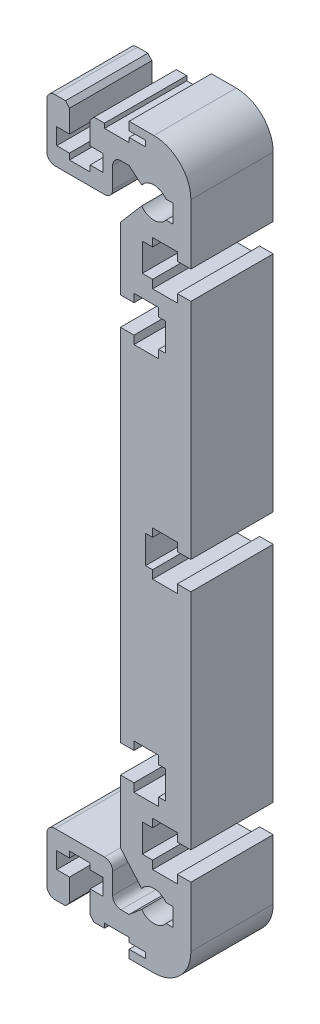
ISO-10303-21;
HEADER;
FILE_DESCRIPTION(('STEP AP214'),'2;1');
FILE_NAME('part.step','',(''),(''),'','','');
FILE_SCHEMA(('AUTOMOTIVE_DESIGN { 1 0 10303 214 1 1 1 1 }'));
ENDSEC;
DATA;
#1=APPLICATION_CONTEXT('core data for automotive mechanical design processes');
#2=APPLICATION_PROTOCOL_DEFINITION('international standard','automotive_design',2000,#1);
#3=PRODUCT_CONTEXT('',#1,'mechanical');
#4=PRODUCT('Part','Part','',(#3));
#5=PRODUCT_RELATED_PRODUCT_CATEGORY('part','',(#4));
#6=PRODUCT_DEFINITION_FORMATION('','',#4);
#7=PRODUCT_DEFINITION_CONTEXT('part definition',#1,'design');
#8=PRODUCT_DEFINITION('design','',#6,#7);
#9=PRODUCT_DEFINITION_SHAPE('','',#8);
#10=(LENGTH_UNIT() NAMED_UNIT(*) SI_UNIT(.MILLI.,.METRE.));
#11=(NAMED_UNIT(*) PLANE_ANGLE_UNIT() SI_UNIT($,.RADIAN.));
#12=(NAMED_UNIT(*) SI_UNIT($,.STERADIAN.) SOLID_ANGLE_UNIT());
#13=UNCERTAINTY_MEASURE_WITH_UNIT(LENGTH_MEASURE(1.E-05),#10,'distance_accuracy_value','');
#14=(GEOMETRIC_REPRESENTATION_CONTEXT(3) GLOBAL_UNCERTAINTY_ASSIGNED_CONTEXT((#13)) GLOBAL_UNIT_ASSIGNED_CONTEXT((#10,
#11,#12)) REPRESENTATION_CONTEXT('',''));
#15=CARTESIAN_POINT('',(0.,0.,0.));
#16=DIRECTION('',(0.,0.,1.));
#17=DIRECTION('',(1.,0.,0.));
#18=AXIS2_PLACEMENT_3D('',#15,#16,#17);
#19=CARTESIAN_POINT('',(4.05794193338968,-39.5500000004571,10.));
#20=DIRECTION('',(0.,0.,-1.));
#21=DIRECTION('',(-1.,0.,0.));
#22=AXIS2_PLACEMENT_3D('',#19,#20,#21);
#23=CYLINDRICAL_SURFACE('',#22,4.50000000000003);
#24=CARTESIAN_POINT('',(4.05794193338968,-39.5500000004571,0.));
#25=DIRECTION('',(0.,0.,1.));
#26=DIRECTION('',(1.,0.,0.));
#27=AXIS2_PLACEMENT_3D('',#24,#25,#26);
#28=CIRCLE('',#27,4.50000000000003);
#29=CARTESIAN_POINT('',(4.05794193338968,-44.0500000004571,0.));
#30=VERTEX_POINT('',#29);
#31=CARTESIAN_POINT('',(8.55794193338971,-39.5500000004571,0.));
#32=VERTEX_POINT('',#31);
#33=EDGE_CURVE('E507',#30,#32,#28,.T.);
#34=ORIENTED_EDGE('',*,*,#33,.T.);
#35=DIRECTION('',(0.,0.,-1.));
#36=VECTOR('',#35,1.);
#37=CARTESIAN_POINT('',(8.55794193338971,-39.5500000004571,10.));
#38=LINE('',#37,#36);
#39=CARTESIAN_POINT('',(8.55794193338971,-39.5500000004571,10.));
#40=VERTEX_POINT('',#39);
#41=EDGE_CURVE('E11',#40,#32,#38,.T.);
#42=ORIENTED_EDGE('',*,*,#41,.F.);
#43=CARTESIAN_POINT('',(4.05794193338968,-39.5500000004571,10.));
#44=DIRECTION('',(0.,0.,1.));
#45=DIRECTION('',(1.,0.,0.));
#46=AXIS2_PLACEMENT_3D('',#43,#44,#45);
#47=CIRCLE('',#46,4.50000000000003);
#48=CARTESIAN_POINT('',(4.05794193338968,-44.0500000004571,10.));
#49=VERTEX_POINT('',#48);
#50=EDGE_CURVE('E649',#49,#40,#47,.T.);
#51=ORIENTED_EDGE('',*,*,#50,.F.);
#52=DIRECTION('',(0.,0.,-1.));
#53=VECTOR('',#52,1.);
#54=CARTESIAN_POINT('',(4.05794193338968,-44.0500000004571,10.));
#55=LINE('',#54,#53);
#56=EDGE_CURVE('E503',#49,#30,#55,.T.);
#57=ORIENTED_EDGE('',*,*,#56,.T.);
#58=EDGE_LOOP('',(#34,#42,#51,#57));
#59=FACE_BOUND('',#58,.T.);
#60=ADVANCED_FACE('F35',(#59),#23,.T.);
#61=CARTESIAN_POINT('',(8.55794193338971,-39.5500000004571,10.));
#62=DIRECTION('',(-1.,0.,0.));
#63=DIRECTION('',(0.,-1.,0.));
#64=AXIS2_PLACEMENT_3D('',#61,#62,#63);
#65=PLANE('',#64);
#66=DIRECTION('',(0.,1.,0.));
#67=VECTOR('',#66,1.);
#68=CARTESIAN_POINT('',(8.55794193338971,-39.5500000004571,0.));
#69=LINE('',#68,#67);
#70=CARTESIAN_POINT('',(8.55794193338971,-32.2500000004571,0.));
#71=VERTEX_POINT('',#70);
#72=EDGE_CURVE('E510',#32,#71,#69,.T.);
#73=ORIENTED_EDGE('',*,*,#72,.T.);
#74=DIRECTION('',(0.,0.,-1.));
#75=VECTOR('',#74,1.);
#76=CARTESIAN_POINT('',(8.55794193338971,-32.2500000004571,10.));
#77=LINE('',#76,#75);
#78=CARTESIAN_POINT('',(8.55794193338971,-32.2500000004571,10.));
#79=VERTEX_POINT('',#78);
#80=EDGE_CURVE('E43',#79,#71,#77,.T.);
#81=ORIENTED_EDGE('',*,*,#80,.F.);
#82=DIRECTION('',(0.,1.,0.));
#83=VECTOR('',#82,1.);
#84=CARTESIAN_POINT('',(8.55794193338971,-39.5500000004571,10.));
#85=LINE('',#84,#83);
#86=EDGE_CURVE('E281',#40,#79,#85,.T.);
#87=ORIENTED_EDGE('',*,*,#86,.F.);
#88=ORIENTED_EDGE('',*,*,#41,.T.);
#89=EDGE_LOOP('',(#73,#81,#87,#88));
#90=FACE_BOUND('',#89,.T.);
#91=ADVANCED_FACE('F1020',(#90),#65,.F.);
#92=CARTESIAN_POINT('',(8.55794193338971,-32.2500000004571,10.));
#93=DIRECTION('',(0.,-1.,0.));
#94=DIRECTION('',(0.,0.,-1.));
#95=AXIS2_PLACEMENT_3D('',#92,#93,#94);
#96=PLANE('',#95);
#97=DIRECTION('',(-1.,0.,0.));
#98=VECTOR('',#97,1.);
#99=CARTESIAN_POINT('',(8.55794193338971,-32.2500000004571,0.));
#100=LINE('',#99,#98);
#101=CARTESIAN_POINT('',(6.90794193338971,-32.2500000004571,0.));
#102=VERTEX_POINT('',#101);
#103=EDGE_CURVE('E513',#71,#102,#100,.T.);
#104=ORIENTED_EDGE('',*,*,#103,.T.);
#105=DIRECTION('',(0.,0.,-1.));
#106=VECTOR('',#105,1.);
#107=CARTESIAN_POINT('',(6.90794193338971,-32.2500000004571,10.));
#108=LINE('',#107,#106);
#109=CARTESIAN_POINT('',(6.90794193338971,-32.2500000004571,10.));
#110=VERTEX_POINT('',#109);
#111=EDGE_CURVE('E842',#110,#102,#108,.T.);
#112=ORIENTED_EDGE('',*,*,#111,.F.);
#113=DIRECTION('',(-1.,0.,0.));
#114=VECTOR('',#113,1.);
#115=CARTESIAN_POINT('',(8.55794193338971,-32.2500000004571,10.));
#116=LINE('',#115,#114);
#117=EDGE_CURVE('E850',#79,#110,#116,.T.);
#118=ORIENTED_EDGE('',*,*,#117,.F.);
#119=ORIENTED_EDGE('',*,*,#80,.T.);
#120=EDGE_LOOP('',(#104,#112,#118,#119));
#121=FACE_BOUND('',#120,.T.);
#122=ADVANCED_FACE('F848',(#121),#96,.F.);
#123=CARTESIAN_POINT('',(6.90794193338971,-33.2500000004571,10.));
#124=DIRECTION('',(1.,0.,0.));
#125=DIRECTION('',(0.,1.,0.));
#126=AXIS2_PLACEMENT_3D('',#123,#124,#125);
#127=PLANE('',#126);
#128=DIRECTION('',(0.,-1.,0.));
#129=VECTOR('',#128,1.);
#130=CARTESIAN_POINT('',(6.90794193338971,-33.2500000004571,0.));
#131=LINE('',#130,#129);
#132=CARTESIAN_POINT('',(6.90794193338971,-33.2500000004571,0.));
#133=VERTEX_POINT('',#132);
#134=EDGE_CURVE('E515',#102,#133,#131,.T.);
#135=ORIENTED_EDGE('',*,*,#134,.T.);
#136=DIRECTION('',(0.,0.,-1.));
#137=VECTOR('',#136,1.);
#138=CARTESIAN_POINT('',(6.90794193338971,-33.2500000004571,10.));
#139=LINE('',#138,#137);
#140=CARTESIAN_POINT('',(6.90794193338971,-33.2500000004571,10.));
#141=VERTEX_POINT('',#140);
#142=EDGE_CURVE('E839',#141,#133,#139,.T.);
#143=ORIENTED_EDGE('',*,*,#142,.F.);
#144=DIRECTION('',(0.,-1.,0.));
#145=VECTOR('',#144,1.);
#146=CARTESIAN_POINT('',(6.90794193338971,-33.2500000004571,10.));
#147=LINE('',#146,#145);
#148=EDGE_CURVE('E868',#110,#141,#147,.T.);
#149=ORIENTED_EDGE('',*,*,#148,.F.);
#150=ORIENTED_EDGE('',*,*,#111,.T.);
#151=EDGE_LOOP('',(#135,#143,#149,#150));
#152=FACE_BOUND('',#151,.T.);
#153=ADVANCED_FACE('F859',(#152),#127,.F.);
#154=CARTESIAN_POINT('',(6.90794193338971,-33.2500000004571,10.));
#155=DIRECTION('',(0.,-1.,0.));
#156=DIRECTION('',(0.,0.,-1.));
#157=AXIS2_PLACEMENT_3D('',#154,#155,#156);
#158=PLANE('',#157);
#159=DIRECTION('',(-1.,0.,0.));
#160=VECTOR('',#159,1.);
#161=CARTESIAN_POINT('',(6.90794193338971,-33.2500000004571,0.));
#162=LINE('',#161,#160);
#163=CARTESIAN_POINT('',(3.90794193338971,-33.2500000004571,0.));
#164=VERTEX_POINT('',#163);
#165=EDGE_CURVE('E517',#133,#164,#162,.T.);
#166=ORIENTED_EDGE('',*,*,#165,.T.);
#167=DIRECTION('',(0.,0.,-1.));
#168=VECTOR('',#167,1.);
#169=CARTESIAN_POINT('',(3.90794193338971,-33.2500000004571,10.));
#170=LINE('',#169,#168);
#171=CARTESIAN_POINT('',(3.90794193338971,-33.2500000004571,10.));
#172=VERTEX_POINT('',#171);
#173=EDGE_CURVE('E836',#172,#164,#170,.T.);
#174=ORIENTED_EDGE('',*,*,#173,.F.);
#175=DIRECTION('',(-1.,0.,0.));
#176=VECTOR('',#175,1.);
#177=CARTESIAN_POINT('',(6.90794193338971,-33.2500000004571,10.));
#178=LINE('',#177,#176);
#179=EDGE_CURVE('E865',#141,#172,#178,.T.);
#180=ORIENTED_EDGE('',*,*,#179,.F.);
#181=ORIENTED_EDGE('',*,*,#142,.T.);
#182=EDGE_LOOP('',(#166,#174,#180,#181));
#183=FACE_BOUND('',#182,.T.);
#184=ADVANCED_FACE('F863',(#183),#158,.F.);
#185=CARTESIAN_POINT('',(3.90794193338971,-33.2500000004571,10.));
#186=DIRECTION('',(-1.,0.,0.));
#187=DIRECTION('',(0.,-1.,0.));
#188=AXIS2_PLACEMENT_3D('',#185,#186,#187);
#189=PLANE('',#188);
#190=DIRECTION('',(0.,1.,0.));
#191=VECTOR('',#190,1.);
#192=CARTESIAN_POINT('',(3.90794193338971,-33.2500000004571,0.));
#193=LINE('',#192,#191);
#194=CARTESIAN_POINT('',(3.90794193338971,-32.2500000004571,0.));
#195=VERTEX_POINT('',#194);
#196=EDGE_CURVE('E519',#164,#195,#193,.T.);
#197=ORIENTED_EDGE('',*,*,#196,.T.);
#198=DIRECTION('',(0.,0.,-1.));
#199=VECTOR('',#198,1.);
#200=CARTESIAN_POINT('',(3.90794193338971,-32.2500000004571,10.));
#201=LINE('',#200,#199);
#202=CARTESIAN_POINT('',(3.90794193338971,-32.2500000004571,10.));
#203=VERTEX_POINT('',#202);
#204=EDGE_CURVE('E833',#203,#195,#201,.T.);
#205=ORIENTED_EDGE('',*,*,#204,.F.);
#206=DIRECTION('',(0.,1.,0.));
#207=VECTOR('',#206,1.);
#208=CARTESIAN_POINT('',(3.90794193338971,-33.2500000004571,10.));
#209=LINE('',#208,#207);
#210=EDGE_CURVE('E867',#172,#203,#209,.T.);
#211=ORIENTED_EDGE('',*,*,#210,.F.);
#212=ORIENTED_EDGE('',*,*,#173,.T.);
#213=EDGE_LOOP('',(#197,#205,#211,#212));
#214=FACE_BOUND('',#213,.T.);
#215=ADVANCED_FACE('F1033',(#214),#189,.F.);
#216=CARTESIAN_POINT('',(2.65794193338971,-32.2500000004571,10.));
#217=DIRECTION('',(0.,-1.,0.));
#218=DIRECTION('',(0.,0.,-1.));
#219=AXIS2_PLACEMENT_3D('',#216,#217,#218);
#220=PLANE('',#219);
#221=DIRECTION('',(-1.,0.,0.));
#222=VECTOR('',#221,1.);
#223=CARTESIAN_POINT('',(2.65794193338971,-32.2500000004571,0.));
#224=LINE('',#223,#222);
#225=CARTESIAN_POINT('',(2.65794193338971,-32.2500000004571,0.));
#226=VERTEX_POINT('',#225);
#227=EDGE_CURVE('E521',#195,#226,#224,.T.);
#228=ORIENTED_EDGE('',*,*,#227,.T.);
#229=DIRECTION('',(0.,0.,-1.));
#230=VECTOR('',#229,1.);
#231=CARTESIAN_POINT('',(2.65794193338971,-32.2500000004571,10.));
#232=LINE('',#231,#230);
#233=CARTESIAN_POINT('',(2.65794193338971,-32.2500000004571,10.));
#234=VERTEX_POINT('',#233);
#235=EDGE_CURVE('E830',#234,#226,#232,.T.);
#236=ORIENTED_EDGE('',*,*,#235,.F.);
#237=DIRECTION('',(-1.,0.,0.));
#238=VECTOR('',#237,1.);
#239=CARTESIAN_POINT('',(2.65794193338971,-32.2500000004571,10.));
#240=LINE('',#239,#238);
#241=EDGE_CURVE('E870',#203,#234,#240,.T.);
#242=ORIENTED_EDGE('',*,*,#241,.F.);
#243=ORIENTED_EDGE('',*,*,#204,.T.);
#244=EDGE_LOOP('',(#228,#236,#242,#243));
#245=FACE_BOUND('',#244,.T.);
#246=ADVANCED_FACE('F1036',(#245),#220,.F.);
#247=CARTESIAN_POINT('',(2.65794193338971,-32.2500000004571,10.));
#248=DIRECTION('',(-1.,0.,0.));
#249=DIRECTION('',(0.,0.,1.));
#250=AXIS2_PLACEMENT_3D('',#247,#248,#249);
#251=PLANE('',#250);
#252=DIRECTION('',(0.,1.,0.));
#253=VECTOR('',#252,1.);
#254=CARTESIAN_POINT('',(2.65794193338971,-32.2500000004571,0.));
#255=LINE('',#254,#253);
#256=CARTESIAN_POINT('',(2.65794193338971,-28.8500000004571,0.));
#257=VERTEX_POINT('',#256);
#258=EDGE_CURVE('E523',#226,#257,#255,.T.);
#259=ORIENTED_EDGE('',*,*,#258,.T.);
#260=DIRECTION('',(0.,0.,-1.));
#261=VECTOR('',#260,1.);
#262=CARTESIAN_POINT('',(2.65794193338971,-28.8500000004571,10.));
#263=LINE('',#262,#261);
#264=CARTESIAN_POINT('',(2.65794193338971,-28.8500000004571,10.));
#265=VERTEX_POINT('',#264);
#266=EDGE_CURVE('E827',#265,#257,#263,.T.);
#267=ORIENTED_EDGE('',*,*,#266,.F.);
#268=DIRECTION('',(0.,1.,0.));
#269=VECTOR('',#268,1.);
#270=CARTESIAN_POINT('',(2.65794193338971,-32.2500000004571,10.));
#271=LINE('',#270,#269);
#272=EDGE_CURVE('E876',#234,#265,#271,.T.);
#273=ORIENTED_EDGE('',*,*,#272,.F.);
#274=ORIENTED_EDGE('',*,*,#235,.T.);
#275=EDGE_LOOP('',(#259,#267,#273,#274));
#276=FACE_BOUND('',#275,.T.);
#277=ADVANCED_FACE('F1040',(#276),#251,.F.);
#278=CARTESIAN_POINT('',(2.65794193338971,-28.8500000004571,10.));
#279=DIRECTION('',(0.,1.,0.));
#280=DIRECTION('',(0.,0.,1.));
#281=AXIS2_PLACEMENT_3D('',#278,#279,#280);
#282=PLANE('',#281);
#283=DIRECTION('',(1.,0.,0.));
#284=VECTOR('',#283,1.);
#285=CARTESIAN_POINT('',(2.65794193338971,-28.8500000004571,0.));
#286=LINE('',#285,#284);
#287=CARTESIAN_POINT('',(3.90794193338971,-28.8500000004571,0.));
#288=VERTEX_POINT('',#287);
#289=EDGE_CURVE('E525',#257,#288,#286,.T.);
#290=ORIENTED_EDGE('',*,*,#289,.T.);
#291=DIRECTION('',(0.,0.,-1.));
#292=VECTOR('',#291,1.);
#293=CARTESIAN_POINT('',(3.90794193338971,-28.8500000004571,10.));
#294=LINE('',#293,#292);
#295=CARTESIAN_POINT('',(3.90794193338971,-28.8500000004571,10.));
#296=VERTEX_POINT('',#295);
#297=EDGE_CURVE('E824',#296,#288,#294,.T.);
#298=ORIENTED_EDGE('',*,*,#297,.F.);
#299=DIRECTION('',(1.,0.,0.));
#300=VECTOR('',#299,1.);
#301=CARTESIAN_POINT('',(2.65794193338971,-28.8500000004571,10.));
#302=LINE('',#301,#300);
#303=EDGE_CURVE('E878',#265,#296,#302,.T.);
#304=ORIENTED_EDGE('',*,*,#303,.F.);
#305=ORIENTED_EDGE('',*,*,#266,.T.);
#306=EDGE_LOOP('',(#290,#298,#304,#305));
#307=FACE_BOUND('',#306,.T.);
#308=ADVANCED_FACE('F1044',(#307),#282,.F.);
#309=CARTESIAN_POINT('',(3.90794193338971,-28.8500000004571,10.));
#310=DIRECTION('',(-1.,0.,0.));
#311=DIRECTION('',(0.,-1.,0.));
#312=AXIS2_PLACEMENT_3D('',#309,#310,#311);
#313=PLANE('',#312);
#314=DIRECTION('',(0.,1.,0.));
#315=VECTOR('',#314,1.);
#316=CARTESIAN_POINT('',(3.90794193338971,-28.8500000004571,0.));
#317=LINE('',#316,#315);
#318=CARTESIAN_POINT('',(3.90794193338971,-27.8500000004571,0.));
#319=VERTEX_POINT('',#318);
#320=EDGE_CURVE('E527',#288,#319,#317,.T.);
#321=ORIENTED_EDGE('',*,*,#320,.T.);
#322=DIRECTION('',(0.,0.,-1.));
#323=VECTOR('',#322,1.);
#324=CARTESIAN_POINT('',(3.90794193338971,-27.8500000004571,10.));
#325=LINE('',#324,#323);
#326=CARTESIAN_POINT('',(3.90794193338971,-27.8500000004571,10.));
#327=VERTEX_POINT('',#326);
#328=EDGE_CURVE('E821',#327,#319,#325,.T.);
#329=ORIENTED_EDGE('',*,*,#328,.F.);
#330=DIRECTION('',(0.,1.,0.));
#331=VECTOR('',#330,1.);
#332=CARTESIAN_POINT('',(3.90794193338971,-28.8500000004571,10.));
#333=LINE('',#332,#331);
#334=EDGE_CURVE('E880',#296,#327,#333,.T.);
#335=ORIENTED_EDGE('',*,*,#334,.F.);
#336=ORIENTED_EDGE('',*,*,#297,.T.);
#337=EDGE_LOOP('',(#321,#329,#335,#336));
#338=FACE_BOUND('',#337,.T.);
#339=ADVANCED_FACE('F1048',(#338),#313,.F.);
#340=CARTESIAN_POINT('',(6.90794193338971,-27.8500000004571,10.));
#341=DIRECTION('',(0.,1.,0.));
#342=DIRECTION('',(0.,0.,1.));
#343=AXIS2_PLACEMENT_3D('',#340,#341,#342);
#344=PLANE('',#343);
#345=DIRECTION('',(1.,0.,0.));
#346=VECTOR('',#345,1.);
#347=CARTESIAN_POINT('',(6.90794193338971,-27.8500000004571,0.));
#348=LINE('',#347,#346);
#349=CARTESIAN_POINT('',(6.90794193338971,-27.8500000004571,0.));
#350=VERTEX_POINT('',#349);
#351=EDGE_CURVE('E529',#319,#350,#348,.T.);
#352=ORIENTED_EDGE('',*,*,#351,.T.);
#353=DIRECTION('',(0.,0.,-1.));
#354=VECTOR('',#353,1.);
#355=CARTESIAN_POINT('',(6.90794193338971,-27.8500000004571,10.));
#356=LINE('',#355,#354);
#357=CARTESIAN_POINT('',(6.90794193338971,-27.8500000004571,10.));
#358=VERTEX_POINT('',#357);
#359=EDGE_CURVE('E818',#358,#350,#356,.T.);
#360=ORIENTED_EDGE('',*,*,#359,.F.);
#361=DIRECTION('',(1.,0.,0.));
#362=VECTOR('',#361,1.);
#363=CARTESIAN_POINT('',(6.90794193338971,-27.8500000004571,10.));
#364=LINE('',#363,#362);
#365=EDGE_CURVE('E882',#327,#358,#364,.T.);
#366=ORIENTED_EDGE('',*,*,#365,.F.);
#367=ORIENTED_EDGE('',*,*,#328,.T.);
#368=EDGE_LOOP('',(#352,#360,#366,#367));
#369=FACE_BOUND('',#368,.T.);
#370=ADVANCED_FACE('F1052',(#369),#344,.F.);
#371=CARTESIAN_POINT('',(6.90794193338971,-28.8500000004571,10.));
#372=DIRECTION('',(1.,0.,0.));
#373=DIRECTION('',(0.,1.,0.));
#374=AXIS2_PLACEMENT_3D('',#371,#372,#373);
#375=PLANE('',#374);
#376=DIRECTION('',(0.,-1.,0.));
#377=VECTOR('',#376,1.);
#378=CARTESIAN_POINT('',(6.90794193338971,-28.8500000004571,0.));
#379=LINE('',#378,#377);
#380=CARTESIAN_POINT('',(6.90794193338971,-28.8500000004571,0.));
#381=VERTEX_POINT('',#380);
#382=EDGE_CURVE('E531',#350,#381,#379,.T.);
#383=ORIENTED_EDGE('',*,*,#382,.T.);
#384=DIRECTION('',(0.,0.,-1.));
#385=VECTOR('',#384,1.);
#386=CARTESIAN_POINT('',(6.90794193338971,-28.8500000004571,10.));
#387=LINE('',#386,#385);
#388=CARTESIAN_POINT('',(6.90794193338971,-28.8500000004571,10.));
#389=VERTEX_POINT('',#388);
#390=EDGE_CURVE('E815',#389,#381,#387,.T.);
#391=ORIENTED_EDGE('',*,*,#390,.F.);
#392=DIRECTION('',(0.,-1.,0.));
#393=VECTOR('',#392,1.);
#394=CARTESIAN_POINT('',(6.90794193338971,-28.8500000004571,10.));
#395=LINE('',#394,#393);
#396=EDGE_CURVE('E884',#358,#389,#395,.T.);
#397=ORIENTED_EDGE('',*,*,#396,.F.);
#398=ORIENTED_EDGE('',*,*,#359,.T.);
#399=EDGE_LOOP('',(#383,#391,#397,#398));
#400=FACE_BOUND('',#399,.T.);
#401=ADVANCED_FACE('F1056',(#400),#375,.F.);
#402=CARTESIAN_POINT('',(8.55794193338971,-28.8500000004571,10.));
#403=DIRECTION('',(0.,1.,0.));
#404=DIRECTION('',(0.,0.,1.));
#405=AXIS2_PLACEMENT_3D('',#402,#403,#404);
#406=PLANE('',#405);
#407=DIRECTION('',(1.,0.,0.));
#408=VECTOR('',#407,1.);
#409=CARTESIAN_POINT('',(8.55794193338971,-28.8500000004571,0.));
#410=LINE('',#409,#408);
#411=CARTESIAN_POINT('',(8.55794193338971,-28.8500000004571,0.));
#412=VERTEX_POINT('',#411);
#413=EDGE_CURVE('E533',#381,#412,#410,.T.);
#414=ORIENTED_EDGE('',*,*,#413,.T.);
#415=DIRECTION('',(0.,0.,-1.));
#416=VECTOR('',#415,1.);
#417=CARTESIAN_POINT('',(8.55794193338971,-28.8500000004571,10.));
#418=LINE('',#417,#416);
#419=CARTESIAN_POINT('',(8.55794193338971,-28.8500000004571,10.));
#420=VERTEX_POINT('',#419);
#421=EDGE_CURVE('E812',#420,#412,#418,.T.);
#422=ORIENTED_EDGE('',*,*,#421,.F.);
#423=DIRECTION('',(1.,0.,0.));
#424=VECTOR('',#423,1.);
#425=CARTESIAN_POINT('',(8.55794193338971,-28.8500000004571,10.));
#426=LINE('',#425,#424);
#427=EDGE_CURVE('E886',#389,#420,#426,.T.);
#428=ORIENTED_EDGE('',*,*,#427,.F.);
#429=ORIENTED_EDGE('',*,*,#390,.T.);
#430=EDGE_LOOP('',(#414,#422,#428,#429));
#431=FACE_BOUND('',#430,.T.);
#432=ADVANCED_FACE('F1060',(#431),#406,.F.);
#433=CARTESIAN_POINT('',(8.55794193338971,-28.8500000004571,10.));
#434=DIRECTION('',(-1.,0.,0.));
#435=DIRECTION('',(0.,0.,1.));
#436=AXIS2_PLACEMENT_3D('',#433,#434,#435);
#437=PLANE('',#436);
#438=DIRECTION('',(0.,1.,0.));
#439=VECTOR('',#438,1.);
#440=CARTESIAN_POINT('',(8.55794193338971,-28.8500000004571,0.));
#441=LINE('',#440,#439);
#442=CARTESIAN_POINT('',(8.55794193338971,-1.69999999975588,0.));
#443=VERTEX_POINT('',#442);
#444=EDGE_CURVE('E535',#412,#443,#441,.T.);
#445=ORIENTED_EDGE('',*,*,#444,.T.);
#446=DIRECTION('',(0.,0.,-1.));
#447=VECTOR('',#446,1.);
#448=CARTESIAN_POINT('',(8.55794193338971,-1.69999999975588,10.));
#449=LINE('',#448,#447);
#450=CARTESIAN_POINT('',(8.55794193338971,-1.69999999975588,10.));
#451=VERTEX_POINT('',#450);
#452=EDGE_CURVE('E809',#451,#443,#449,.T.);
#453=ORIENTED_EDGE('',*,*,#452,.F.);
#454=DIRECTION('',(0.,1.,0.));
#455=VECTOR('',#454,1.);
#456=CARTESIAN_POINT('',(8.55794193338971,-28.8500000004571,10.));
#457=LINE('',#456,#455);
#458=EDGE_CURVE('E888',#420,#451,#457,.T.);
#459=ORIENTED_EDGE('',*,*,#458,.F.);
#460=ORIENTED_EDGE('',*,*,#421,.T.);
#461=EDGE_LOOP('',(#445,#453,#459,#460));
#462=FACE_BOUND('',#461,.T.);
#463=ADVANCED_FACE('F1064',(#462),#437,.F.);
#464=CARTESIAN_POINT('',(6.90794192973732,-1.69999999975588,10.));
#465=DIRECTION('',(0.,-1.,0.));
#466=DIRECTION('',(0.,0.,-1.));
#467=AXIS2_PLACEMENT_3D('',#464,#465,#466);
#468=PLANE('',#467);
#469=DIRECTION('',(-1.,0.,0.));
#470=VECTOR('',#469,1.);
#471=CARTESIAN_POINT('',(6.90794192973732,-1.69999999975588,0.));
#472=LINE('',#471,#470);
#473=CARTESIAN_POINT('',(6.90794192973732,-1.69999999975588,0.));
#474=VERTEX_POINT('',#473);
#475=EDGE_CURVE('E537',#443,#474,#472,.T.);
#476=ORIENTED_EDGE('',*,*,#475,.T.);
#477=DIRECTION('',(0.,0.,-1.));
#478=VECTOR('',#477,1.);
#479=CARTESIAN_POINT('',(6.90794192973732,-1.69999999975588,10.));
#480=LINE('',#479,#478);
#481=CARTESIAN_POINT('',(6.90794192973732,-1.69999999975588,10.));
#482=VERTEX_POINT('',#481);
#483=EDGE_CURVE('E806',#482,#474,#480,.T.);
#484=ORIENTED_EDGE('',*,*,#483,.F.);
#485=DIRECTION('',(-1.,0.,0.));
#486=VECTOR('',#485,1.);
#487=CARTESIAN_POINT('',(6.90794192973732,-1.69999999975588,10.));
#488=LINE('',#487,#486);
#489=EDGE_CURVE('E890',#451,#482,#488,.T.);
#490=ORIENTED_EDGE('',*,*,#489,.F.);
#491=ORIENTED_EDGE('',*,*,#452,.T.);
#492=EDGE_LOOP('',(#476,#484,#490,#491));
#493=FACE_BOUND('',#492,.T.);
#494=ADVANCED_FACE('F1068',(#493),#468,.F.);
#495=CARTESIAN_POINT('',(6.90794192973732,-2.69999999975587,10.));
#496=DIRECTION('',(1.,0.,0.));
#497=DIRECTION('',(0.,0.,-1.));
#498=AXIS2_PLACEMENT_3D('',#495,#496,#497);
#499=PLANE('',#498);
#500=DIRECTION('',(0.,-1.,0.));
#501=VECTOR('',#500,1.);
#502=CARTESIAN_POINT('',(6.90794192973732,-2.69999999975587,0.));
#503=LINE('',#502,#501);
#504=CARTESIAN_POINT('',(6.90794192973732,-2.69999999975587,0.));
#505=VERTEX_POINT('',#504);
#506=EDGE_CURVE('E539',#474,#505,#503,.T.);
#507=ORIENTED_EDGE('',*,*,#506,.T.);
#508=DIRECTION('',(0.,0.,-1.));
#509=VECTOR('',#508,1.);
#510=CARTESIAN_POINT('',(6.90794192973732,-2.69999999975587,10.));
#511=LINE('',#510,#509);
#512=CARTESIAN_POINT('',(6.90794192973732,-2.69999999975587,10.));
#513=VERTEX_POINT('',#512);
#514=EDGE_CURVE('E803',#513,#505,#511,.T.);
#515=ORIENTED_EDGE('',*,*,#514,.F.);
#516=DIRECTION('',(0.,-1.,0.));
#517=VECTOR('',#516,1.);
#518=CARTESIAN_POINT('',(6.90794192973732,-2.69999999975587,10.));
#519=LINE('',#518,#517);
#520=EDGE_CURVE('E892',#482,#513,#519,.T.);
#521=ORIENTED_EDGE('',*,*,#520,.F.);
#522=ORIENTED_EDGE('',*,*,#483,.T.);
#523=EDGE_LOOP('',(#507,#515,#521,#522));
#524=FACE_BOUND('',#523,.T.);
#525=ADVANCED_FACE('F1072',(#524),#499,.F.);
#526=CARTESIAN_POINT('',(3.90794192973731,-2.69999999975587,10.));
#527=DIRECTION('',(0.,-1.,0.));
#528=DIRECTION('',(1.,0.,0.));
#529=AXIS2_PLACEMENT_3D('',#526,#527,#528);
#530=PLANE('',#529);
#531=DIRECTION('',(-1.,0.,0.));
#532=VECTOR('',#531,1.);
#533=CARTESIAN_POINT('',(3.90794192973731,-2.69999999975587,0.));
#534=LINE('',#533,#532);
#535=CARTESIAN_POINT('',(3.90794192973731,-2.69999999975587,0.));
#536=VERTEX_POINT('',#535);
#537=EDGE_CURVE('E541',#505,#536,#534,.T.);
#538=ORIENTED_EDGE('',*,*,#537,.T.);
#539=DIRECTION('',(0.,0.,-1.));
#540=VECTOR('',#539,1.);
#541=CARTESIAN_POINT('',(3.90794192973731,-2.69999999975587,10.));
#542=LINE('',#541,#540);
#543=CARTESIAN_POINT('',(3.90794192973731,-2.69999999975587,10.));
#544=VERTEX_POINT('',#543);
#545=EDGE_CURVE('E800',#544,#536,#542,.T.);
#546=ORIENTED_EDGE('',*,*,#545,.F.);
#547=DIRECTION('',(-1.,0.,0.));
#548=VECTOR('',#547,1.);
#549=CARTESIAN_POINT('',(3.90794192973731,-2.69999999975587,10.));
#550=LINE('',#549,#548);
#551=EDGE_CURVE('E894',#513,#544,#550,.T.);
#552=ORIENTED_EDGE('',*,*,#551,.F.);
#553=ORIENTED_EDGE('',*,*,#514,.T.);
#554=EDGE_LOOP('',(#538,#546,#552,#553));
#555=FACE_BOUND('',#554,.T.);
#556=ADVANCED_FACE('F1076',(#555),#530,.F.);
#557=CARTESIAN_POINT('',(3.90794192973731,-2.69999999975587,10.));
#558=DIRECTION('',(-1.,0.,0.));
#559=DIRECTION('',(0.,0.,1.));
#560=AXIS2_PLACEMENT_3D('',#557,#558,#559);
#561=PLANE('',#560);
#562=DIRECTION('',(0.,1.,0.));
#563=VECTOR('',#562,1.);
#564=CARTESIAN_POINT('',(3.90794192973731,-2.69999999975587,0.));
#565=LINE('',#564,#563);
#566=CARTESIAN_POINT('',(3.90794192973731,-1.69999999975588,0.));
#567=VERTEX_POINT('',#566);
#568=EDGE_CURVE('E543',#536,#567,#565,.T.);
#569=ORIENTED_EDGE('',*,*,#568,.T.);
#570=DIRECTION('',(0.,0.,-1.));
#571=VECTOR('',#570,1.);
#572=CARTESIAN_POINT('',(3.90794192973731,-1.69999999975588,10.));
#573=LINE('',#572,#571);
#574=CARTESIAN_POINT('',(3.90794192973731,-1.69999999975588,10.));
#575=VERTEX_POINT('',#574);
#576=EDGE_CURVE('E797',#575,#567,#573,.T.);
#577=ORIENTED_EDGE('',*,*,#576,.F.);
#578=DIRECTION('',(0.,1.,0.));
#579=VECTOR('',#578,1.);
#580=CARTESIAN_POINT('',(3.90794192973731,-2.69999999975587,10.));
#581=LINE('',#580,#579);
#582=EDGE_CURVE('E896',#544,#575,#581,.T.);
#583=ORIENTED_EDGE('',*,*,#582,.F.);
#584=ORIENTED_EDGE('',*,*,#545,.T.);
#585=EDGE_LOOP('',(#569,#577,#583,#584));
#586=FACE_BOUND('',#585,.T.);
#587=ADVANCED_FACE('F1080',(#586),#561,.F.);
#588=CARTESIAN_POINT('',(3.05794193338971,-1.69999999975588,10.));
#589=DIRECTION('',(0.,-1.,0.));
#590=DIRECTION('',(0.,0.,-1.));
#591=AXIS2_PLACEMENT_3D('',#588,#589,#590);
#592=PLANE('',#591);
#593=DIRECTION('',(-1.,0.,0.));
#594=VECTOR('',#593,1.);
#595=CARTESIAN_POINT('',(3.05794193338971,-1.69999999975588,0.));
#596=LINE('',#595,#594);
#597=CARTESIAN_POINT('',(3.05794193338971,-1.69999999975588,0.));
#598=VERTEX_POINT('',#597);
#599=EDGE_CURVE('E545',#567,#598,#596,.T.);
#600=ORIENTED_EDGE('',*,*,#599,.T.);
#601=DIRECTION('',(0.,0.,-1.));
#602=VECTOR('',#601,1.);
#603=CARTESIAN_POINT('',(3.05794193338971,-1.69999999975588,10.));
#604=LINE('',#603,#602);
#605=CARTESIAN_POINT('',(3.05794193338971,-1.69999999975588,10.));
#606=VERTEX_POINT('',#605);
#607=EDGE_CURVE('E794',#606,#598,#604,.T.);
#608=ORIENTED_EDGE('',*,*,#607,.F.);
#609=DIRECTION('',(-1.,0.,0.));
#610=VECTOR('',#609,1.);
#611=CARTESIAN_POINT('',(3.05794193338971,-1.69999999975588,10.));
#612=LINE('',#611,#610);
#613=EDGE_CURVE('E898',#575,#606,#612,.T.);
#614=ORIENTED_EDGE('',*,*,#613,.F.);
#615=ORIENTED_EDGE('',*,*,#576,.T.);
#616=EDGE_LOOP('',(#600,#608,#614,#615));
#617=FACE_BOUND('',#616,.T.);
#618=ADVANCED_FACE('F1084',(#617),#592,.F.);
#619=CARTESIAN_POINT('',(3.05794193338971,-1.69999999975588,10.));
#620=DIRECTION('',(-1.,0.,0.));
#621=DIRECTION('',(0.,0.,1.));
#622=AXIS2_PLACEMENT_3D('',#619,#620,#621);
#623=PLANE('',#622);
#624=DIRECTION('',(0.,1.,0.));
#625=VECTOR('',#624,1.);
#626=CARTESIAN_POINT('',(3.05794193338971,-1.69999999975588,0.));
#627=LINE('',#626,#625);
#628=CARTESIAN_POINT('',(3.05794193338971,1.69999999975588,0.));
#629=VERTEX_POINT('',#628);
#630=EDGE_CURVE('E547',#598,#629,#627,.T.);
#631=ORIENTED_EDGE('',*,*,#630,.T.);
#632=DIRECTION('',(0.,0.,-1.));
#633=VECTOR('',#632,1.);
#634=CARTESIAN_POINT('',(3.05794193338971,1.69999999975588,10.));
#635=LINE('',#634,#633);
#636=CARTESIAN_POINT('',(3.05794193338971,1.69999999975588,10.));
#637=VERTEX_POINT('',#636);
#638=EDGE_CURVE('E2595',#637,#629,#635,.T.);
#639=ORIENTED_EDGE('',*,*,#638,.F.);
#640=DIRECTION('',(0.,1.,0.));
#641=VECTOR('',#640,1.);
#642=CARTESIAN_POINT('',(3.05794193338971,-1.69999999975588,10.));
#643=LINE('',#642,#641);
#644=EDGE_CURVE('E900',#606,#637,#643,.T.);
#645=ORIENTED_EDGE('',*,*,#644,.F.);
#646=ORIENTED_EDGE('',*,*,#607,.T.);
#647=EDGE_LOOP('',(#631,#639,#645,#646));
#648=FACE_BOUND('',#647,.T.);
#649=ADVANCED_FACE('F1088',(#648),#623,.F.);
#650=CARTESIAN_POINT('',(0.,-21.8500000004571,10.));
#651=DIRECTION('',(1.,0.,0.));
#652=DIRECTION('',(0.,0.,-1.));
#653=AXIS2_PLACEMENT_3D('',#650,#651,#652);
#654=PLANE('',#653);
#655=DIRECTION('',(0.,-1.,0.));
#656=VECTOR('',#655,1.);
#657=CARTESIAN_POINT('',(0.,-21.8500000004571,0.));
#658=LINE('',#657,#656);
#659=CARTESIAN_POINT('',(0.,21.8500000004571,0.));
#660=VERTEX_POINT('',#659);
#661=CARTESIAN_POINT('',(0.,-21.8500000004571,0.));
#662=VERTEX_POINT('',#661);
#663=EDGE_CURVE('E550',#660,#662,#658,.T.);
#664=ORIENTED_EDGE('',*,*,#663,.T.);
#665=DIRECTION('',(0.,0.,-1.));
#666=VECTOR('',#665,1.);
#667=CARTESIAN_POINT('',(0.,-21.8500000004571,10.));
#668=LINE('',#667,#666);
#669=CARTESIAN_POINT('',(0.,-21.8500000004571,10.));
#670=VERTEX_POINT('',#669);
#671=EDGE_CURVE('E791',#670,#662,#668,.T.);
#672=ORIENTED_EDGE('',*,*,#671,.F.);
#673=DIRECTION('',(0.,-1.,0.));
#674=VECTOR('',#673,1.);
#675=CARTESIAN_POINT('',(0.,-21.8500000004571,10.));
#676=LINE('',#675,#674);
#677=CARTESIAN_POINT('',(0.,21.8500000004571,10.));
#678=VERTEX_POINT('',#677);
#679=EDGE_CURVE('E903',#678,#670,#676,.T.);
#680=ORIENTED_EDGE('',*,*,#679,.F.);
#681=DIRECTION('',(0.,0.,-1.));
#682=VECTOR('',#681,1.);
#683=CARTESIAN_POINT('',(0.,21.8500000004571,10.));
#684=LINE('',#683,#682);
#685=EDGE_CURVE('E2592',#678,#660,#684,.T.);
#686=ORIENTED_EDGE('',*,*,#685,.T.);
#687=EDGE_LOOP('',(#664,#672,#680,#686));
#688=FACE_BOUND('',#687,.T.);
#689=ADVANCED_FACE('F1092',(#688),#654,.F.);
#690=CARTESIAN_POINT('',(0.,-21.8500000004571,10.));
#691=DIRECTION('',(0.,1.,0.));
#692=DIRECTION('',(0.,0.,1.));
#693=AXIS2_PLACEMENT_3D('',#690,#691,#692);
#694=PLANE('',#693);
#695=DIRECTION('',(1.,0.,0.));
#696=VECTOR('',#695,1.);
#697=CARTESIAN_POINT('',(0.,-21.8500000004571,0.));
#698=LINE('',#697,#696);
#699=CARTESIAN_POINT('',(1.64794193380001,-21.8500000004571,0.));
#700=VERTEX_POINT('',#699);
#701=EDGE_CURVE('E552',#662,#700,#698,.T.);
#702=ORIENTED_EDGE('',*,*,#701,.T.);
#703=DIRECTION('',(0.,0.,-1.));
#704=VECTOR('',#703,1.);
#705=CARTESIAN_POINT('',(1.64794193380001,-21.8500000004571,10.));
#706=LINE('',#705,#704);
#707=CARTESIAN_POINT('',(1.64794193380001,-21.8500000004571,10.));
#708=VERTEX_POINT('',#707);
#709=EDGE_CURVE('E788',#708,#700,#706,.T.);
#710=ORIENTED_EDGE('',*,*,#709,.F.);
#711=DIRECTION('',(1.,0.,0.));
#712=VECTOR('',#711,1.);
#713=CARTESIAN_POINT('',(0.,-21.8500000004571,10.));
#714=LINE('',#713,#712);
#715=EDGE_CURVE('E905',#670,#708,#714,.T.);
#716=ORIENTED_EDGE('',*,*,#715,.F.);
#717=ORIENTED_EDGE('',*,*,#671,.T.);
#718=EDGE_LOOP('',(#702,#710,#716,#717));
#719=FACE_BOUND('',#718,.T.);
#720=ADVANCED_FACE('F1096',(#719),#694,.F.);
#721=CARTESIAN_POINT('',(1.64794193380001,-21.8500000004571,10.));
#722=DIRECTION('',(-1.,0.,0.));
#723=DIRECTION('',(0.,0.,1.));
#724=AXIS2_PLACEMENT_3D('',#721,#722,#723);
#725=PLANE('',#724);
#726=DIRECTION('',(0.,1.,0.));
#727=VECTOR('',#726,1.);
#728=CARTESIAN_POINT('',(1.64794193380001,-21.8500000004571,0.));
#729=LINE('',#728,#727);
#730=CARTESIAN_POINT('',(1.64794193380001,-20.8500000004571,0.));
#731=VERTEX_POINT('',#730);
#732=EDGE_CURVE('E554',#700,#731,#729,.T.);
#733=ORIENTED_EDGE('',*,*,#732,.T.);
#734=DIRECTION('',(0.,0.,-1.));
#735=VECTOR('',#734,1.);
#736=CARTESIAN_POINT('',(1.64794193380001,-20.8500000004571,10.));
#737=LINE('',#736,#735);
#738=CARTESIAN_POINT('',(1.64794193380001,-20.8500000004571,10.));
#739=VERTEX_POINT('',#738);
#740=EDGE_CURVE('E785',#739,#731,#737,.T.);
#741=ORIENTED_EDGE('',*,*,#740,.F.);
#742=DIRECTION('',(0.,1.,0.));
#743=VECTOR('',#742,1.);
#744=CARTESIAN_POINT('',(1.64794193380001,-21.8500000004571,10.));
#745=LINE('',#744,#743);
#746=EDGE_CURVE('E907',#708,#739,#745,.T.);
#747=ORIENTED_EDGE('',*,*,#746,.F.);
#748=ORIENTED_EDGE('',*,*,#709,.T.);
#749=EDGE_LOOP('',(#733,#741,#747,#748));
#750=FACE_BOUND('',#749,.T.);
#751=ADVANCED_FACE('F1100',(#750),#725,.F.);
#752=CARTESIAN_POINT('',(4.6479419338,-20.8500000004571,10.));
#753=DIRECTION('',(0.,1.,0.));
#754=DIRECTION('',(-1.,0.,0.));
#755=AXIS2_PLACEMENT_3D('',#752,#753,#754);
#756=PLANE('',#755);
#757=DIRECTION('',(1.,0.,0.));
#758=VECTOR('',#757,1.);
#759=CARTESIAN_POINT('',(4.6479419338,-20.8500000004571,0.));
#760=LINE('',#759,#758);
#761=CARTESIAN_POINT('',(4.6479419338,-20.8500000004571,0.));
#762=VERTEX_POINT('',#761);
#763=EDGE_CURVE('E556',#731,#762,#760,.T.);
#764=ORIENTED_EDGE('',*,*,#763,.T.);
#765=DIRECTION('',(0.,0.,-1.));
#766=VECTOR('',#765,1.);
#767=CARTESIAN_POINT('',(4.6479419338,-20.8500000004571,10.));
#768=LINE('',#767,#766);
#769=CARTESIAN_POINT('',(4.6479419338,-20.8500000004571,10.));
#770=VERTEX_POINT('',#769);
#771=EDGE_CURVE('E782',#770,#762,#768,.T.);
#772=ORIENTED_EDGE('',*,*,#771,.F.);
#773=DIRECTION('',(1.,0.,0.));
#774=VECTOR('',#773,1.);
#775=CARTESIAN_POINT('',(4.6479419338,-20.8500000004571,10.));
#776=LINE('',#775,#774);
#777=EDGE_CURVE('E909',#739,#770,#776,.T.);
#778=ORIENTED_EDGE('',*,*,#777,.F.);
#779=ORIENTED_EDGE('',*,*,#740,.T.);
#780=EDGE_LOOP('',(#764,#772,#778,#779));
#781=FACE_BOUND('',#780,.T.);
#782=ADVANCED_FACE('F1104',(#781),#756,.F.);
#783=CARTESIAN_POINT('',(4.6479419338,-21.8500000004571,10.));
#784=DIRECTION('',(1.,0.,0.));
#785=DIRECTION('',(0.,0.,-1.));
#786=AXIS2_PLACEMENT_3D('',#783,#784,#785);
#787=PLANE('',#786);
#788=DIRECTION('',(0.,-1.,0.));
#789=VECTOR('',#788,1.);
#790=CARTESIAN_POINT('',(4.6479419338,-21.8500000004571,0.));
#791=LINE('',#790,#789);
#792=CARTESIAN_POINT('',(4.6479419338,-21.8500000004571,0.));
#793=VERTEX_POINT('',#792);
#794=EDGE_CURVE('E558',#762,#793,#791,.T.);
#795=ORIENTED_EDGE('',*,*,#794,.T.);
#796=DIRECTION('',(0.,0.,-1.));
#797=VECTOR('',#796,1.);
#798=CARTESIAN_POINT('',(4.6479419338,-21.8500000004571,10.));
#799=LINE('',#798,#797);
#800=CARTESIAN_POINT('',(4.6479419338,-21.8500000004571,10.));
#801=VERTEX_POINT('',#800);
#802=EDGE_CURVE('E779',#801,#793,#799,.T.);
#803=ORIENTED_EDGE('',*,*,#802,.F.);
#804=DIRECTION('',(0.,-1.,0.));
#805=VECTOR('',#804,1.);
#806=CARTESIAN_POINT('',(4.6479419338,-21.8500000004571,10.));
#807=LINE('',#806,#805);
#808=EDGE_CURVE('E911',#770,#801,#807,.T.);
#809=ORIENTED_EDGE('',*,*,#808,.F.);
#810=ORIENTED_EDGE('',*,*,#771,.T.);
#811=EDGE_LOOP('',(#795,#803,#809,#810));
#812=FACE_BOUND('',#811,.T.);
#813=ADVANCED_FACE('F1108',(#812),#787,.F.);
#814=CARTESIAN_POINT('',(4.6479419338,-21.8500000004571,10.));
#815=DIRECTION('',(0.,1.,0.));
#816=DIRECTION('',(0.,0.,1.));
#817=AXIS2_PLACEMENT_3D('',#814,#815,#816);
#818=PLANE('',#817);
#819=DIRECTION('',(1.,0.,0.));
#820=VECTOR('',#819,1.);
#821=CARTESIAN_POINT('',(4.6479419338,-21.8500000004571,0.));
#822=LINE('',#821,#820);
#823=CARTESIAN_POINT('',(5.49794193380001,-21.8500000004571,0.));
#824=VERTEX_POINT('',#823);
#825=EDGE_CURVE('E560',#793,#824,#822,.T.);
#826=ORIENTED_EDGE('',*,*,#825,.T.);
#827=DIRECTION('',(0.,0.,-1.));
#828=VECTOR('',#827,1.);
#829=CARTESIAN_POINT('',(5.49794193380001,-21.8500000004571,10.));
#830=LINE('',#829,#828);
#831=CARTESIAN_POINT('',(5.49794193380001,-21.8500000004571,10.));
#832=VERTEX_POINT('',#831);
#833=EDGE_CURVE('E776',#832,#824,#830,.T.);
#834=ORIENTED_EDGE('',*,*,#833,.F.);
#835=DIRECTION('',(1.,0.,0.));
#836=VECTOR('',#835,1.);
#837=CARTESIAN_POINT('',(4.6479419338,-21.8500000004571,10.));
#838=LINE('',#837,#836);
#839=EDGE_CURVE('E913',#801,#832,#838,.T.);
#840=ORIENTED_EDGE('',*,*,#839,.F.);
#841=ORIENTED_EDGE('',*,*,#802,.T.);
#842=EDGE_LOOP('',(#826,#834,#840,#841));
#843=FACE_BOUND('',#842,.T.);
#844=ADVANCED_FACE('F1112',(#843),#818,.F.);
#845=CARTESIAN_POINT('',(5.49794193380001,-25.2500000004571,10.));
#846=DIRECTION('',(1.,0.,0.));
#847=DIRECTION('',(0.,0.,-1.));
#848=AXIS2_PLACEMENT_3D('',#845,#846,#847);
#849=PLANE('',#848);
#850=DIRECTION('',(0.,-1.,0.));
#851=VECTOR('',#850,1.);
#852=CARTESIAN_POINT('',(5.49794193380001,-25.2500000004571,0.));
#853=LINE('',#852,#851);
#854=CARTESIAN_POINT('',(5.49794193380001,-25.2500000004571,0.));
#855=VERTEX_POINT('',#854);
#856=EDGE_CURVE('E562',#824,#855,#853,.T.);
#857=ORIENTED_EDGE('',*,*,#856,.T.);
#858=DIRECTION('',(0.,0.,-1.));
#859=VECTOR('',#858,1.);
#860=CARTESIAN_POINT('',(5.49794193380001,-25.2500000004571,10.));
#861=LINE('',#860,#859);
#862=CARTESIAN_POINT('',(5.49794193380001,-25.2500000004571,10.));
#863=VERTEX_POINT('',#862);
#864=EDGE_CURVE('E773',#863,#855,#861,.T.);
#865=ORIENTED_EDGE('',*,*,#864,.F.);
#866=DIRECTION('',(0.,-1.,0.));
#867=VECTOR('',#866,1.);
#868=CARTESIAN_POINT('',(5.49794193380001,-25.2500000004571,10.));
#869=LINE('',#868,#867);
#870=EDGE_CURVE('E915',#832,#863,#869,.T.);
#871=ORIENTED_EDGE('',*,*,#870,.F.);
#872=ORIENTED_EDGE('',*,*,#833,.T.);
#873=EDGE_LOOP('',(#857,#865,#871,#872));
#874=FACE_BOUND('',#873,.T.);
#875=ADVANCED_FACE('F1116',(#874),#849,.F.);
#876=CARTESIAN_POINT('',(4.6479419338,-25.2500000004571,10.));
#877=DIRECTION('',(0.,-1.,0.));
#878=DIRECTION('',(0.,0.,-1.));
#879=AXIS2_PLACEMENT_3D('',#876,#877,#878);
#880=PLANE('',#879);
#881=DIRECTION('',(-1.,0.,0.));
#882=VECTOR('',#881,1.);
#883=CARTESIAN_POINT('',(4.6479419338,-25.2500000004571,0.));
#884=LINE('',#883,#882);
#885=CARTESIAN_POINT('',(4.6479419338,-25.2500000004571,0.));
#886=VERTEX_POINT('',#885);
#887=EDGE_CURVE('E564',#855,#886,#884,.T.);
#888=ORIENTED_EDGE('',*,*,#887,.T.);
#889=DIRECTION('',(0.,0.,-1.));
#890=VECTOR('',#889,1.);
#891=CARTESIAN_POINT('',(4.6479419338,-25.2500000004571,10.));
#892=LINE('',#891,#890);
#893=CARTESIAN_POINT('',(4.6479419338,-25.2500000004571,10.));
#894=VERTEX_POINT('',#893);
#895=EDGE_CURVE('E770',#894,#886,#892,.T.);
#896=ORIENTED_EDGE('',*,*,#895,.F.);
#897=DIRECTION('',(-1.,0.,0.));
#898=VECTOR('',#897,1.);
#899=CARTESIAN_POINT('',(4.6479419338,-25.2500000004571,10.));
#900=LINE('',#899,#898);
#901=EDGE_CURVE('E917',#863,#894,#900,.T.);
#902=ORIENTED_EDGE('',*,*,#901,.F.);
#903=ORIENTED_EDGE('',*,*,#864,.T.);
#904=EDGE_LOOP('',(#888,#896,#902,#903));
#905=FACE_BOUND('',#904,.T.);
#906=ADVANCED_FACE('F1120',(#905),#880,.F.);
#907=CARTESIAN_POINT('',(4.6479419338,-26.2500000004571,10.));
#908=DIRECTION('',(1.,0.,0.));
#909=DIRECTION('',(0.,0.,-1.));
#910=AXIS2_PLACEMENT_3D('',#907,#908,#909);
#911=PLANE('',#910);
#912=DIRECTION('',(0.,-1.,0.));
#913=VECTOR('',#912,1.);
#914=CARTESIAN_POINT('',(4.6479419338,-26.2500000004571,0.));
#915=LINE('',#914,#913);
#916=CARTESIAN_POINT('',(4.6479419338,-26.2500000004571,0.));
#917=VERTEX_POINT('',#916);
#918=EDGE_CURVE('E566',#886,#917,#915,.T.);
#919=ORIENTED_EDGE('',*,*,#918,.T.);
#920=DIRECTION('',(0.,0.,-1.));
#921=VECTOR('',#920,1.);
#922=CARTESIAN_POINT('',(4.6479419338,-26.2500000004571,10.));
#923=LINE('',#922,#921);
#924=CARTESIAN_POINT('',(4.6479419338,-26.2500000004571,10.));
#925=VERTEX_POINT('',#924);
#926=EDGE_CURVE('E767',#925,#917,#923,.T.);
#927=ORIENTED_EDGE('',*,*,#926,.F.);
#928=DIRECTION('',(0.,-1.,0.));
#929=VECTOR('',#928,1.);
#930=CARTESIAN_POINT('',(4.6479419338,-26.2500000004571,10.));
#931=LINE('',#930,#929);
#932=EDGE_CURVE('E919',#894,#925,#931,.T.);
#933=ORIENTED_EDGE('',*,*,#932,.F.);
#934=ORIENTED_EDGE('',*,*,#895,.T.);
#935=EDGE_LOOP('',(#919,#927,#933,#934));
#936=FACE_BOUND('',#935,.T.);
#937=ADVANCED_FACE('F1124',(#936),#911,.F.);
#938=CARTESIAN_POINT('',(4.6479419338,-26.2500000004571,10.));
#939=DIRECTION('',(0.,-1.,0.));
#940=DIRECTION('',(1.,0.,0.));
#941=AXIS2_PLACEMENT_3D('',#938,#939,#940);
#942=PLANE('',#941);
#943=DIRECTION('',(-1.,0.,0.));
#944=VECTOR('',#943,1.);
#945=CARTESIAN_POINT('',(4.6479419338,-26.2500000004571,0.));
#946=LINE('',#945,#944);
#947=CARTESIAN_POINT('',(1.64794193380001,-26.2500000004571,0.));
#948=VERTEX_POINT('',#947);
#949=EDGE_CURVE('E568',#917,#948,#946,.T.);
#950=ORIENTED_EDGE('',*,*,#949,.T.);
#951=DIRECTION('',(0.,0.,-1.));
#952=VECTOR('',#951,1.);
#953=CARTESIAN_POINT('',(1.64794193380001,-26.2500000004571,10.));
#954=LINE('',#953,#952);
#955=CARTESIAN_POINT('',(1.64794193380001,-26.2500000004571,10.));
#956=VERTEX_POINT('',#955);
#957=EDGE_CURVE('E764',#956,#948,#954,.T.);
#958=ORIENTED_EDGE('',*,*,#957,.F.);
#959=DIRECTION('',(-1.,0.,0.));
#960=VECTOR('',#959,1.);
#961=CARTESIAN_POINT('',(4.6479419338,-26.2500000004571,10.));
#962=LINE('',#961,#960);
#963=EDGE_CURVE('E921',#925,#956,#962,.T.);
#964=ORIENTED_EDGE('',*,*,#963,.F.);
#965=ORIENTED_EDGE('',*,*,#926,.T.);
#966=EDGE_LOOP('',(#950,#958,#964,#965));
#967=FACE_BOUND('',#966,.T.);
#968=ADVANCED_FACE('F1128',(#967),#942,.F.);
#969=CARTESIAN_POINT('',(1.64794193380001,-26.2500000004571,10.));
#970=DIRECTION('',(-1.,0.,0.));
#971=DIRECTION('',(0.,0.,1.));
#972=AXIS2_PLACEMENT_3D('',#969,#970,#971);
#973=PLANE('',#972);
#974=DIRECTION('',(0.,1.,0.));
#975=VECTOR('',#974,1.);
#976=CARTESIAN_POINT('',(1.64794193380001,-26.2500000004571,0.));
#977=LINE('',#976,#975);
#978=CARTESIAN_POINT('',(1.64794193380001,-25.2500000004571,0.));
#979=VERTEX_POINT('',#978);
#980=EDGE_CURVE('E570',#948,#979,#977,.T.);
#981=ORIENTED_EDGE('',*,*,#980,.T.);
#982=DIRECTION('',(0.,0.,-1.));
#983=VECTOR('',#982,1.);
#984=CARTESIAN_POINT('',(1.64794193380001,-25.2500000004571,10.));
#985=LINE('',#984,#983);
#986=CARTESIAN_POINT('',(1.64794193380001,-25.2500000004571,10.));
#987=VERTEX_POINT('',#986);
#988=EDGE_CURVE('E761',#987,#979,#985,.T.);
#989=ORIENTED_EDGE('',*,*,#988,.F.);
#990=DIRECTION('',(0.,1.,0.));
#991=VECTOR('',#990,1.);
#992=CARTESIAN_POINT('',(1.64794193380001,-26.2500000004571,10.));
#993=LINE('',#992,#991);
#994=EDGE_CURVE('E923',#956,#987,#993,.T.);
#995=ORIENTED_EDGE('',*,*,#994,.F.);
#996=ORIENTED_EDGE('',*,*,#957,.T.);
#997=EDGE_LOOP('',(#981,#989,#995,#996));
#998=FACE_BOUND('',#997,.T.);
#999=ADVANCED_FACE('F1132',(#998),#973,.F.);
#1000=CARTESIAN_POINT('',(0.,-25.2500000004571,10.));
#1001=DIRECTION('',(0.,-1.,0.));
#1002=DIRECTION('',(1.,0.,0.));
#1003=AXIS2_PLACEMENT_3D('',#1000,#1001,#1002);
#1004=PLANE('',#1003);
#1005=DIRECTION('',(-1.,0.,0.));
#1006=VECTOR('',#1005,1.);
#1007=CARTESIAN_POINT('',(0.,-25.2500000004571,0.));
#1008=LINE('',#1007,#1006);
#1009=CARTESIAN_POINT('',(0.,-25.2500000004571,0.));
#1010=VERTEX_POINT('',#1009);
#1011=EDGE_CURVE('E572',#979,#1010,#1008,.T.);
#1012=ORIENTED_EDGE('',*,*,#1011,.T.);
#1013=DIRECTION('',(0.,0.,-1.));
#1014=VECTOR('',#1013,1.);
#1015=CARTESIAN_POINT('',(0.,-25.2500000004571,10.));
#1016=LINE('',#1015,#1014);
#1017=CARTESIAN_POINT('',(0.,-25.2500000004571,10.));
#1018=VERTEX_POINT('',#1017);
#1019=EDGE_CURVE('E758',#1018,#1010,#1016,.T.);
#1020=ORIENTED_EDGE('',*,*,#1019,.F.);
#1021=DIRECTION('',(-1.,0.,0.));
#1022=VECTOR('',#1021,1.);
#1023=CARTESIAN_POINT('',(0.,-25.2500000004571,10.));
#1024=LINE('',#1023,#1022);
#1025=EDGE_CURVE('E925',#987,#1018,#1024,.T.);
#1026=ORIENTED_EDGE('',*,*,#1025,.F.);
#1027=ORIENTED_EDGE('',*,*,#988,.T.);
#1028=EDGE_LOOP('',(#1012,#1020,#1026,#1027));
#1029=FACE_BOUND('',#1028,.T.);
#1030=ADVANCED_FACE('F1136',(#1029),#1004,.F.);
#1031=CARTESIAN_POINT('',(0.,-32.9007693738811,10.));
#1032=DIRECTION('',(1.,0.,0.));
#1033=DIRECTION('',(0.,1.,0.));
#1034=AXIS2_PLACEMENT_3D('',#1031,#1032,#1033);
#1035=PLANE('',#1034);
#1036=DIRECTION('',(0.,-1.,0.));
#1037=VECTOR('',#1036,1.);
#1038=CARTESIAN_POINT('',(0.,-32.9007693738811,0.));
#1039=LINE('',#1038,#1037);
#1040=CARTESIAN_POINT('',(0.,-32.9007693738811,0.));
#1041=VERTEX_POINT('',#1040);
#1042=EDGE_CURVE('E574',#1010,#1041,#1039,.T.);
#1043=ORIENTED_EDGE('',*,*,#1042,.T.);
#1044=DIRECTION('',(0.,0.,-1.));
#1045=VECTOR('',#1044,1.);
#1046=CARTESIAN_POINT('',(0.,-32.9007693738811,10.));
#1047=LINE('',#1046,#1045);
#1048=CARTESIAN_POINT('',(0.,-32.9007693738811,10.));
#1049=VERTEX_POINT('',#1048);
#1050=EDGE_CURVE('E755',#1049,#1041,#1047,.T.);
#1051=ORIENTED_EDGE('',*,*,#1050,.F.);
#1052=DIRECTION('',(0.,-1.,0.));
#1053=VECTOR('',#1052,1.);
#1054=CARTESIAN_POINT('',(0.,-32.9007693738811,10.));
#1055=LINE('',#1054,#1053);
#1056=EDGE_CURVE('E927',#1018,#1049,#1055,.T.);
#1057=ORIENTED_EDGE('',*,*,#1056,.F.);
#1058=ORIENTED_EDGE('',*,*,#1019,.T.);
#1059=EDGE_LOOP('',(#1043,#1051,#1057,#1058));
#1060=FACE_BOUND('',#1059,.T.);
#1061=ADVANCED_FACE('F1140',(#1060),#1035,.F.);
#1062=CARTESIAN_POINT('',(2.57255252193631,-35.9000000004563,10.));
#1063=DIRECTION('',(0.759033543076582,0.651051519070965,0.));
#1064=DIRECTION('',(-0.651051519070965,0.759033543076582,0.));
#1065=AXIS2_PLACEMENT_3D('',#1062,#1063,#1064);
#1066=PLANE('',#1065);
#1067=DIRECTION('',(0.651051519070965,-0.759033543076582,0.));
#1068=VECTOR('',#1067,1.);
#1069=CARTESIAN_POINT('',(2.57255252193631,-35.9000000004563,0.));
#1070=LINE('',#1069,#1068);
#1071=CARTESIAN_POINT('',(2.57255252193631,-35.9000000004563,0.));
#1072=VERTEX_POINT('',#1071);
#1073=EDGE_CURVE('E576',#1041,#1072,#1070,.T.);
#1074=ORIENTED_EDGE('',*,*,#1073,.T.);
#1075=DIRECTION('',(0.,0.,-1.));
#1076=VECTOR('',#1075,1.);
#1077=CARTESIAN_POINT('',(2.57255252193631,-35.9000000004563,10.));
#1078=LINE('',#1077,#1076);
#1079=CARTESIAN_POINT('',(2.57255252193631,-35.9000000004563,10.));
#1080=VERTEX_POINT('',#1079);
#1081=EDGE_CURVE('E752',#1080,#1072,#1078,.T.);
#1082=ORIENTED_EDGE('',*,*,#1081,.F.);
#1083=DIRECTION('',(0.651051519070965,-0.759033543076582,0.));
#1084=VECTOR('',#1083,1.);
#1085=CARTESIAN_POINT('',(2.57255252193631,-35.9000000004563,10.));
#1086=LINE('',#1085,#1084);
#1087=EDGE_CURVE('E929',#1049,#1080,#1086,.T.);
#1088=ORIENTED_EDGE('',*,*,#1087,.F.);
#1089=ORIENTED_EDGE('',*,*,#1050,.T.);
#1090=EDGE_LOOP('',(#1074,#1082,#1088,#1089));
#1091=FACE_BOUND('',#1090,.T.);
#1092=ADVANCED_FACE('F1144',(#1091),#1066,.F.);
#1093=CARTESIAN_POINT('',(4.06000000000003,-37.0000000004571,10.));
#1094=DIRECTION('',(0.,0.,-1.));
#1095=DIRECTION('',(-1.,0.,0.));
#1096=AXIS2_PLACEMENT_3D('',#1093,#1094,#1095);
#1097=CYLINDRICAL_SURFACE('',#1096,1.84999999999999);
#1098=CARTESIAN_POINT('',(4.06000000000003,-37.0000000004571,0.));
#1099=DIRECTION('',(0.,0.,-1.));
#1100=DIRECTION('',(1.,0.,0.));
#1101=AXIS2_PLACEMENT_3D('',#1098,#1099,#1100);
#1102=CIRCLE('',#1101,1.84999999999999);
#1103=CARTESIAN_POINT('',(5.54744747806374,-35.9000000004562,0.));
#1104=VERTEX_POINT('',#1103);
#1105=EDGE_CURVE('E578',#1072,#1104,#1102,.T.);
#1106=ORIENTED_EDGE('',*,*,#1105,.T.);
#1107=DIRECTION('',(0.,0.,-1.));
#1108=VECTOR('',#1107,1.);
#1109=CARTESIAN_POINT('',(5.54744747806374,-35.9000000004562,10.));
#1110=LINE('',#1109,#1108);
#1111=CARTESIAN_POINT('',(5.54744747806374,-35.9000000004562,10.));
#1112=VERTEX_POINT('',#1111);
#1113=EDGE_CURVE('E749',#1112,#1104,#1110,.T.);
#1114=ORIENTED_EDGE('',*,*,#1113,.F.);
#1115=CARTESIAN_POINT('',(4.06000000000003,-37.0000000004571,10.));
#1116=DIRECTION('',(0.,0.,-1.));
#1117=DIRECTION('',(1.,0.,0.));
#1118=AXIS2_PLACEMENT_3D('',#1115,#1116,#1117);
#1119=CIRCLE('',#1118,1.84999999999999);
#1120=EDGE_CURVE('E931',#1080,#1112,#1119,.T.);
#1121=ORIENTED_EDGE('',*,*,#1120,.F.);
#1122=ORIENTED_EDGE('',*,*,#1081,.T.);
#1123=EDGE_LOOP('',(#1106,#1114,#1121,#1122));
#1124=FACE_BOUND('',#1123,.T.);
#1125=ADVANCED_FACE('F1148',(#1124),#1097,.F.);
#1126=CARTESIAN_POINT('',(6.40999999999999,-35.9000000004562,10.));
#1127=DIRECTION('',(0.,1.,0.));
#1128=DIRECTION('',(0.,0.,1.));
#1129=AXIS2_PLACEMENT_3D('',#1126,#1127,#1128);
#1130=PLANE('',#1129);
#1131=DIRECTION('',(1.,0.,0.));
#1132=VECTOR('',#1131,1.);
#1133=CARTESIAN_POINT('',(6.40999999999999,-35.9000000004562,0.));
#1134=LINE('',#1133,#1132);
#1135=CARTESIAN_POINT('',(6.40999999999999,-35.9000000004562,0.));
#1136=VERTEX_POINT('',#1135);
#1137=EDGE_CURVE('E580',#1104,#1136,#1134,.T.);
#1138=ORIENTED_EDGE('',*,*,#1137,.T.);
#1139=DIRECTION('',(0.,0.,-1.));
#1140=VECTOR('',#1139,1.);
#1141=CARTESIAN_POINT('',(6.40999999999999,-35.9000000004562,10.));
#1142=LINE('',#1141,#1140);
#1143=CARTESIAN_POINT('',(6.40999999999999,-35.9000000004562,10.));
#1144=VERTEX_POINT('',#1143);
#1145=EDGE_CURVE('E746',#1144,#1136,#1142,.T.);
#1146=ORIENTED_EDGE('',*,*,#1145,.F.);
#1147=DIRECTION('',(1.,0.,0.));
#1148=VECTOR('',#1147,1.);
#1149=CARTESIAN_POINT('',(6.40999999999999,-35.9000000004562,10.));
#1150=LINE('',#1149,#1148);
#1151=EDGE_CURVE('E933',#1112,#1144,#1150,.T.);
#1152=ORIENTED_EDGE('',*,*,#1151,.F.);
#1153=ORIENTED_EDGE('',*,*,#1113,.T.);
#1154=EDGE_LOOP('',(#1138,#1146,#1152,#1153));
#1155=FACE_BOUND('',#1154,.T.);
#1156=ADVANCED_FACE('F1152',(#1155),#1130,.F.);
#1157=CARTESIAN_POINT('',(6.40999999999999,-38.1000000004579,10.));
#1158=DIRECTION('',(1.,0.,0.));
#1159=DIRECTION('',(0.,0.,-1.));
#1160=AXIS2_PLACEMENT_3D('',#1157,#1158,#1159);
#1161=PLANE('',#1160);
#1162=DIRECTION('',(0.,-1.,0.));
#1163=VECTOR('',#1162,1.);
#1164=CARTESIAN_POINT('',(6.40999999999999,-38.1000000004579,0.));
#1165=LINE('',#1164,#1163);
#1166=CARTESIAN_POINT('',(6.40999999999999,-38.1000000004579,0.));
#1167=VERTEX_POINT('',#1166);
#1168=EDGE_CURVE('E582',#1136,#1167,#1165,.T.);
#1169=ORIENTED_EDGE('',*,*,#1168,.T.);
#1170=DIRECTION('',(0.,0.,-1.));
#1171=VECTOR('',#1170,1.);
#1172=CARTESIAN_POINT('',(6.40999999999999,-38.1000000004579,10.));
#1173=LINE('',#1172,#1171);
#1174=CARTESIAN_POINT('',(6.40999999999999,-38.1000000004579,10.));
#1175=VERTEX_POINT('',#1174);
#1176=EDGE_CURVE('E743',#1175,#1167,#1173,.T.);
#1177=ORIENTED_EDGE('',*,*,#1176,.F.);
#1178=DIRECTION('',(0.,-1.,0.));
#1179=VECTOR('',#1178,1.);
#1180=CARTESIAN_POINT('',(6.40999999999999,-38.1000000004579,10.));
#1181=LINE('',#1180,#1179);
#1182=EDGE_CURVE('E935',#1144,#1175,#1181,.T.);
#1183=ORIENTED_EDGE('',*,*,#1182,.F.);
#1184=ORIENTED_EDGE('',*,*,#1145,.T.);
#1185=EDGE_LOOP('',(#1169,#1177,#1183,#1184));
#1186=FACE_BOUND('',#1185,.T.);
#1187=ADVANCED_FACE('F1156',(#1186),#1161,.F.);
#1188=CARTESIAN_POINT('',(6.40999999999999,-38.1000000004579,10.));
#1189=DIRECTION('',(0.,-1.,0.));
#1190=DIRECTION('',(0.,0.,-1.));
#1191=AXIS2_PLACEMENT_3D('',#1188,#1189,#1190);
#1192=PLANE('',#1191);
#1193=DIRECTION('',(-1.,0.,0.));
#1194=VECTOR('',#1193,1.);
#1195=CARTESIAN_POINT('',(6.40999999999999,-38.1000000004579,0.));
#1196=LINE('',#1195,#1194);
#1197=CARTESIAN_POINT('',(5.54744747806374,-38.1000000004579,0.));
#1198=VERTEX_POINT('',#1197);
#1199=EDGE_CURVE('E584',#1167,#1198,#1196,.T.);
#1200=ORIENTED_EDGE('',*,*,#1199,.T.);
#1201=DIRECTION('',(0.,0.,-1.));
#1202=VECTOR('',#1201,1.);
#1203=CARTESIAN_POINT('',(5.54744747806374,-38.1000000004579,10.));
#1204=LINE('',#1203,#1202);
#1205=CARTESIAN_POINT('',(5.54744747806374,-38.1000000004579,10.));
#1206=VERTEX_POINT('',#1205);
#1207=EDGE_CURVE('E740',#1206,#1198,#1204,.T.);
#1208=ORIENTED_EDGE('',*,*,#1207,.F.);
#1209=DIRECTION('',(-1.,0.,0.));
#1210=VECTOR('',#1209,1.);
#1211=CARTESIAN_POINT('',(6.40999999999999,-38.1000000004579,10.));
#1212=LINE('',#1211,#1210);
#1213=EDGE_CURVE('E937',#1175,#1206,#1212,.T.);
#1214=ORIENTED_EDGE('',*,*,#1213,.F.);
#1215=ORIENTED_EDGE('',*,*,#1176,.T.);
#1216=EDGE_LOOP('',(#1200,#1208,#1214,#1215));
#1217=FACE_BOUND('',#1216,.T.);
#1218=ADVANCED_FACE('F1160',(#1217),#1192,.F.);
#1219=CARTESIAN_POINT('',(4.06000000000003,-37.0000000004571,10.));
#1220=DIRECTION('',(0.,0.,-1.));
#1221=DIRECTION('',(-1.,0.,0.));
#1222=AXIS2_PLACEMENT_3D('',#1219,#1220,#1221);
#1223=CYLINDRICAL_SURFACE('',#1222,1.84999999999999);
#1224=CARTESIAN_POINT('',(4.06000000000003,-37.0000000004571,0.));
#1225=DIRECTION('',(0.,0.,-1.));
#1226=DIRECTION('',(1.,0.,0.));
#1227=AXIS2_PLACEMENT_3D('',#1224,#1225,#1226);
#1228=CIRCLE('',#1227,1.84999999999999);
#1229=CARTESIAN_POINT('',(2.57255252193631,-38.1000000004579,0.));
#1230=VERTEX_POINT('',#1229);
#1231=EDGE_CURVE('E586',#1198,#1230,#1228,.T.);
#1232=ORIENTED_EDGE('',*,*,#1231,.T.);
#1233=DIRECTION('',(0.,0.,-1.));
#1234=VECTOR('',#1233,1.);
#1235=CARTESIAN_POINT('',(2.57255252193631,-38.1000000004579,10.));
#1236=LINE('',#1235,#1234);
#1237=CARTESIAN_POINT('',(2.57255252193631,-38.1000000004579,10.));
#1238=VERTEX_POINT('',#1237);
#1239=EDGE_CURVE('E737',#1238,#1230,#1236,.T.);
#1240=ORIENTED_EDGE('',*,*,#1239,.F.);
#1241=CARTESIAN_POINT('',(4.06000000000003,-37.0000000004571,10.));
#1242=DIRECTION('',(0.,0.,-1.));
#1243=DIRECTION('',(1.,0.,0.));
#1244=AXIS2_PLACEMENT_3D('',#1241,#1242,#1243);
#1245=CIRCLE('',#1244,1.84999999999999);
#1246=EDGE_CURVE('E939',#1206,#1238,#1245,.T.);
#1247=ORIENTED_EDGE('',*,*,#1246,.F.);
#1248=ORIENTED_EDGE('',*,*,#1207,.T.);
#1249=EDGE_LOOP('',(#1232,#1240,#1247,#1248));
#1250=FACE_BOUND('',#1249,.T.);
#1251=ADVANCED_FACE('F1164',(#1250),#1223,.F.);
#1252=CARTESIAN_POINT('',(1.05693727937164,-39.4000000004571,10.));
#1253=DIRECTION('',(0.651051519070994,-0.759033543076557,0.));
#1254=DIRECTION('',(0.759033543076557,0.651051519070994,0.));
#1255=AXIS2_PLACEMENT_3D('',#1252,#1253,#1254);
#1256=PLANE('',#1255);
#1257=DIRECTION('',(-0.759033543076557,-0.651051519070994,0.));
#1258=VECTOR('',#1257,1.);
#1259=CARTESIAN_POINT('',(1.05693727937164,-39.4000000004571,0.));
#1260=LINE('',#1259,#1258);
#1261=CARTESIAN_POINT('',(1.05693727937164,-39.4000000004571,0.));
#1262=VERTEX_POINT('',#1261);
#1263=EDGE_CURVE('E588',#1230,#1262,#1260,.T.);
#1264=ORIENTED_EDGE('',*,*,#1263,.T.);
#1265=DIRECTION('',(0.,0.,-1.));
#1266=VECTOR('',#1265,1.);
#1267=CARTESIAN_POINT('',(1.05693727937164,-39.4000000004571,10.));
#1268=LINE('',#1267,#1266);
#1269=CARTESIAN_POINT('',(1.05693727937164,-39.4000000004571,10.));
#1270=VERTEX_POINT('',#1269);
#1271=EDGE_CURVE('E734',#1270,#1262,#1268,.T.);
#1272=ORIENTED_EDGE('',*,*,#1271,.F.);
#1273=DIRECTION('',(-0.759033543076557,-0.651051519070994,0.));
#1274=VECTOR('',#1273,1.);
#1275=CARTESIAN_POINT('',(1.05693727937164,-39.4000000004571,10.));
#1276=LINE('',#1275,#1274);
#1277=EDGE_CURVE('E941',#1238,#1270,#1276,.T.);
#1278=ORIENTED_EDGE('',*,*,#1277,.F.);
#1279=ORIENTED_EDGE('',*,*,#1239,.T.);
#1280=EDGE_LOOP('',(#1264,#1272,#1278,#1279));
#1281=FACE_BOUND('',#1280,.T.);
#1282=ADVANCED_FACE('F1168',(#1281),#1256,.F.);
#1283=CARTESIAN_POINT('',(0.0579419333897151,-39.4000000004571,10.));
#1284=DIRECTION('',(0.,-1.,0.));
#1285=DIRECTION('',(0.,0.,-1.));
#1286=AXIS2_PLACEMENT_3D('',#1283,#1284,#1285);
#1287=PLANE('',#1286);
#1288=DIRECTION('',(-1.,0.,0.));
#1289=VECTOR('',#1288,1.);
#1290=CARTESIAN_POINT('',(0.0579419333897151,-39.4000000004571,0.));
#1291=LINE('',#1290,#1289);
#1292=CARTESIAN_POINT('',(0.0579419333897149,-39.4000000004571,0.));
#1293=VERTEX_POINT('',#1292);
#1294=EDGE_CURVE('E590',#1262,#1293,#1291,.T.);
#1295=ORIENTED_EDGE('',*,*,#1294,.T.);
#1296=DIRECTION('',(0.,0.,-1.));
#1297=VECTOR('',#1296,1.);
#1298=CARTESIAN_POINT('',(0.0579419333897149,-39.4000000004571,10.));
#1299=LINE('',#1298,#1297);
#1300=CARTESIAN_POINT('',(0.0579419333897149,-39.4000000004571,10.));
#1301=VERTEX_POINT('',#1300);
#1302=EDGE_CURVE('E731',#1301,#1293,#1299,.T.);
#1303=ORIENTED_EDGE('',*,*,#1302,.F.);
#1304=DIRECTION('',(-1.,0.,0.));
#1305=VECTOR('',#1304,1.);
#1306=CARTESIAN_POINT('',(0.0579419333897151,-39.4000000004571,10.));
#1307=LINE('',#1306,#1305);
#1308=EDGE_CURVE('E943',#1270,#1301,#1307,.T.);
#1309=ORIENTED_EDGE('',*,*,#1308,.F.);
#1310=ORIENTED_EDGE('',*,*,#1271,.T.);
#1311=EDGE_LOOP('',(#1295,#1303,#1309,#1310));
#1312=FACE_BOUND('',#1311,.T.);
#1313=ADVANCED_FACE('F1172',(#1312),#1287,.F.);
#1314=CARTESIAN_POINT('',(0.0579419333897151,-38.4000000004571,10.));
#1315=DIRECTION('',(0.,0.,-1.));
#1316=DIRECTION('',(-1.,0.,0.));
#1317=AXIS2_PLACEMENT_3D('',#1314,#1315,#1316);
#1318=CYLINDRICAL_SURFACE('',#1317,1.);
#1319=CARTESIAN_POINT('',(0.0579419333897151,-38.4000000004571,0.));
#1320=DIRECTION('',(0.,0.,-1.));
#1321=DIRECTION('',(1.,0.,0.));
#1322=AXIS2_PLACEMENT_3D('',#1319,#1320,#1321);
#1323=CIRCLE('',#1322,1.);
#1324=CARTESIAN_POINT('',(-0.942058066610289,-38.4000000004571,0.));
#1325=VERTEX_POINT('',#1324);
#1326=EDGE_CURVE('E592',#1293,#1325,#1323,.T.);
#1327=ORIENTED_EDGE('',*,*,#1326,.T.);
#1328=DIRECTION('',(0.,0.,-1.));
#1329=VECTOR('',#1328,1.);
#1330=CARTESIAN_POINT('',(-0.942058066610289,-38.4000000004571,10.));
#1331=LINE('',#1330,#1329);
#1332=CARTESIAN_POINT('',(-0.942058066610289,-38.4000000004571,10.));
#1333=VERTEX_POINT('',#1332);
#1334=EDGE_CURVE('E728',#1333,#1325,#1331,.T.);
#1335=ORIENTED_EDGE('',*,*,#1334,.F.);
#1336=CARTESIAN_POINT('',(0.0579419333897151,-38.4000000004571,10.));
#1337=DIRECTION('',(0.,0.,-1.));
#1338=DIRECTION('',(1.,0.,0.));
#1339=AXIS2_PLACEMENT_3D('',#1336,#1337,#1338);
#1340=CIRCLE('',#1339,1.);
#1341=EDGE_CURVE('E945',#1301,#1333,#1340,.T.);
#1342=ORIENTED_EDGE('',*,*,#1341,.F.);
#1343=ORIENTED_EDGE('',*,*,#1302,.T.);
#1344=EDGE_LOOP('',(#1327,#1335,#1342,#1343));
#1345=FACE_BOUND('',#1344,.T.);
#1346=ADVANCED_FACE('F1176',(#1345),#1318,.F.);
#1347=CARTESIAN_POINT('',(-0.942058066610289,-38.4000000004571,10.));
#1348=DIRECTION('',(-1.,0.,0.));
#1349=DIRECTION('',(0.,-1.,0.));
#1350=AXIS2_PLACEMENT_3D('',#1347,#1348,#1349);
#1351=PLANE('',#1350);
#1352=DIRECTION('',(0.,1.,0.));
#1353=VECTOR('',#1352,1.);
#1354=CARTESIAN_POINT('',(-0.942058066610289,-38.4000000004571,0.));
#1355=LINE('',#1354,#1353);
#1356=CARTESIAN_POINT('',(-0.94205806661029,-35.8500000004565,0.));
#1357=VERTEX_POINT('',#1356);
#1358=EDGE_CURVE('E594',#1325,#1357,#1355,.T.);
#1359=ORIENTED_EDGE('',*,*,#1358,.T.);
#1360=DIRECTION('',(0.,0.,-1.));
#1361=VECTOR('',#1360,1.);
#1362=CARTESIAN_POINT('',(-0.94205806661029,-35.8500000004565,10.));
#1363=LINE('',#1362,#1361);
#1364=CARTESIAN_POINT('',(-0.94205806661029,-35.8500000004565,10.));
#1365=VERTEX_POINT('',#1364);
#1366=EDGE_CURVE('E725',#1365,#1357,#1363,.T.);
#1367=ORIENTED_EDGE('',*,*,#1366,.F.);
#1368=DIRECTION('',(0.,1.,0.));
#1369=VECTOR('',#1368,1.);
#1370=CARTESIAN_POINT('',(-0.942058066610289,-38.4000000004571,10.));
#1371=LINE('',#1370,#1369);
#1372=EDGE_CURVE('E947',#1333,#1365,#1371,.T.);
#1373=ORIENTED_EDGE('',*,*,#1372,.F.);
#1374=ORIENTED_EDGE('',*,*,#1334,.T.);
#1375=EDGE_LOOP('',(#1359,#1367,#1373,#1374));
#1376=FACE_BOUND('',#1375,.T.);
#1377=ADVANCED_FACE('F1180',(#1376),#1351,.F.);
#1378=CARTESIAN_POINT('',(-1.94205806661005,-35.8500000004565,10.));
#1379=DIRECTION('',(0.,0.,-1.));
#1380=DIRECTION('',(-1.,0.,0.));
#1381=AXIS2_PLACEMENT_3D('',#1378,#1379,#1380);
#1382=CYLINDRICAL_SURFACE('',#1381,0.999999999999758);
#1383=CARTESIAN_POINT('',(-1.94205806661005,-35.8500000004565,0.));
#1384=DIRECTION('',(0.,0.,1.));
#1385=DIRECTION('',(1.,0.,0.));
#1386=AXIS2_PLACEMENT_3D('',#1383,#1384,#1385);
#1387=CIRCLE('',#1386,0.999999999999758);
#1388=CARTESIAN_POINT('',(-1.94205806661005,-34.8500000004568,0.));
#1389=VERTEX_POINT('',#1388);
#1390=EDGE_CURVE('E596',#1357,#1389,#1387,.T.);
#1391=ORIENTED_EDGE('',*,*,#1390,.T.);
#1392=DIRECTION('',(0.,0.,-1.));
#1393=VECTOR('',#1392,1.);
#1394=CARTESIAN_POINT('',(-1.94205806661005,-34.8500000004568,10.));
#1395=LINE('',#1394,#1393);
#1396=CARTESIAN_POINT('',(-1.94205806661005,-34.8500000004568,10.));
#1397=VERTEX_POINT('',#1396);
#1398=EDGE_CURVE('E722',#1397,#1389,#1395,.T.);
#1399=ORIENTED_EDGE('',*,*,#1398,.F.);
#1400=CARTESIAN_POINT('',(-1.94205806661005,-35.8500000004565,10.));
#1401=DIRECTION('',(0.,0.,1.));
#1402=DIRECTION('',(1.,0.,0.));
#1403=AXIS2_PLACEMENT_3D('',#1400,#1401,#1402);
#1404=CIRCLE('',#1403,0.999999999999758);
#1405=EDGE_CURVE('E949',#1365,#1397,#1404,.T.);
#1406=ORIENTED_EDGE('',*,*,#1405,.F.);
#1407=ORIENTED_EDGE('',*,*,#1366,.T.);
#1408=EDGE_LOOP('',(#1391,#1399,#1406,#1407));
#1409=FACE_BOUND('',#1408,.T.);
#1410=ADVANCED_FACE('F1184',(#1409),#1382,.T.);
#1411=CARTESIAN_POINT('',(-7.94205806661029,-34.8500000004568,10.));
#1412=DIRECTION('',(0.,-1.,0.));
#1413=DIRECTION('',(0.,0.,-1.));
#1414=AXIS2_PLACEMENT_3D('',#1411,#1412,#1413);
#1415=PLANE('',#1414);
#1416=DIRECTION('',(-1.,0.,0.));
#1417=VECTOR('',#1416,1.);
#1418=CARTESIAN_POINT('',(-7.94205806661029,-34.8500000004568,0.));
#1419=LINE('',#1418,#1417);
#1420=CARTESIAN_POINT('',(-7.94205806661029,-34.8500000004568,0.));
#1421=VERTEX_POINT('',#1420);
#1422=EDGE_CURVE('E598',#1389,#1421,#1419,.T.);
#1423=ORIENTED_EDGE('',*,*,#1422,.T.);
#1424=DIRECTION('',(0.,0.,-1.));
#1425=VECTOR('',#1424,1.);
#1426=CARTESIAN_POINT('',(-7.94205806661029,-34.8500000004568,10.));
#1427=LINE('',#1426,#1425);
#1428=CARTESIAN_POINT('',(-7.94205806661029,-34.8500000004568,10.));
#1429=VERTEX_POINT('',#1428);
#1430=EDGE_CURVE('E719',#1429,#1421,#1427,.T.);
#1431=ORIENTED_EDGE('',*,*,#1430,.F.);
#1432=DIRECTION('',(-1.,0.,0.));
#1433=VECTOR('',#1432,1.);
#1434=CARTESIAN_POINT('',(-7.94205806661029,-34.8500000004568,10.));
#1435=LINE('',#1434,#1433);
#1436=EDGE_CURVE('E951',#1397,#1429,#1435,.T.);
#1437=ORIENTED_EDGE('',*,*,#1436,.F.);
#1438=ORIENTED_EDGE('',*,*,#1398,.T.);
#1439=EDGE_LOOP('',(#1423,#1431,#1437,#1438));
#1440=FACE_BOUND('',#1439,.T.);
#1441=ADVANCED_FACE('F1188',(#1440),#1415,.F.);
#1442=CARTESIAN_POINT('',(-7.94205806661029,-35.8500000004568,10.));
#1443=DIRECTION('',(0.,0.,-1.));
#1444=DIRECTION('',(-1.,0.,0.));
#1445=AXIS2_PLACEMENT_3D('',#1442,#1443,#1444);
#1446=CYLINDRICAL_SURFACE('',#1445,1.);
#1447=CARTESIAN_POINT('',(-7.94205806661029,-35.8500000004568,0.));
#1448=DIRECTION('',(0.,0.,1.));
#1449=DIRECTION('',(1.,0.,0.));
#1450=AXIS2_PLACEMENT_3D('',#1447,#1448,#1449);
#1451=CIRCLE('',#1450,1.);
#1452=CARTESIAN_POINT('',(-8.94205806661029,-35.8500000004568,0.));
#1453=VERTEX_POINT('',#1452);
#1454=EDGE_CURVE('E600',#1421,#1453,#1451,.T.);
#1455=ORIENTED_EDGE('',*,*,#1454,.T.);
#1456=DIRECTION('',(0.,0.,-1.));
#1457=VECTOR('',#1456,1.);
#1458=CARTESIAN_POINT('',(-8.94205806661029,-35.8500000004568,10.));
#1459=LINE('',#1458,#1457);
#1460=CARTESIAN_POINT('',(-8.94205806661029,-35.8500000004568,10.));
#1461=VERTEX_POINT('',#1460);
#1462=EDGE_CURVE('E716',#1461,#1453,#1459,.T.);
#1463=ORIENTED_EDGE('',*,*,#1462,.F.);
#1464=CARTESIAN_POINT('',(-7.94205806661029,-35.8500000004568,10.));
#1465=DIRECTION('',(0.,0.,1.));
#1466=DIRECTION('',(1.,0.,0.));
#1467=AXIS2_PLACEMENT_3D('',#1464,#1465,#1466);
#1468=CIRCLE('',#1467,1.);
#1469=EDGE_CURVE('E953',#1429,#1461,#1468,.T.);
#1470=ORIENTED_EDGE('',*,*,#1469,.F.);
#1471=ORIENTED_EDGE('',*,*,#1430,.T.);
#1472=EDGE_LOOP('',(#1455,#1463,#1470,#1471));
#1473=FACE_BOUND('',#1472,.T.);
#1474=ADVANCED_FACE('F1192',(#1473),#1446,.T.);
#1475=CARTESIAN_POINT('',(-8.94205806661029,-41.3500000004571,10.));
#1476=DIRECTION('',(1.,0.,0.));
#1477=DIRECTION('',(0.,1.,0.));
#1478=AXIS2_PLACEMENT_3D('',#1475,#1476,#1477);
#1479=PLANE('',#1478);
#1480=DIRECTION('',(0.,-1.,0.));
#1481=VECTOR('',#1480,1.);
#1482=CARTESIAN_POINT('',(-8.94205806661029,-41.3500000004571,0.));
#1483=LINE('',#1482,#1481);
#1484=CARTESIAN_POINT('',(-8.94205806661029,-41.3500000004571,0.));
#1485=VERTEX_POINT('',#1484);
#1486=EDGE_CURVE('E602',#1453,#1485,#1483,.T.);
#1487=ORIENTED_EDGE('',*,*,#1486,.T.);
#1488=DIRECTION('',(0.,0.,-1.));
#1489=VECTOR('',#1488,1.);
#1490=CARTESIAN_POINT('',(-8.94205806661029,-41.3500000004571,10.));
#1491=LINE('',#1490,#1489);
#1492=CARTESIAN_POINT('',(-8.94205806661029,-41.3500000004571,10.));
#1493=VERTEX_POINT('',#1492);
#1494=EDGE_CURVE('E713',#1493,#1485,#1491,.T.);
#1495=ORIENTED_EDGE('',*,*,#1494,.F.);
#1496=DIRECTION('',(0.,-1.,0.));
#1497=VECTOR('',#1496,1.);
#1498=CARTESIAN_POINT('',(-8.94205806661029,-41.3500000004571,10.));
#1499=LINE('',#1498,#1497);
#1500=EDGE_CURVE('E955',#1461,#1493,#1499,.T.);
#1501=ORIENTED_EDGE('',*,*,#1500,.F.);
#1502=ORIENTED_EDGE('',*,*,#1462,.T.);
#1503=EDGE_LOOP('',(#1487,#1495,#1501,#1502));
#1504=FACE_BOUND('',#1503,.T.);
#1505=ADVANCED_FACE('F1196',(#1504),#1479,.F.);
#1506=CARTESIAN_POINT('',(-7.94205806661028,-41.3500000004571,10.));
#1507=DIRECTION('',(0.,0.,-1.));
#1508=DIRECTION('',(-1.,0.,0.));
#1509=AXIS2_PLACEMENT_3D('',#1506,#1507,#1508);
#1510=CYLINDRICAL_SURFACE('',#1509,1.00000000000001);
#1511=CARTESIAN_POINT('',(-7.94205806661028,-41.3500000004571,0.));
#1512=DIRECTION('',(0.,0.,1.));
#1513=DIRECTION('',(1.,0.,0.));
#1514=AXIS2_PLACEMENT_3D('',#1511,#1512,#1513);
#1515=CIRCLE('',#1514,1.00000000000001);
#1516=CARTESIAN_POINT('',(-7.94205806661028,-42.3500000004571,0.));
#1517=VERTEX_POINT('',#1516);
#1518=EDGE_CURVE('E604',#1485,#1517,#1515,.T.);
#1519=ORIENTED_EDGE('',*,*,#1518,.T.);
#1520=DIRECTION('',(0.,0.,-1.));
#1521=VECTOR('',#1520,1.);
#1522=CARTESIAN_POINT('',(-7.94205806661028,-42.3500000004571,10.));
#1523=LINE('',#1522,#1521);
#1524=CARTESIAN_POINT('',(-7.94205806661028,-42.3500000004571,10.));
#1525=VERTEX_POINT('',#1524);
#1526=EDGE_CURVE('E710',#1525,#1517,#1523,.T.);
#1527=ORIENTED_EDGE('',*,*,#1526,.F.);
#1528=CARTESIAN_POINT('',(-7.94205806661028,-41.3500000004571,10.));
#1529=DIRECTION('',(0.,0.,1.));
#1530=DIRECTION('',(1.,0.,0.));
#1531=AXIS2_PLACEMENT_3D('',#1528,#1529,#1530);
#1532=CIRCLE('',#1531,1.00000000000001);
#1533=EDGE_CURVE('E957',#1493,#1525,#1532,.T.);
#1534=ORIENTED_EDGE('',*,*,#1533,.F.);
#1535=ORIENTED_EDGE('',*,*,#1494,.T.);
#1536=EDGE_LOOP('',(#1519,#1527,#1534,#1535));
#1537=FACE_BOUND('',#1536,.T.);
#1538=ADVANCED_FACE('F1200',(#1537),#1510,.T.);
#1539=CARTESIAN_POINT('',(-7.94205806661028,-42.3500000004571,10.));
#1540=DIRECTION('',(0.,1.,0.));
#1541=DIRECTION('',(0.,0.,1.));
#1542=AXIS2_PLACEMENT_3D('',#1539,#1540,#1541);
#1543=PLANE('',#1542);
#1544=DIRECTION('',(1.,0.,0.));
#1545=VECTOR('',#1544,1.);
#1546=CARTESIAN_POINT('',(-7.94205806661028,-42.3500000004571,0.));
#1547=LINE('',#1546,#1545);
#1548=CARTESIAN_POINT('',(-6.66895100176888,-42.3500000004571,0.));
#1549=VERTEX_POINT('',#1548);
#1550=EDGE_CURVE('E606',#1517,#1549,#1547,.T.);
#1551=ORIENTED_EDGE('',*,*,#1550,.T.);
#1552=DIRECTION('',(0.,0.,-1.));
#1553=VECTOR('',#1552,1.);
#1554=CARTESIAN_POINT('',(-6.66895100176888,-42.3500000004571,10.));
#1555=LINE('',#1554,#1553);
#1556=CARTESIAN_POINT('',(-6.66895100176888,-42.3500000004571,10.));
#1557=VERTEX_POINT('',#1556);
#1558=EDGE_CURVE('E707',#1557,#1549,#1555,.T.);
#1559=ORIENTED_EDGE('',*,*,#1558,.F.);
#1560=DIRECTION('',(1.,0.,0.));
#1561=VECTOR('',#1560,1.);
#1562=CARTESIAN_POINT('',(-7.94205806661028,-42.3500000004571,10.));
#1563=LINE('',#1562,#1561);
#1564=EDGE_CURVE('E959',#1525,#1557,#1563,.T.);
#1565=ORIENTED_EDGE('',*,*,#1564,.F.);
#1566=ORIENTED_EDGE('',*,*,#1526,.T.);
#1567=EDGE_LOOP('',(#1551,#1559,#1565,#1566));
#1568=FACE_BOUND('',#1567,.T.);
#1569=ADVANCED_FACE('F1204',(#1568),#1543,.F.);
#1570=CARTESIAN_POINT('',(-6.18999999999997,-41.8000000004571,10.));
#1571=DIRECTION('',(-0.754136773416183,0.656717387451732,0.));
#1572=DIRECTION('',(-0.656717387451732,-0.754136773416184,0.));
#1573=AXIS2_PLACEMENT_3D('',#1570,#1571,#1572);
#1574=PLANE('',#1573);
#1575=DIRECTION('',(0.656717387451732,0.754136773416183,0.));
#1576=VECTOR('',#1575,1.);
#1577=CARTESIAN_POINT('',(-6.18999999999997,-41.8000000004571,0.));
#1578=LINE('',#1577,#1576);
#1579=CARTESIAN_POINT('',(-6.18999999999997,-41.8000000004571,0.));
#1580=VERTEX_POINT('',#1579);
#1581=EDGE_CURVE('E608',#1549,#1580,#1578,.T.);
#1582=ORIENTED_EDGE('',*,*,#1581,.T.);
#1583=DIRECTION('',(0.,0.,-1.));
#1584=VECTOR('',#1583,1.);
#1585=CARTESIAN_POINT('',(-6.18999999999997,-41.8000000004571,10.));
#1586=LINE('',#1585,#1584);
#1587=CARTESIAN_POINT('',(-6.18999999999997,-41.8000000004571,10.));
#1588=VERTEX_POINT('',#1587);
#1589=EDGE_CURVE('E704',#1588,#1580,#1586,.T.);
#1590=ORIENTED_EDGE('',*,*,#1589,.F.);
#1591=DIRECTION('',(0.656717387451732,0.754136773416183,0.));
#1592=VECTOR('',#1591,1.);
#1593=CARTESIAN_POINT('',(-6.18999999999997,-41.8000000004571,10.));
#1594=LINE('',#1593,#1592);
#1595=EDGE_CURVE('E961',#1557,#1588,#1594,.T.);
#1596=ORIENTED_EDGE('',*,*,#1595,.F.);
#1597=ORIENTED_EDGE('',*,*,#1558,.T.);
#1598=EDGE_LOOP('',(#1582,#1590,#1596,#1597));
#1599=FACE_BOUND('',#1598,.T.);
#1600=ADVANCED_FACE('F1208',(#1599),#1574,.F.);
#1601=CARTESIAN_POINT('',(-6.18999999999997,-41.8000000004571,10.));
#1602=DIRECTION('',(-1.,0.,0.));
#1603=DIRECTION('',(0.,-1.,0.));
#1604=AXIS2_PLACEMENT_3D('',#1601,#1602,#1603);
#1605=PLANE('',#1604);
#1606=DIRECTION('',(0.,1.,0.));
#1607=VECTOR('',#1606,1.);
#1608=CARTESIAN_POINT('',(-6.18999999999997,-41.8000000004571,0.));
#1609=LINE('',#1608,#1607);
#1610=CARTESIAN_POINT('',(-6.18999999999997,-39.0800000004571,0.));
#1611=VERTEX_POINT('',#1610);
#1612=EDGE_CURVE('E610',#1580,#1611,#1609,.T.);
#1613=ORIENTED_EDGE('',*,*,#1612,.T.);
#1614=DIRECTION('',(0.,0.,-1.));
#1615=VECTOR('',#1614,1.);
#1616=CARTESIAN_POINT('',(-6.18999999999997,-39.0800000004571,10.));
#1617=LINE('',#1616,#1615);
#1618=CARTESIAN_POINT('',(-6.18999999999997,-39.0800000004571,10.));
#1619=VERTEX_POINT('',#1618);
#1620=EDGE_CURVE('E701',#1619,#1611,#1617,.T.);
#1621=ORIENTED_EDGE('',*,*,#1620,.F.);
#1622=DIRECTION('',(0.,1.,0.));
#1623=VECTOR('',#1622,1.);
#1624=CARTESIAN_POINT('',(-6.18999999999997,-41.8000000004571,10.));
#1625=LINE('',#1624,#1623);
#1626=EDGE_CURVE('E963',#1588,#1619,#1625,.T.);
#1627=ORIENTED_EDGE('',*,*,#1626,.F.);
#1628=ORIENTED_EDGE('',*,*,#1589,.T.);
#1629=EDGE_LOOP('',(#1613,#1621,#1627,#1628));
#1630=FACE_BOUND('',#1629,.T.);
#1631=ADVANCED_FACE('F1212',(#1630),#1605,.F.);
#1632=CARTESIAN_POINT('',(-7.73999999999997,-39.0800000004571,10.));
#1633=DIRECTION('',(0.,-1.,0.));
#1634=DIRECTION('',(0.,0.,-1.));
#1635=AXIS2_PLACEMENT_3D('',#1632,#1633,#1634);
#1636=PLANE('',#1635);
#1637=DIRECTION('',(-1.,0.,0.));
#1638=VECTOR('',#1637,1.);
#1639=CARTESIAN_POINT('',(-7.73999999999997,-39.0800000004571,0.));
#1640=LINE('',#1639,#1638);
#1641=CARTESIAN_POINT('',(-7.73999999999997,-39.0800000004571,0.));
#1642=VERTEX_POINT('',#1641);
#1643=EDGE_CURVE('E612',#1611,#1642,#1640,.T.);
#1644=ORIENTED_EDGE('',*,*,#1643,.T.);
#1645=DIRECTION('',(0.,0.,-1.));
#1646=VECTOR('',#1645,1.);
#1647=CARTESIAN_POINT('',(-7.73999999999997,-39.0800000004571,10.));
#1648=LINE('',#1647,#1646);
#1649=CARTESIAN_POINT('',(-7.73999999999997,-39.0800000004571,10.));
#1650=VERTEX_POINT('',#1649);
#1651=EDGE_CURVE('E698',#1650,#1642,#1648,.T.);
#1652=ORIENTED_EDGE('',*,*,#1651,.F.);
#1653=DIRECTION('',(-1.,0.,0.));
#1654=VECTOR('',#1653,1.);
#1655=CARTESIAN_POINT('',(-7.73999999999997,-39.0800000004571,10.));
#1656=LINE('',#1655,#1654);
#1657=EDGE_CURVE('E965',#1619,#1650,#1656,.T.);
#1658=ORIENTED_EDGE('',*,*,#1657,.F.);
#1659=ORIENTED_EDGE('',*,*,#1620,.T.);
#1660=EDGE_LOOP('',(#1644,#1652,#1658,#1659));
#1661=FACE_BOUND('',#1660,.T.);
#1662=ADVANCED_FACE('F1216',(#1661),#1636,.F.);
#1663=CARTESIAN_POINT('',(-7.73999999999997,-39.0800000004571,10.));
#1664=DIRECTION('',(-1.,0.,0.));
#1665=DIRECTION('',(0.,-1.,0.));
#1666=AXIS2_PLACEMENT_3D('',#1663,#1664,#1665);
#1667=PLANE('',#1666);
#1668=DIRECTION('',(0.,1.,0.));
#1669=VECTOR('',#1668,1.);
#1670=CARTESIAN_POINT('',(-7.73999999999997,-39.0800000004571,0.));
#1671=LINE('',#1670,#1669);
#1672=CARTESIAN_POINT('',(-7.73999999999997,-37.0800000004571,0.));
#1673=VERTEX_POINT('',#1672);
#1674=EDGE_CURVE('E614',#1642,#1673,#1671,.T.);
#1675=ORIENTED_EDGE('',*,*,#1674,.T.);
#1676=DIRECTION('',(0.,0.,-1.));
#1677=VECTOR('',#1676,1.);
#1678=CARTESIAN_POINT('',(-7.73999999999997,-37.0800000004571,10.));
#1679=LINE('',#1678,#1677);
#1680=CARTESIAN_POINT('',(-7.73999999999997,-37.0800000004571,10.));
#1681=VERTEX_POINT('',#1680);
#1682=EDGE_CURVE('E695',#1681,#1673,#1679,.T.);
#1683=ORIENTED_EDGE('',*,*,#1682,.F.);
#1684=DIRECTION('',(0.,1.,0.));
#1685=VECTOR('',#1684,1.);
#1686=CARTESIAN_POINT('',(-7.73999999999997,-39.0800000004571,10.));
#1687=LINE('',#1686,#1685);
#1688=EDGE_CURVE('E967',#1650,#1681,#1687,.T.);
#1689=ORIENTED_EDGE('',*,*,#1688,.F.);
#1690=ORIENTED_EDGE('',*,*,#1651,.T.);
#1691=EDGE_LOOP('',(#1675,#1683,#1689,#1690));
#1692=FACE_BOUND('',#1691,.T.);
#1693=ADVANCED_FACE('F1220',(#1692),#1667,.F.);
#1694=CARTESIAN_POINT('',(-7.73999999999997,-37.0800000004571,10.));
#1695=DIRECTION('',(0.,1.,0.));
#1696=DIRECTION('',(0.,0.,1.));
#1697=AXIS2_PLACEMENT_3D('',#1694,#1695,#1696);
#1698=PLANE('',#1697);
#1699=DIRECTION('',(1.,0.,0.));
#1700=VECTOR('',#1699,1.);
#1701=CARTESIAN_POINT('',(-7.73999999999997,-37.0800000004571,0.));
#1702=LINE('',#1701,#1700);
#1703=CARTESIAN_POINT('',(-6.18999999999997,-37.0800000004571,0.));
#1704=VERTEX_POINT('',#1703);
#1705=EDGE_CURVE('E616',#1673,#1704,#1702,.T.);
#1706=ORIENTED_EDGE('',*,*,#1705,.T.);
#1707=DIRECTION('',(0.,0.,-1.));
#1708=VECTOR('',#1707,1.);
#1709=CARTESIAN_POINT('',(-6.18999999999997,-37.0800000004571,10.));
#1710=LINE('',#1709,#1708);
#1711=CARTESIAN_POINT('',(-6.18999999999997,-37.0800000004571,10.));
#1712=VERTEX_POINT('',#1711);
#1713=EDGE_CURVE('E692',#1712,#1704,#1710,.T.);
#1714=ORIENTED_EDGE('',*,*,#1713,.F.);
#1715=DIRECTION('',(1.,0.,0.));
#1716=VECTOR('',#1715,1.);
#1717=CARTESIAN_POINT('',(-7.73999999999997,-37.0800000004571,10.));
#1718=LINE('',#1717,#1716);
#1719=EDGE_CURVE('E969',#1681,#1712,#1718,.T.);
#1720=ORIENTED_EDGE('',*,*,#1719,.F.);
#1721=ORIENTED_EDGE('',*,*,#1682,.T.);
#1722=EDGE_LOOP('',(#1706,#1714,#1720,#1721));
#1723=FACE_BOUND('',#1722,.T.);
#1724=ADVANCED_FACE('F1224',(#1723),#1698,.F.);
#1725=CARTESIAN_POINT('',(-6.18999999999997,-37.0800000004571,10.));
#1726=DIRECTION('',(-1.,0.,0.));
#1727=DIRECTION('',(0.,-1.,0.));
#1728=AXIS2_PLACEMENT_3D('',#1725,#1726,#1727);
#1729=PLANE('',#1728);
#1730=DIRECTION('',(0.,1.,0.));
#1731=VECTOR('',#1730,1.);
#1732=CARTESIAN_POINT('',(-6.18999999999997,-37.0800000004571,0.));
#1733=LINE('',#1732,#1731);
#1734=CARTESIAN_POINT('',(-6.18999999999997,-36.3500000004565,0.));
#1735=VERTEX_POINT('',#1734);
#1736=EDGE_CURVE('E618',#1704,#1735,#1733,.T.);
#1737=ORIENTED_EDGE('',*,*,#1736,.T.);
#1738=DIRECTION('',(0.,0.,-1.));
#1739=VECTOR('',#1738,1.);
#1740=CARTESIAN_POINT('',(-6.18999999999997,-36.3500000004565,10.));
#1741=LINE('',#1740,#1739);
#1742=CARTESIAN_POINT('',(-6.18999999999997,-36.3500000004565,10.));
#1743=VERTEX_POINT('',#1742);
#1744=EDGE_CURVE('E689',#1743,#1735,#1741,.T.);
#1745=ORIENTED_EDGE('',*,*,#1744,.F.);
#1746=DIRECTION('',(0.,1.,0.));
#1747=VECTOR('',#1746,1.);
#1748=CARTESIAN_POINT('',(-6.18999999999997,-37.0800000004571,10.));
#1749=LINE('',#1748,#1747);
#1750=EDGE_CURVE('E971',#1712,#1743,#1749,.T.);
#1751=ORIENTED_EDGE('',*,*,#1750,.F.);
#1752=ORIENTED_EDGE('',*,*,#1713,.T.);
#1753=EDGE_LOOP('',(#1737,#1745,#1751,#1752));
#1754=FACE_BOUND('',#1753,.T.);
#1755=ADVANCED_FACE('F1228',(#1754),#1729,.F.);
#1756=CARTESIAN_POINT('',(-6.18999999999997,-36.3500000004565,10.));
#1757=DIRECTION('',(0.,1.,0.));
#1758=DIRECTION('',(0.,0.,1.));
#1759=AXIS2_PLACEMENT_3D('',#1756,#1757,#1758);
#1760=PLANE('',#1759);
#1761=DIRECTION('',(1.,0.,0.));
#1762=VECTOR('',#1761,1.);
#1763=CARTESIAN_POINT('',(-6.18999999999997,-36.3500000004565,0.));
#1764=LINE('',#1763,#1762);
#1765=CARTESIAN_POINT('',(-3.68999999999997,-36.3500000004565,0.));
#1766=VERTEX_POINT('',#1765);
#1767=EDGE_CURVE('E620',#1735,#1766,#1764,.T.);
#1768=ORIENTED_EDGE('',*,*,#1767,.T.);
#1769=DIRECTION('',(0.,0.,-1.));
#1770=VECTOR('',#1769,1.);
#1771=CARTESIAN_POINT('',(-3.68999999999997,-36.3500000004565,10.));
#1772=LINE('',#1771,#1770);
#1773=CARTESIAN_POINT('',(-3.68999999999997,-36.3500000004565,10.));
#1774=VERTEX_POINT('',#1773);
#1775=EDGE_CURVE('E686',#1774,#1766,#1772,.T.);
#1776=ORIENTED_EDGE('',*,*,#1775,.F.);
#1777=DIRECTION('',(1.,0.,0.));
#1778=VECTOR('',#1777,1.);
#1779=CARTESIAN_POINT('',(-6.18999999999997,-36.3500000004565,10.));
#1780=LINE('',#1779,#1778);
#1781=EDGE_CURVE('E973',#1743,#1774,#1780,.T.);
#1782=ORIENTED_EDGE('',*,*,#1781,.F.);
#1783=ORIENTED_EDGE('',*,*,#1744,.T.);
#1784=EDGE_LOOP('',(#1768,#1776,#1782,#1783));
#1785=FACE_BOUND('',#1784,.T.);
#1786=ADVANCED_FACE('F1232',(#1785),#1760,.F.);
#1787=CARTESIAN_POINT('',(-3.68999999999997,-37.0800000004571,10.));
#1788=DIRECTION('',(1.,0.,0.));
#1789=DIRECTION('',(0.,1.,0.));
#1790=AXIS2_PLACEMENT_3D('',#1787,#1788,#1789);
#1791=PLANE('',#1790);
#1792=DIRECTION('',(0.,-1.,0.));
#1793=VECTOR('',#1792,1.);
#1794=CARTESIAN_POINT('',(-3.68999999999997,-37.0800000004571,0.));
#1795=LINE('',#1794,#1793);
#1796=CARTESIAN_POINT('',(-3.68999999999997,-37.0800000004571,0.));
#1797=VERTEX_POINT('',#1796);
#1798=EDGE_CURVE('E622',#1766,#1797,#1795,.T.);
#1799=ORIENTED_EDGE('',*,*,#1798,.T.);
#1800=DIRECTION('',(0.,0.,-1.));
#1801=VECTOR('',#1800,1.);
#1802=CARTESIAN_POINT('',(-3.68999999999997,-37.0800000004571,10.));
#1803=LINE('',#1802,#1801);
#1804=CARTESIAN_POINT('',(-3.68999999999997,-37.0800000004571,10.));
#1805=VERTEX_POINT('',#1804);
#1806=EDGE_CURVE('E683',#1805,#1797,#1803,.T.);
#1807=ORIENTED_EDGE('',*,*,#1806,.F.);
#1808=DIRECTION('',(0.,-1.,0.));
#1809=VECTOR('',#1808,1.);
#1810=CARTESIAN_POINT('',(-3.68999999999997,-37.0800000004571,10.));
#1811=LINE('',#1810,#1809);
#1812=EDGE_CURVE('E975',#1774,#1805,#1811,.T.);
#1813=ORIENTED_EDGE('',*,*,#1812,.F.);
#1814=ORIENTED_EDGE('',*,*,#1775,.T.);
#1815=EDGE_LOOP('',(#1799,#1807,#1813,#1814));
#1816=FACE_BOUND('',#1815,.T.);
#1817=ADVANCED_FACE('F1236',(#1816),#1791,.F.);
#1818=CARTESIAN_POINT('',(-2.13999999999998,-37.0800000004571,10.));
#1819=DIRECTION('',(0.,1.,0.));
#1820=DIRECTION('',(0.,0.,1.));
#1821=AXIS2_PLACEMENT_3D('',#1818,#1819,#1820);
#1822=PLANE('',#1821);
#1823=DIRECTION('',(1.,0.,0.));
#1824=VECTOR('',#1823,1.);
#1825=CARTESIAN_POINT('',(-2.13999999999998,-37.0800000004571,0.));
#1826=LINE('',#1825,#1824);
#1827=CARTESIAN_POINT('',(-2.13999999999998,-37.0800000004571,0.));
#1828=VERTEX_POINT('',#1827);
#1829=EDGE_CURVE('E624',#1797,#1828,#1826,.T.);
#1830=ORIENTED_EDGE('',*,*,#1829,.T.);
#1831=DIRECTION('',(0.,0.,-1.));
#1832=VECTOR('',#1831,1.);
#1833=CARTESIAN_POINT('',(-2.13999999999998,-37.0800000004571,10.));
#1834=LINE('',#1833,#1832);
#1835=CARTESIAN_POINT('',(-2.13999999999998,-37.0800000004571,10.));
#1836=VERTEX_POINT('',#1835);
#1837=EDGE_CURVE('E680',#1836,#1828,#1834,.T.);
#1838=ORIENTED_EDGE('',*,*,#1837,.F.);
#1839=DIRECTION('',(1.,0.,0.));
#1840=VECTOR('',#1839,1.);
#1841=CARTESIAN_POINT('',(-2.13999999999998,-37.0800000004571,10.));
#1842=LINE('',#1841,#1840);
#1843=EDGE_CURVE('E977',#1805,#1836,#1842,.T.);
#1844=ORIENTED_EDGE('',*,*,#1843,.F.);
#1845=ORIENTED_EDGE('',*,*,#1806,.T.);
#1846=EDGE_LOOP('',(#1830,#1838,#1844,#1845));
#1847=FACE_BOUND('',#1846,.T.);
#1848=ADVANCED_FACE('F1240',(#1847),#1822,.F.);
#1849=CARTESIAN_POINT('',(-2.13999999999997,-39.0800000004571,10.));
#1850=DIRECTION('',(1.,0.,0.));
#1851=DIRECTION('',(0.,1.,0.));
#1852=AXIS2_PLACEMENT_3D('',#1849,#1850,#1851);
#1853=PLANE('',#1852);
#1854=DIRECTION('',(0.,-1.,0.));
#1855=VECTOR('',#1854,1.);
#1856=CARTESIAN_POINT('',(-2.13999999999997,-39.0800000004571,0.));
#1857=LINE('',#1856,#1855);
#1858=CARTESIAN_POINT('',(-2.13999999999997,-39.0800000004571,0.));
#1859=VERTEX_POINT('',#1858);
#1860=EDGE_CURVE('E626',#1828,#1859,#1857,.T.);
#1861=ORIENTED_EDGE('',*,*,#1860,.T.);
#1862=DIRECTION('',(0.,0.,-1.));
#1863=VECTOR('',#1862,1.);
#1864=CARTESIAN_POINT('',(-2.13999999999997,-39.0800000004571,10.));
#1865=LINE('',#1864,#1863);
#1866=CARTESIAN_POINT('',(-2.13999999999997,-39.0800000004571,10.));
#1867=VERTEX_POINT('',#1866);
#1868=EDGE_CURVE('E677',#1867,#1859,#1865,.T.);
#1869=ORIENTED_EDGE('',*,*,#1868,.F.);
#1870=DIRECTION('',(0.,-1.,0.));
#1871=VECTOR('',#1870,1.);
#1872=CARTESIAN_POINT('',(-2.13999999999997,-39.0800000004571,10.));
#1873=LINE('',#1872,#1871);
#1874=EDGE_CURVE('E979',#1836,#1867,#1873,.T.);
#1875=ORIENTED_EDGE('',*,*,#1874,.F.);
#1876=ORIENTED_EDGE('',*,*,#1837,.T.);
#1877=EDGE_LOOP('',(#1861,#1869,#1875,#1876));
#1878=FACE_BOUND('',#1877,.T.);
#1879=ADVANCED_FACE('F1244',(#1878),#1853,.F.);
#1880=CARTESIAN_POINT('',(-3.68999999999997,-39.0800000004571,10.));
#1881=DIRECTION('',(0.,-1.,0.));
#1882=DIRECTION('',(0.,0.,-1.));
#1883=AXIS2_PLACEMENT_3D('',#1880,#1881,#1882);
#1884=PLANE('',#1883);
#1885=DIRECTION('',(-1.,0.,0.));
#1886=VECTOR('',#1885,1.);
#1887=CARTESIAN_POINT('',(-3.68999999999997,-39.0800000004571,0.));
#1888=LINE('',#1887,#1886);
#1889=CARTESIAN_POINT('',(-3.68999999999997,-39.0800000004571,0.));
#1890=VERTEX_POINT('',#1889);
#1891=EDGE_CURVE('E628',#1859,#1890,#1888,.T.);
#1892=ORIENTED_EDGE('',*,*,#1891,.T.);
#1893=DIRECTION('',(0.,0.,-1.));
#1894=VECTOR('',#1893,1.);
#1895=CARTESIAN_POINT('',(-3.68999999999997,-39.0800000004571,10.));
#1896=LINE('',#1895,#1894);
#1897=CARTESIAN_POINT('',(-3.68999999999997,-39.0800000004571,10.));
#1898=VERTEX_POINT('',#1897);
#1899=EDGE_CURVE('E674',#1898,#1890,#1896,.T.);
#1900=ORIENTED_EDGE('',*,*,#1899,.F.);
#1901=DIRECTION('',(-1.,0.,0.));
#1902=VECTOR('',#1901,1.);
#1903=CARTESIAN_POINT('',(-3.68999999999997,-39.0800000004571,10.));
#1904=LINE('',#1903,#1902);
#1905=EDGE_CURVE('E981',#1867,#1898,#1904,.T.);
#1906=ORIENTED_EDGE('',*,*,#1905,.F.);
#1907=ORIENTED_EDGE('',*,*,#1868,.T.);
#1908=EDGE_LOOP('',(#1892,#1900,#1906,#1907));
#1909=FACE_BOUND('',#1908,.T.);
#1910=ADVANCED_FACE('F1248',(#1909),#1884,.F.);
#1911=CARTESIAN_POINT('',(-3.68999999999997,-41.8000000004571,10.));
#1912=DIRECTION('',(1.,0.,0.));
#1913=DIRECTION('',(0.,1.,0.));
#1914=AXIS2_PLACEMENT_3D('',#1911,#1912,#1913);
#1915=PLANE('',#1914);
#1916=DIRECTION('',(0.,-1.,0.));
#1917=VECTOR('',#1916,1.);
#1918=CARTESIAN_POINT('',(-3.68999999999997,-41.8000000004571,0.));
#1919=LINE('',#1918,#1917);
#1920=CARTESIAN_POINT('',(-3.68999999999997,-41.8000000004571,0.));
#1921=VERTEX_POINT('',#1920);
#1922=EDGE_CURVE('E630',#1890,#1921,#1919,.T.);
#1923=ORIENTED_EDGE('',*,*,#1922,.T.);
#1924=DIRECTION('',(0.,0.,-1.));
#1925=VECTOR('',#1924,1.);
#1926=CARTESIAN_POINT('',(-3.68999999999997,-41.8000000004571,10.));
#1927=LINE('',#1926,#1925);
#1928=CARTESIAN_POINT('',(-3.68999999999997,-41.8000000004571,10.));
#1929=VERTEX_POINT('',#1928);
#1930=EDGE_CURVE('E671',#1929,#1921,#1927,.T.);
#1931=ORIENTED_EDGE('',*,*,#1930,.F.);
#1932=DIRECTION('',(0.,-1.,0.));
#1933=VECTOR('',#1932,1.);
#1934=CARTESIAN_POINT('',(-3.68999999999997,-41.8000000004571,10.));
#1935=LINE('',#1934,#1933);
#1936=EDGE_CURVE('E983',#1898,#1929,#1935,.T.);
#1937=ORIENTED_EDGE('',*,*,#1936,.F.);
#1938=ORIENTED_EDGE('',*,*,#1899,.T.);
#1939=EDGE_LOOP('',(#1923,#1931,#1937,#1938));
#1940=FACE_BOUND('',#1939,.T.);
#1941=ADVANCED_FACE('F1252',(#1940),#1915,.F.);
#1942=CARTESIAN_POINT('',(-3.68999999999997,-41.8000000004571,10.));
#1943=DIRECTION('',(0.754136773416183,0.656717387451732,0.));
#1944=DIRECTION('',(-0.656717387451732,0.754136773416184,0.));
#1945=AXIS2_PLACEMENT_3D('',#1942,#1943,#1944);
#1946=PLANE('',#1945);
#1947=DIRECTION('',(0.656717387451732,-0.754136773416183,0.));
#1948=VECTOR('',#1947,1.);
#1949=CARTESIAN_POINT('',(-3.68999999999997,-41.8000000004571,0.));
#1950=LINE('',#1949,#1948);
#1951=CARTESIAN_POINT('',(-3.21104899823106,-42.3500000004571,0.));
#1952=VERTEX_POINT('',#1951);
#1953=EDGE_CURVE('E632',#1921,#1952,#1950,.T.);
#1954=ORIENTED_EDGE('',*,*,#1953,.T.);
#1955=DIRECTION('',(0.,0.,-1.));
#1956=VECTOR('',#1955,1.);
#1957=CARTESIAN_POINT('',(-3.21104899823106,-42.3500000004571,10.));
#1958=LINE('',#1957,#1956);
#1959=CARTESIAN_POINT('',(-3.21104899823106,-42.3500000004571,10.));
#1960=VERTEX_POINT('',#1959);
#1961=EDGE_CURVE('E668',#1960,#1952,#1958,.T.);
#1962=ORIENTED_EDGE('',*,*,#1961,.F.);
#1963=DIRECTION('',(0.656717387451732,-0.754136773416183,0.));
#1964=VECTOR('',#1963,1.);
#1965=CARTESIAN_POINT('',(-3.68999999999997,-41.8000000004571,10.));
#1966=LINE('',#1965,#1964);
#1967=EDGE_CURVE('E985',#1929,#1960,#1966,.T.);
#1968=ORIENTED_EDGE('',*,*,#1967,.F.);
#1969=ORIENTED_EDGE('',*,*,#1930,.T.);
#1970=EDGE_LOOP('',(#1954,#1962,#1968,#1969));
#1971=FACE_BOUND('',#1970,.T.);
#1972=ADVANCED_FACE('F1256',(#1971),#1946,.F.);
#1973=CARTESIAN_POINT('',(-3.21104899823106,-42.3500000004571,10.));
#1974=DIRECTION('',(0.,1.,0.));
#1975=DIRECTION('',(0.,0.,1.));
#1976=AXIS2_PLACEMENT_3D('',#1973,#1974,#1975);
#1977=PLANE('',#1976);
#1978=DIRECTION('',(1.,0.,0.));
#1979=VECTOR('',#1978,1.);
#1980=CARTESIAN_POINT('',(-3.21104899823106,-42.3500000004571,0.));
#1981=LINE('',#1980,#1979);
#1982=CARTESIAN_POINT('',(-1.94205806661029,-42.3500000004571,0.));
#1983=VERTEX_POINT('',#1982);
#1984=EDGE_CURVE('E634',#1952,#1983,#1981,.T.);
#1985=ORIENTED_EDGE('',*,*,#1984,.T.);
#1986=DIRECTION('',(0.,0.,-1.));
#1987=VECTOR('',#1986,1.);
#1988=CARTESIAN_POINT('',(-1.94205806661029,-42.3500000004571,10.));
#1989=LINE('',#1988,#1987);
#1990=CARTESIAN_POINT('',(-1.94205806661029,-42.3500000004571,10.));
#1991=VERTEX_POINT('',#1990);
#1992=EDGE_CURVE('E665',#1991,#1983,#1989,.T.);
#1993=ORIENTED_EDGE('',*,*,#1992,.F.);
#1994=DIRECTION('',(1.,0.,0.));
#1995=VECTOR('',#1994,1.);
#1996=CARTESIAN_POINT('',(-3.21104899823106,-42.3500000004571,10.));
#1997=LINE('',#1996,#1995);
#1998=EDGE_CURVE('E987',#1960,#1991,#1997,.T.);
#1999=ORIENTED_EDGE('',*,*,#1998,.F.);
#2000=ORIENTED_EDGE('',*,*,#1961,.T.);
#2001=EDGE_LOOP('',(#1985,#1993,#1999,#2000));
#2002=FACE_BOUND('',#2001,.T.);
#2003=ADVANCED_FACE('F1260',(#2002),#1977,.F.);
#2004=CARTESIAN_POINT('',(-1.94205806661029,-42.3500000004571,10.));
#2005=DIRECTION('',(-1.,0.,0.));
#2006=DIRECTION('',(0.,-1.,0.));
#2007=AXIS2_PLACEMENT_3D('',#2004,#2005,#2006);
#2008=PLANE('',#2007);
#2009=DIRECTION('',(0.,1.,0.));
#2010=VECTOR('',#2009,1.);
#2011=CARTESIAN_POINT('',(-1.94205806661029,-42.3500000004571,0.));
#2012=LINE('',#2011,#2010);
#2013=CARTESIAN_POINT('',(-1.94205806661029,-41.8000000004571,0.));
#2014=VERTEX_POINT('',#2013);
#2015=EDGE_CURVE('E636',#1983,#2014,#2012,.T.);
#2016=ORIENTED_EDGE('',*,*,#2015,.T.);
#2017=DIRECTION('',(0.,0.,-1.));
#2018=VECTOR('',#2017,1.);
#2019=CARTESIAN_POINT('',(-1.94205806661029,-41.8000000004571,10.));
#2020=LINE('',#2019,#2018);
#2021=CARTESIAN_POINT('',(-1.94205806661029,-41.8000000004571,10.));
#2022=VERTEX_POINT('',#2021);
#2023=EDGE_CURVE('E662',#2022,#2014,#2020,.T.);
#2024=ORIENTED_EDGE('',*,*,#2023,.F.);
#2025=DIRECTION('',(0.,1.,0.));
#2026=VECTOR('',#2025,1.);
#2027=CARTESIAN_POINT('',(-1.94205806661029,-42.3500000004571,10.));
#2028=LINE('',#2027,#2026);
#2029=EDGE_CURVE('E989',#1991,#2022,#2028,.T.);
#2030=ORIENTED_EDGE('',*,*,#2029,.F.);
#2031=ORIENTED_EDGE('',*,*,#1992,.T.);
#2032=EDGE_LOOP('',(#2016,#2024,#2030,#2031));
#2033=FACE_BOUND('',#2032,.T.);
#2034=ADVANCED_FACE('F1264',(#2033),#2008,.F.);
#2035=CARTESIAN_POINT('',(1.05794193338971,-41.8000000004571,10.));
#2036=DIRECTION('',(0.,1.,0.));
#2037=DIRECTION('',(0.,0.,1.));
#2038=AXIS2_PLACEMENT_3D('',#2035,#2036,#2037);
#2039=PLANE('',#2038);
#2040=DIRECTION('',(1.,0.,0.));
#2041=VECTOR('',#2040,1.);
#2042=CARTESIAN_POINT('',(1.05794193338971,-41.8000000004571,0.));
#2043=LINE('',#2042,#2041);
#2044=CARTESIAN_POINT('',(1.05794193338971,-41.8000000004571,0.));
#2045=VERTEX_POINT('',#2044);
#2046=EDGE_CURVE('E638',#2014,#2045,#2043,.T.);
#2047=ORIENTED_EDGE('',*,*,#2046,.T.);
#2048=DIRECTION('',(0.,0.,-1.));
#2049=VECTOR('',#2048,1.);
#2050=CARTESIAN_POINT('',(1.05794193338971,-41.8000000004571,10.));
#2051=LINE('',#2050,#2049);
#2052=CARTESIAN_POINT('',(1.05794193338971,-41.8000000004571,10.));
#2053=VERTEX_POINT('',#2052);
#2054=EDGE_CURVE('E659',#2053,#2045,#2051,.T.);
#2055=ORIENTED_EDGE('',*,*,#2054,.F.);
#2056=DIRECTION('',(1.,0.,0.));
#2057=VECTOR('',#2056,1.);
#2058=CARTESIAN_POINT('',(1.05794193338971,-41.8000000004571,10.));
#2059=LINE('',#2058,#2057);
#2060=EDGE_CURVE('E991',#2022,#2053,#2059,.T.);
#2061=ORIENTED_EDGE('',*,*,#2060,.F.);
#2062=ORIENTED_EDGE('',*,*,#2023,.T.);
#2063=EDGE_LOOP('',(#2047,#2055,#2061,#2062));
#2064=FACE_BOUND('',#2063,.T.);
#2065=ADVANCED_FACE('F1268',(#2064),#2039,.F.);
#2066=CARTESIAN_POINT('',(1.05794193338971,-42.3500000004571,10.));
#2067=DIRECTION('',(1.,0.,0.));
#2068=DIRECTION('',(0.,0.,-1.));
#2069=AXIS2_PLACEMENT_3D('',#2066,#2067,#2068);
#2070=PLANE('',#2069);
#2071=DIRECTION('',(0.,-1.,0.));
#2072=VECTOR('',#2071,1.);
#2073=CARTESIAN_POINT('',(1.05794193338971,-42.3500000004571,0.));
#2074=LINE('',#2073,#2072);
#2075=CARTESIAN_POINT('',(1.05794193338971,-42.3500000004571,0.));
#2076=VERTEX_POINT('',#2075);
#2077=EDGE_CURVE('E640',#2045,#2076,#2074,.T.);
#2078=ORIENTED_EDGE('',*,*,#2077,.T.);
#2079=DIRECTION('',(0.,0.,-1.));
#2080=VECTOR('',#2079,1.);
#2081=CARTESIAN_POINT('',(1.05794193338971,-42.3500000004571,10.));
#2082=LINE('',#2081,#2080);
#2083=CARTESIAN_POINT('',(1.05794193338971,-42.3500000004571,10.));
#2084=VERTEX_POINT('',#2083);
#2085=EDGE_CURVE('E656',#2084,#2076,#2082,.T.);
#2086=ORIENTED_EDGE('',*,*,#2085,.F.);
#2087=DIRECTION('',(0.,-1.,0.));
#2088=VECTOR('',#2087,1.);
#2089=CARTESIAN_POINT('',(1.05794193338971,-42.3500000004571,10.));
#2090=LINE('',#2089,#2088);
#2091=EDGE_CURVE('E993',#2053,#2084,#2090,.T.);
#2092=ORIENTED_EDGE('',*,*,#2091,.F.);
#2093=ORIENTED_EDGE('',*,*,#2054,.T.);
#2094=EDGE_LOOP('',(#2078,#2086,#2092,#2093));
#2095=FACE_BOUND('',#2094,.T.);
#2096=ADVANCED_FACE('F1272',(#2095),#2070,.F.);
#2097=CARTESIAN_POINT('',(1.05794193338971,-42.3500000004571,10.));
#2098=DIRECTION('',(0.,1.,0.));
#2099=DIRECTION('',(0.,0.,1.));
#2100=AXIS2_PLACEMENT_3D('',#2097,#2098,#2099);
#2101=PLANE('',#2100);
#2102=DIRECTION('',(1.,0.,0.));
#2103=VECTOR('',#2102,1.);
#2104=CARTESIAN_POINT('',(1.05794193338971,-42.3500000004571,0.));
#2105=LINE('',#2104,#2103);
#2106=CARTESIAN_POINT('',(3.05794193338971,-42.3500000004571,0.));
#2107=VERTEX_POINT('',#2106);
#2108=EDGE_CURVE('E642',#2076,#2107,#2105,.T.);
#2109=ORIENTED_EDGE('',*,*,#2108,.T.);
#2110=DIRECTION('',(0.,0.,-1.));
#2111=VECTOR('',#2110,1.);
#2112=CARTESIAN_POINT('',(3.05794193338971,-42.3500000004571,10.));
#2113=LINE('',#2112,#2111);
#2114=CARTESIAN_POINT('',(3.05794193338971,-42.3500000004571,10.));
#2115=VERTEX_POINT('',#2114);
#2116=EDGE_CURVE('E653',#2115,#2107,#2113,.T.);
#2117=ORIENTED_EDGE('',*,*,#2116,.F.);
#2118=DIRECTION('',(1.,0.,0.));
#2119=VECTOR('',#2118,1.);
#2120=CARTESIAN_POINT('',(1.05794193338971,-42.3500000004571,10.));
#2121=LINE('',#2120,#2119);
#2122=EDGE_CURVE('E995',#2084,#2115,#2121,.T.);
#2123=ORIENTED_EDGE('',*,*,#2122,.F.);
#2124=ORIENTED_EDGE('',*,*,#2085,.T.);
#2125=EDGE_LOOP('',(#2109,#2117,#2123,#2124));
#2126=FACE_BOUND('',#2125,.T.);
#2127=ADVANCED_FACE('F1001',(#2126),#2101,.F.);
#2128=CARTESIAN_POINT('',(3.05794193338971,-43.0500000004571,10.));
#2129=DIRECTION('',(1.,0.,0.));
#2130=DIRECTION('',(0.,0.,-1.));
#2131=AXIS2_PLACEMENT_3D('',#2128,#2129,#2130);
#2132=PLANE('',#2131);
#2133=DIRECTION('',(0.,-1.,0.));
#2134=VECTOR('',#2133,1.);
#2135=CARTESIAN_POINT('',(3.05794193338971,-43.0500000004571,0.));
#2136=LINE('',#2135,#2134);
#2137=CARTESIAN_POINT('',(3.05794193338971,-43.0500000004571,0.));
#2138=VERTEX_POINT('',#2137);
#2139=EDGE_CURVE('E644',#2107,#2138,#2136,.T.);
#2140=ORIENTED_EDGE('',*,*,#2139,.T.);
#2141=DIRECTION('',(0.,0.,-1.));
#2142=VECTOR('',#2141,1.);
#2143=CARTESIAN_POINT('',(3.05794193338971,-43.0500000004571,10.));
#2144=LINE('',#2143,#2142);
#2145=CARTESIAN_POINT('',(3.05794193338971,-43.0500000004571,10.));
#2146=VERTEX_POINT('',#2145);
#2147=EDGE_CURVE('E498',#2146,#2138,#2144,.T.);
#2148=ORIENTED_EDGE('',*,*,#2147,.F.);
#2149=DIRECTION('',(0.,-1.,0.));
#2150=VECTOR('',#2149,1.);
#2151=CARTESIAN_POINT('',(3.05794193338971,-43.0500000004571,10.));
#2152=LINE('',#2151,#2150);
#2153=EDGE_CURVE('E489',#2115,#2146,#2152,.T.);
#2154=ORIENTED_EDGE('',*,*,#2153,.F.);
#2155=ORIENTED_EDGE('',*,*,#2116,.T.);
#2156=EDGE_LOOP('',(#2140,#2148,#2154,#2155));
#2157=FACE_BOUND('',#2156,.T.);
#2158=ADVANCED_FACE('F1005',(#2157),#2132,.F.);
#2159=CARTESIAN_POINT('',(3.05794193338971,-43.0500000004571,10.));
#2160=DIRECTION('',(0.,-1.,0.));
#2161=DIRECTION('',(0.,0.,-1.));
#2162=AXIS2_PLACEMENT_3D('',#2159,#2160,#2161);
#2163=PLANE('',#2162);
#2164=DIRECTION('',(-1.,0.,0.));
#2165=VECTOR('',#2164,1.);
#2166=CARTESIAN_POINT('',(3.05794193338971,-43.0500000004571,0.));
#2167=LINE('',#2166,#2165);
#2168=CARTESIAN_POINT('',(1.05794193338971,-43.0500000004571,0.));
#2169=VERTEX_POINT('',#2168);
#2170=EDGE_CURVE('E497',#2138,#2169,#2167,.T.);
#2171=ORIENTED_EDGE('',*,*,#2170,.T.);
#2172=DIRECTION('',(0.,0.,-1.));
#2173=VECTOR('',#2172,1.);
#2174=CARTESIAN_POINT('',(1.05794193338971,-43.0500000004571,10.));
#2175=LINE('',#2174,#2173);
#2176=CARTESIAN_POINT('',(1.05794193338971,-43.0500000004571,10.));
#2177=VERTEX_POINT('',#2176);
#2178=EDGE_CURVE('E494',#2177,#2169,#2175,.T.);
#2179=ORIENTED_EDGE('',*,*,#2178,.F.);
#2180=DIRECTION('',(-1.,0.,0.));
#2181=VECTOR('',#2180,1.);
#2182=CARTESIAN_POINT('',(3.05794193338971,-43.0500000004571,10.));
#2183=LINE('',#2182,#2181);
#2184=EDGE_CURVE('E483',#2146,#2177,#2183,.T.);
#2185=ORIENTED_EDGE('',*,*,#2184,.F.);
#2186=ORIENTED_EDGE('',*,*,#2147,.T.);
#2187=EDGE_LOOP('',(#2171,#2179,#2185,#2186));
#2188=FACE_BOUND('',#2187,.T.);
#2189=ADVANCED_FACE('F495',(#2188),#2163,.F.);
#2190=CARTESIAN_POINT('',(1.05794193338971,-44.0500000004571,10.));
#2191=DIRECTION('',(1.,0.,0.));
#2192=DIRECTION('',(0.,0.,-1.));
#2193=AXIS2_PLACEMENT_3D('',#2190,#2191,#2192);
#2194=PLANE('',#2193);
#2195=DIRECTION('',(0.,-1.,0.));
#2196=VECTOR('',#2195,1.);
#2197=CARTESIAN_POINT('',(1.05794193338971,-44.0500000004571,0.));
#2198=LINE('',#2197,#2196);
#2199=CARTESIAN_POINT('',(1.05794193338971,-44.0500000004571,0.));
#2200=VERTEX_POINT('',#2199);
#2201=EDGE_CURVE('E267',#2169,#2200,#2198,.T.);
#2202=ORIENTED_EDGE('',*,*,#2201,.T.);
#2203=DIRECTION('',(0.,0.,-1.));
#2204=VECTOR('',#2203,1.);
#2205=CARTESIAN_POINT('',(1.05794193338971,-44.0500000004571,10.));
#2206=LINE('',#2205,#2204);
#2207=CARTESIAN_POINT('',(1.05794193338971,-44.0500000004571,10.));
#2208=VERTEX_POINT('',#2207);
#2209=EDGE_CURVE('E499',#2208,#2200,#2206,.T.);
#2210=ORIENTED_EDGE('',*,*,#2209,.F.);
#2211=DIRECTION('',(0.,-1.,0.));
#2212=VECTOR('',#2211,1.);
#2213=CARTESIAN_POINT('',(1.05794193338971,-44.0500000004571,10.));
#2214=LINE('',#2213,#2212);
#2215=EDGE_CURVE('E487',#2177,#2208,#2214,.T.);
#2216=ORIENTED_EDGE('',*,*,#2215,.F.);
#2217=ORIENTED_EDGE('',*,*,#2178,.T.);
#2218=EDGE_LOOP('',(#2202,#2210,#2216,#2217));
#2219=FACE_BOUND('',#2218,.T.);
#2220=ADVANCED_FACE('F501',(#2219),#2194,.F.);
#2221=CARTESIAN_POINT('',(1.05794193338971,-44.0500000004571,10.));
#2222=DIRECTION('',(0.,1.,0.));
#2223=DIRECTION('',(0.,0.,1.));
#2224=AXIS2_PLACEMENT_3D('',#2221,#2222,#2223);
#2225=PLANE('',#2224);
#2226=DIRECTION('',(1.,0.,0.));
#2227=VECTOR('',#2226,1.);
#2228=CARTESIAN_POINT('',(1.05794193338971,-44.0500000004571,0.));
#2229=LINE('',#2228,#2227);
#2230=EDGE_CURVE('E273',#2200,#30,#2229,.T.);
#2231=ORIENTED_EDGE('',*,*,#2230,.T.);
#2232=ORIENTED_EDGE('',*,*,#56,.F.);
#2233=DIRECTION('',(1.,0.,0.));
#2234=VECTOR('',#2233,1.);
#2235=CARTESIAN_POINT('',(1.05794193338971,-44.0500000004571,10.));
#2236=LINE('',#2235,#2234);
#2237=EDGE_CURVE('E51',#2208,#49,#2236,.T.);
#2238=ORIENTED_EDGE('',*,*,#2237,.F.);
#2239=ORIENTED_EDGE('',*,*,#2209,.T.);
#2240=EDGE_LOOP('',(#2231,#2232,#2238,#2239));
#2241=FACE_BOUND('',#2240,.T.);
#2242=ADVANCED_FACE('F1009',(#2241),#2225,.F.);
#2243=CARTESIAN_POINT('',(4.05794193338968,-39.5500000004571,10.));
#2244=DIRECTION('',(0.,0.,1.));
#2245=DIRECTION('',(1.,0.,0.));
#2246=AXIS2_PLACEMENT_3D('',#2243,#2244,#2245);
#2247=PLANE('',#2246);
#2248=ORIENTED_EDGE('',*,*,#50,.T.);
#2249=ORIENTED_EDGE('',*,*,#86,.T.);
#2250=ORIENTED_EDGE('',*,*,#117,.T.);
#2251=ORIENTED_EDGE('',*,*,#148,.T.);
#2252=ORIENTED_EDGE('',*,*,#179,.T.);
#2253=ORIENTED_EDGE('',*,*,#210,.T.);
#2254=ORIENTED_EDGE('',*,*,#241,.T.);
#2255=ORIENTED_EDGE('',*,*,#272,.T.);
#2256=ORIENTED_EDGE('',*,*,#303,.T.);
#2257=ORIENTED_EDGE('',*,*,#334,.T.);
#2258=ORIENTED_EDGE('',*,*,#365,.T.);
#2259=ORIENTED_EDGE('',*,*,#396,.T.);
#2260=ORIENTED_EDGE('',*,*,#427,.T.);
#2261=ORIENTED_EDGE('',*,*,#458,.T.);
#2262=ORIENTED_EDGE('',*,*,#489,.T.);
#2263=ORIENTED_EDGE('',*,*,#520,.T.);
#2264=ORIENTED_EDGE('',*,*,#551,.T.);
#2265=ORIENTED_EDGE('',*,*,#582,.T.);
#2266=ORIENTED_EDGE('',*,*,#613,.T.);
#2267=ORIENTED_EDGE('',*,*,#644,.T.);
#2268=DIRECTION('',(-1.,0.,0.));
#2269=VECTOR('',#2268,1.);
#2270=CARTESIAN_POINT('',(3.05794193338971,1.69999999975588,10.));
#2271=LINE('',#2270,#2269);
#2272=CARTESIAN_POINT('',(3.90794192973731,1.69999999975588,10.));
#2273=VERTEX_POINT('',#2272);
#2274=EDGE_CURVE('E2944',#2273,#637,#2271,.T.);
#2275=ORIENTED_EDGE('',*,*,#2274,.F.);
#2276=DIRECTION('',(0.,-1.,0.));
#2277=VECTOR('',#2276,1.);
#2278=CARTESIAN_POINT('',(3.90794192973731,2.69999999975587,10.));
#2279=LINE('',#2278,#2277);
#2280=CARTESIAN_POINT('',(3.90794192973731,2.69999999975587,10.));
#2281=VERTEX_POINT('',#2280);
#2282=EDGE_CURVE('E2941',#2281,#2273,#2279,.T.);
#2283=ORIENTED_EDGE('',*,*,#2282,.F.);
#2284=DIRECTION('',(-1.,0.,0.));
#2285=VECTOR('',#2284,1.);
#2286=CARTESIAN_POINT('',(3.90794192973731,2.69999999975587,10.));
#2287=LINE('',#2286,#2285);
#2288=CARTESIAN_POINT('',(6.90794192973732,2.69999999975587,10.));
#2289=VERTEX_POINT('',#2288);
#2290=EDGE_CURVE('E2938',#2289,#2281,#2287,.T.);
#2291=ORIENTED_EDGE('',*,*,#2290,.F.);
#2292=DIRECTION('',(0.,1.,0.));
#2293=VECTOR('',#2292,1.);
#2294=CARTESIAN_POINT('',(6.90794192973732,2.69999999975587,10.));
#2295=LINE('',#2294,#2293);
#2296=CARTESIAN_POINT('',(6.90794192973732,1.69999999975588,10.));
#2297=VERTEX_POINT('',#2296);
#2298=EDGE_CURVE('E2935',#2297,#2289,#2295,.T.);
#2299=ORIENTED_EDGE('',*,*,#2298,.F.);
#2300=DIRECTION('',(-1.,0.,0.));
#2301=VECTOR('',#2300,1.);
#2302=CARTESIAN_POINT('',(6.90794192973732,1.69999999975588,10.));
#2303=LINE('',#2302,#2301);
#2304=CARTESIAN_POINT('',(8.55794193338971,1.69999999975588,10.));
#2305=VERTEX_POINT('',#2304);
#2306=EDGE_CURVE('E2932',#2305,#2297,#2303,.T.);
#2307=ORIENTED_EDGE('',*,*,#2306,.F.);
#2308=DIRECTION('',(0.,-1.,0.));
#2309=VECTOR('',#2308,1.);
#2310=CARTESIAN_POINT('',(8.55794193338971,28.8500000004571,10.));
#2311=LINE('',#2310,#2309);
#2312=CARTESIAN_POINT('',(8.55794193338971,28.8500000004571,10.));
#2313=VERTEX_POINT('',#2312);
#2314=EDGE_CURVE('E2929',#2313,#2305,#2311,.T.);
#2315=ORIENTED_EDGE('',*,*,#2314,.F.);
#2316=DIRECTION('',(1.,0.,0.));
#2317=VECTOR('',#2316,1.);
#2318=CARTESIAN_POINT('',(8.55794193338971,28.8500000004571,10.));
#2319=LINE('',#2318,#2317);
#2320=CARTESIAN_POINT('',(6.90794193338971,28.8500000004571,10.));
#2321=VERTEX_POINT('',#2320);
#2322=EDGE_CURVE('E2926',#2321,#2313,#2319,.T.);
#2323=ORIENTED_EDGE('',*,*,#2322,.F.);
#2324=DIRECTION('',(0.,1.,0.));
#2325=VECTOR('',#2324,1.);
#2326=CARTESIAN_POINT('',(6.90794193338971,28.8500000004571,10.));
#2327=LINE('',#2326,#2325);
#2328=CARTESIAN_POINT('',(6.90794193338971,27.8500000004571,10.));
#2329=VERTEX_POINT('',#2328);
#2330=EDGE_CURVE('E2923',#2329,#2321,#2327,.T.);
#2331=ORIENTED_EDGE('',*,*,#2330,.F.);
#2332=DIRECTION('',(1.,0.,0.));
#2333=VECTOR('',#2332,1.);
#2334=CARTESIAN_POINT('',(6.90794193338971,27.8500000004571,10.));
#2335=LINE('',#2334,#2333);
#2336=CARTESIAN_POINT('',(3.90794193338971,27.8500000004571,10.));
#2337=VERTEX_POINT('',#2336);
#2338=EDGE_CURVE('E2920',#2337,#2329,#2335,.T.);
#2339=ORIENTED_EDGE('',*,*,#2338,.F.);
#2340=DIRECTION('',(0.,-1.,0.));
#2341=VECTOR('',#2340,1.);
#2342=CARTESIAN_POINT('',(3.90794193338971,28.8500000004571,10.));
#2343=LINE('',#2342,#2341);
#2344=CARTESIAN_POINT('',(3.90794193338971,28.8500000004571,10.));
#2345=VERTEX_POINT('',#2344);
#2346=EDGE_CURVE('E2917',#2345,#2337,#2343,.T.);
#2347=ORIENTED_EDGE('',*,*,#2346,.F.);
#2348=DIRECTION('',(1.,0.,0.));
#2349=VECTOR('',#2348,1.);
#2350=CARTESIAN_POINT('',(2.65794193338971,28.8500000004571,10.));
#2351=LINE('',#2350,#2349);
#2352=CARTESIAN_POINT('',(2.65794193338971,28.8500000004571,10.));
#2353=VERTEX_POINT('',#2352);
#2354=EDGE_CURVE('E2914',#2353,#2345,#2351,.T.);
#2355=ORIENTED_EDGE('',*,*,#2354,.F.);
#2356=DIRECTION('',(0.,-1.,0.));
#2357=VECTOR('',#2356,1.);
#2358=CARTESIAN_POINT('',(2.65794193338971,32.2500000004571,10.));
#2359=LINE('',#2358,#2357);
#2360=CARTESIAN_POINT('',(2.65794193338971,32.2500000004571,10.));
#2361=VERTEX_POINT('',#2360);
#2362=EDGE_CURVE('E2911',#2361,#2353,#2359,.T.);
#2363=ORIENTED_EDGE('',*,*,#2362,.F.);
#2364=DIRECTION('',(-1.,0.,0.));
#2365=VECTOR('',#2364,1.);
#2366=CARTESIAN_POINT('',(2.65794193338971,32.2500000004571,10.));
#2367=LINE('',#2366,#2365);
#2368=CARTESIAN_POINT('',(3.90794193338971,32.2500000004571,10.));
#2369=VERTEX_POINT('',#2368);
#2370=EDGE_CURVE('E2908',#2369,#2361,#2367,.T.);
#2371=ORIENTED_EDGE('',*,*,#2370,.F.);
#2372=DIRECTION('',(0.,-1.,0.));
#2373=VECTOR('',#2372,1.);
#2374=CARTESIAN_POINT('',(3.90794193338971,33.2500000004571,10.));
#2375=LINE('',#2374,#2373);
#2376=CARTESIAN_POINT('',(3.90794193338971,33.2500000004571,10.));
#2377=VERTEX_POINT('',#2376);
#2378=EDGE_CURVE('E2905',#2377,#2369,#2375,.T.);
#2379=ORIENTED_EDGE('',*,*,#2378,.F.);
#2380=DIRECTION('',(-1.,0.,0.));
#2381=VECTOR('',#2380,1.);
#2382=CARTESIAN_POINT('',(6.90794193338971,33.2500000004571,10.));
#2383=LINE('',#2382,#2381);
#2384=CARTESIAN_POINT('',(6.90794193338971,33.2500000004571,10.));
#2385=VERTEX_POINT('',#2384);
#2386=EDGE_CURVE('E2902',#2385,#2377,#2383,.T.);
#2387=ORIENTED_EDGE('',*,*,#2386,.F.);
#2388=DIRECTION('',(0.,1.,0.));
#2389=VECTOR('',#2388,1.);
#2390=CARTESIAN_POINT('',(6.90794193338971,33.2500000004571,10.));
#2391=LINE('',#2390,#2389);
#2392=CARTESIAN_POINT('',(6.90794193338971,32.2500000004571,10.));
#2393=VERTEX_POINT('',#2392);
#2394=EDGE_CURVE('E2899',#2393,#2385,#2391,.T.);
#2395=ORIENTED_EDGE('',*,*,#2394,.F.);
#2396=DIRECTION('',(-1.,0.,0.));
#2397=VECTOR('',#2396,1.);
#2398=CARTESIAN_POINT('',(8.55794193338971,32.2500000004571,10.));
#2399=LINE('',#2398,#2397);
#2400=CARTESIAN_POINT('',(8.55794193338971,32.2500000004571,10.));
#2401=VERTEX_POINT('',#2400);
#2402=EDGE_CURVE('E2894',#2401,#2393,#2399,.T.);
#2403=ORIENTED_EDGE('',*,*,#2402,.F.);
#2404=DIRECTION('',(0.,-1.,0.));
#2405=VECTOR('',#2404,1.);
#2406=CARTESIAN_POINT('',(8.55794193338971,39.5500000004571,10.));
#2407=LINE('',#2406,#2405);
#2408=CARTESIAN_POINT('',(8.55794193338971,39.5500000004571,10.));
#2409=VERTEX_POINT('',#2408);
#2410=EDGE_CURVE('E2892',#2409,#2401,#2407,.T.);
#2411=ORIENTED_EDGE('',*,*,#2410,.F.);
#2412=CARTESIAN_POINT('',(4.05794193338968,39.5500000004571,10.));
#2413=DIRECTION('',(0.,0.,-1.));
#2414=DIRECTION('',(1.,0.,0.));
#2415=AXIS2_PLACEMENT_3D('',#2412,#2413,#2414);
#2416=CIRCLE('',#2415,4.50000000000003);
#2417=CARTESIAN_POINT('',(4.05794193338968,44.0500000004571,10.));
#2418=VERTEX_POINT('',#2417);
#2419=EDGE_CURVE('E2429',#2418,#2409,#2416,.T.);
#2420=ORIENTED_EDGE('',*,*,#2419,.F.);
#2421=DIRECTION('',(1.,0.,0.));
#2422=VECTOR('',#2421,1.);
#2423=CARTESIAN_POINT('',(1.05794193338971,44.0500000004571,10.));
#2424=LINE('',#2423,#2422);
#2425=CARTESIAN_POINT('',(1.05794193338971,44.0500000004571,10.));
#2426=VERTEX_POINT('',#2425);
#2427=EDGE_CURVE('E2448',#2426,#2418,#2424,.T.);
#2428=ORIENTED_EDGE('',*,*,#2427,.F.);
#2429=DIRECTION('',(0.,1.,0.));
#2430=VECTOR('',#2429,1.);
#2431=CARTESIAN_POINT('',(1.05794193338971,44.0500000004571,10.));
#2432=LINE('',#2431,#2430);
#2433=CARTESIAN_POINT('',(1.05794193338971,43.0500000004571,10.));
#2434=VERTEX_POINT('',#2433);
#2435=EDGE_CURVE('E2436',#2434,#2426,#2432,.T.);
#2436=ORIENTED_EDGE('',*,*,#2435,.F.);
#2437=DIRECTION('',(-1.,0.,0.));
#2438=VECTOR('',#2437,1.);
#2439=CARTESIAN_POINT('',(3.05794193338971,43.0500000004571,10.));
#2440=LINE('',#2439,#2438);
#2441=CARTESIAN_POINT('',(3.05794193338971,43.0500000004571,10.));
#2442=VERTEX_POINT('',#2441);
#2443=EDGE_CURVE('E2881',#2442,#2434,#2440,.T.);
#2444=ORIENTED_EDGE('',*,*,#2443,.F.);
#2445=DIRECTION('',(0.,1.,0.));
#2446=VECTOR('',#2445,1.);
#2447=CARTESIAN_POINT('',(3.05794193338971,43.0500000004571,10.));
#2448=LINE('',#2447,#2446);
#2449=CARTESIAN_POINT('',(3.05794193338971,42.3500000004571,10.));
#2450=VERTEX_POINT('',#2449);
#2451=EDGE_CURVE('E2878',#2450,#2442,#2448,.T.);
#2452=ORIENTED_EDGE('',*,*,#2451,.F.);
#2453=DIRECTION('',(1.,0.,0.));
#2454=VECTOR('',#2453,1.);
#2455=CARTESIAN_POINT('',(1.05794193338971,42.3500000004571,10.));
#2456=LINE('',#2455,#2454);
#2457=CARTESIAN_POINT('',(1.05794193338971,42.3500000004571,10.));
#2458=VERTEX_POINT('',#2457);
#2459=EDGE_CURVE('E2871',#2458,#2450,#2456,.T.);
#2460=ORIENTED_EDGE('',*,*,#2459,.F.);
#2461=DIRECTION('',(0.,1.,0.));
#2462=VECTOR('',#2461,1.);
#2463=CARTESIAN_POINT('',(1.05794193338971,42.3500000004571,10.));
#2464=LINE('',#2463,#2462);
#2465=CARTESIAN_POINT('',(1.05794193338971,41.8000000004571,10.));
#2466=VERTEX_POINT('',#2465);
#2467=EDGE_CURVE('E2879',#2466,#2458,#2464,.T.);
#2468=ORIENTED_EDGE('',*,*,#2467,.F.);
#2469=DIRECTION('',(1.,0.,0.));
#2470=VECTOR('',#2469,1.);
#2471=CARTESIAN_POINT('',(1.05794193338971,41.8000000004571,10.));
#2472=LINE('',#2471,#2470);
#2473=CARTESIAN_POINT('',(-1.94205806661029,41.8000000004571,10.));
#2474=VERTEX_POINT('',#2473);
#2475=EDGE_CURVE('E2883',#2474,#2466,#2472,.T.);
#2476=ORIENTED_EDGE('',*,*,#2475,.F.);
#2477=DIRECTION('',(0.,-1.,0.));
#2478=VECTOR('',#2477,1.);
#2479=CARTESIAN_POINT('',(-1.94205806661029,42.3500000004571,10.));
#2480=LINE('',#2479,#2478);
#2481=CARTESIAN_POINT('',(-1.94205806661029,42.3500000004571,10.));
#2482=VERTEX_POINT('',#2481);
#2483=EDGE_CURVE('E3073',#2482,#2474,#2480,.T.);
#2484=ORIENTED_EDGE('',*,*,#2483,.F.);
#2485=DIRECTION('',(1.,0.,0.));
#2486=VECTOR('',#2485,1.);
#2487=CARTESIAN_POINT('',(-3.21104899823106,42.3500000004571,10.));
#2488=LINE('',#2487,#2486);
#2489=CARTESIAN_POINT('',(-3.21104899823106,42.3500000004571,10.));
#2490=VERTEX_POINT('',#2489);
#2491=EDGE_CURVE('E3070',#2490,#2482,#2488,.T.);
#2492=ORIENTED_EDGE('',*,*,#2491,.F.);
#2493=DIRECTION('',(0.656717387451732,0.754136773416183,0.));
#2494=VECTOR('',#2493,1.);
#2495=CARTESIAN_POINT('',(-3.68999999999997,41.8000000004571,10.));
#2496=LINE('',#2495,#2494);
#2497=CARTESIAN_POINT('',(-3.68999999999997,41.8000000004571,10.));
#2498=VERTEX_POINT('',#2497);
#2499=EDGE_CURVE('E3067',#2498,#2490,#2496,.T.);
#2500=ORIENTED_EDGE('',*,*,#2499,.F.);
#2501=DIRECTION('',(0.,1.,0.));
#2502=VECTOR('',#2501,1.);
#2503=CARTESIAN_POINT('',(-3.68999999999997,41.8000000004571,10.));
#2504=LINE('',#2503,#2502);
#2505=CARTESIAN_POINT('',(-3.68999999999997,39.0800000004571,10.));
#2506=VERTEX_POINT('',#2505);
#2507=EDGE_CURVE('E3064',#2506,#2498,#2504,.T.);
#2508=ORIENTED_EDGE('',*,*,#2507,.F.);
#2509=DIRECTION('',(-1.,0.,0.));
#2510=VECTOR('',#2509,1.);
#2511=CARTESIAN_POINT('',(-3.68999999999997,39.0800000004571,10.));
#2512=LINE('',#2511,#2510);
#2513=CARTESIAN_POINT('',(-2.13999999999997,39.0800000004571,10.));
#2514=VERTEX_POINT('',#2513);
#2515=EDGE_CURVE('E3061',#2514,#2506,#2512,.T.);
#2516=ORIENTED_EDGE('',*,*,#2515,.F.);
#2517=DIRECTION('',(0.,1.,0.));
#2518=VECTOR('',#2517,1.);
#2519=CARTESIAN_POINT('',(-2.13999999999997,39.0800000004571,10.));
#2520=LINE('',#2519,#2518);
#2521=CARTESIAN_POINT('',(-2.13999999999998,37.0800000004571,10.));
#2522=VERTEX_POINT('',#2521);
#2523=EDGE_CURVE('E3058',#2522,#2514,#2520,.T.);
#2524=ORIENTED_EDGE('',*,*,#2523,.F.);
#2525=DIRECTION('',(1.,0.,0.));
#2526=VECTOR('',#2525,1.);
#2527=CARTESIAN_POINT('',(-2.13999999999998,37.0800000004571,10.));
#2528=LINE('',#2527,#2526);
#2529=CARTESIAN_POINT('',(-3.68999999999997,37.0800000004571,10.));
#2530=VERTEX_POINT('',#2529);
#2531=EDGE_CURVE('E3055',#2530,#2522,#2528,.T.);
#2532=ORIENTED_EDGE('',*,*,#2531,.F.);
#2533=DIRECTION('',(0.,1.,0.));
#2534=VECTOR('',#2533,1.);
#2535=CARTESIAN_POINT('',(-3.68999999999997,37.0800000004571,10.));
#2536=LINE('',#2535,#2534);
#2537=CARTESIAN_POINT('',(-3.68999999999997,36.3500000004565,10.));
#2538=VERTEX_POINT('',#2537);
#2539=EDGE_CURVE('E3052',#2538,#2530,#2536,.T.);
#2540=ORIENTED_EDGE('',*,*,#2539,.F.);
#2541=DIRECTION('',(1.,0.,0.));
#2542=VECTOR('',#2541,1.);
#2543=CARTESIAN_POINT('',(-6.18999999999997,36.3500000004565,10.));
#2544=LINE('',#2543,#2542);
#2545=CARTESIAN_POINT('',(-6.18999999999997,36.3500000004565,10.));
#2546=VERTEX_POINT('',#2545);
#2547=EDGE_CURVE('E3049',#2546,#2538,#2544,.T.);
#2548=ORIENTED_EDGE('',*,*,#2547,.F.);
#2549=DIRECTION('',(0.,-1.,0.));
#2550=VECTOR('',#2549,1.);
#2551=CARTESIAN_POINT('',(-6.18999999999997,37.0800000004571,10.));
#2552=LINE('',#2551,#2550);
#2553=CARTESIAN_POINT('',(-6.18999999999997,37.0800000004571,10.));
#2554=VERTEX_POINT('',#2553);
#2555=EDGE_CURVE('E3046',#2554,#2546,#2552,.T.);
#2556=ORIENTED_EDGE('',*,*,#2555,.F.);
#2557=DIRECTION('',(1.,0.,0.));
#2558=VECTOR('',#2557,1.);
#2559=CARTESIAN_POINT('',(-7.73999999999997,37.0800000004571,10.));
#2560=LINE('',#2559,#2558);
#2561=CARTESIAN_POINT('',(-7.73999999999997,37.0800000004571,10.));
#2562=VERTEX_POINT('',#2561);
#2563=EDGE_CURVE('E3043',#2562,#2554,#2560,.T.);
#2564=ORIENTED_EDGE('',*,*,#2563,.F.);
#2565=DIRECTION('',(0.,-1.,0.));
#2566=VECTOR('',#2565,1.);
#2567=CARTESIAN_POINT('',(-7.73999999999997,39.0800000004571,10.));
#2568=LINE('',#2567,#2566);
#2569=CARTESIAN_POINT('',(-7.73999999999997,39.0800000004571,10.));
#2570=VERTEX_POINT('',#2569);
#2571=EDGE_CURVE('E3040',#2570,#2562,#2568,.T.);
#2572=ORIENTED_EDGE('',*,*,#2571,.F.);
#2573=DIRECTION('',(-1.,0.,0.));
#2574=VECTOR('',#2573,1.);
#2575=CARTESIAN_POINT('',(-7.73999999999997,39.0800000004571,10.));
#2576=LINE('',#2575,#2574);
#2577=CARTESIAN_POINT('',(-6.18999999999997,39.0800000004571,10.));
#2578=VERTEX_POINT('',#2577);
#2579=EDGE_CURVE('E3037',#2578,#2570,#2576,.T.);
#2580=ORIENTED_EDGE('',*,*,#2579,.F.);
#2581=DIRECTION('',(0.,-1.,0.));
#2582=VECTOR('',#2581,1.);
#2583=CARTESIAN_POINT('',(-6.18999999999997,41.8000000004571,10.));
#2584=LINE('',#2583,#2582);
#2585=CARTESIAN_POINT('',(-6.18999999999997,41.8000000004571,10.));
#2586=VERTEX_POINT('',#2585);
#2587=EDGE_CURVE('E3034',#2586,#2578,#2584,.T.);
#2588=ORIENTED_EDGE('',*,*,#2587,.F.);
#2589=DIRECTION('',(0.656717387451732,-0.754136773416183,0.));
#2590=VECTOR('',#2589,1.);
#2591=CARTESIAN_POINT('',(-6.18999999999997,41.8000000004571,10.));
#2592=LINE('',#2591,#2590);
#2593=CARTESIAN_POINT('',(-6.66895100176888,42.3500000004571,10.));
#2594=VERTEX_POINT('',#2593);
#2595=EDGE_CURVE('E3031',#2594,#2586,#2592,.T.);
#2596=ORIENTED_EDGE('',*,*,#2595,.F.);
#2597=DIRECTION('',(1.,0.,0.));
#2598=VECTOR('',#2597,1.);
#2599=CARTESIAN_POINT('',(-7.94205806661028,42.3500000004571,10.));
#2600=LINE('',#2599,#2598);
#2601=CARTESIAN_POINT('',(-7.94205806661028,42.3500000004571,10.));
#2602=VERTEX_POINT('',#2601);
#2603=EDGE_CURVE('E3028',#2602,#2594,#2600,.T.);
#2604=ORIENTED_EDGE('',*,*,#2603,.F.);
#2605=CARTESIAN_POINT('',(-7.94205806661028,41.3500000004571,10.));
#2606=DIRECTION('',(0.,0.,-1.));
#2607=DIRECTION('',(1.,0.,0.));
#2608=AXIS2_PLACEMENT_3D('',#2605,#2606,#2607);
#2609=CIRCLE('',#2608,1.00000000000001);
#2610=CARTESIAN_POINT('',(-8.94205806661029,41.3500000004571,10.));
#2611=VERTEX_POINT('',#2610);
#2612=EDGE_CURVE('E3025',#2611,#2602,#2609,.T.);
#2613=ORIENTED_EDGE('',*,*,#2612,.F.);
#2614=DIRECTION('',(0.,1.,0.));
#2615=VECTOR('',#2614,1.);
#2616=CARTESIAN_POINT('',(-8.94205806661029,41.3500000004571,10.));
#2617=LINE('',#2616,#2615);
#2618=CARTESIAN_POINT('',(-8.94205806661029,35.8500000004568,10.));
#2619=VERTEX_POINT('',#2618);
#2620=EDGE_CURVE('E3022',#2619,#2611,#2617,.T.);
#2621=ORIENTED_EDGE('',*,*,#2620,.F.);
#2622=CARTESIAN_POINT('',(-7.94205806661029,35.8500000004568,10.));
#2623=DIRECTION('',(0.,0.,-1.));
#2624=DIRECTION('',(1.,0.,0.));
#2625=AXIS2_PLACEMENT_3D('',#2622,#2623,#2624);
#2626=CIRCLE('',#2625,1.);
#2627=CARTESIAN_POINT('',(-7.94205806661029,34.8500000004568,10.));
#2628=VERTEX_POINT('',#2627);
#2629=EDGE_CURVE('E3019',#2628,#2619,#2626,.T.);
#2630=ORIENTED_EDGE('',*,*,#2629,.F.);
#2631=DIRECTION('',(-1.,0.,0.));
#2632=VECTOR('',#2631,1.);
#2633=CARTESIAN_POINT('',(-7.94205806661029,34.8500000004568,10.));
#2634=LINE('',#2633,#2632);
#2635=CARTESIAN_POINT('',(-1.94205806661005,34.8500000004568,10.));
#2636=VERTEX_POINT('',#2635);
#2637=EDGE_CURVE('E3016',#2636,#2628,#2634,.T.);
#2638=ORIENTED_EDGE('',*,*,#2637,.F.);
#2639=CARTESIAN_POINT('',(-1.94205806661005,35.8500000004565,10.));
#2640=DIRECTION('',(0.,0.,-1.));
#2641=DIRECTION('',(1.,0.,0.));
#2642=AXIS2_PLACEMENT_3D('',#2639,#2640,#2641);
#2643=CIRCLE('',#2642,0.999999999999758);
#2644=CARTESIAN_POINT('',(-0.94205806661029,35.8500000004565,10.));
#2645=VERTEX_POINT('',#2644);
#2646=EDGE_CURVE('E3013',#2645,#2636,#2643,.T.);
#2647=ORIENTED_EDGE('',*,*,#2646,.F.);
#2648=DIRECTION('',(0.,-1.,0.));
#2649=VECTOR('',#2648,1.);
#2650=CARTESIAN_POINT('',(-0.942058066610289,38.4000000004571,10.));
#2651=LINE('',#2650,#2649);
#2652=CARTESIAN_POINT('',(-0.942058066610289,38.4000000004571,10.));
#2653=VERTEX_POINT('',#2652);
#2654=EDGE_CURVE('E3010',#2653,#2645,#2651,.T.);
#2655=ORIENTED_EDGE('',*,*,#2654,.F.);
#2656=CARTESIAN_POINT('',(0.0579419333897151,38.4000000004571,10.));
#2657=DIRECTION('',(0.,0.,1.));
#2658=DIRECTION('',(1.,0.,0.));
#2659=AXIS2_PLACEMENT_3D('',#2656,#2657,#2658);
#2660=CIRCLE('',#2659,1.);
#2661=CARTESIAN_POINT('',(0.0579419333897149,39.4000000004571,10.));
#2662=VERTEX_POINT('',#2661);
#2663=EDGE_CURVE('E3007',#2662,#2653,#2660,.T.);
#2664=ORIENTED_EDGE('',*,*,#2663,.F.);
#2665=DIRECTION('',(-1.,0.,0.));
#2666=VECTOR('',#2665,1.);
#2667=CARTESIAN_POINT('',(0.0579419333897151,39.4000000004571,10.));
#2668=LINE('',#2667,#2666);
#2669=CARTESIAN_POINT('',(1.05693727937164,39.4000000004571,10.));
#2670=VERTEX_POINT('',#2669);
#2671=EDGE_CURVE('E3004',#2670,#2662,#2668,.T.);
#2672=ORIENTED_EDGE('',*,*,#2671,.F.);
#2673=DIRECTION('',(-0.759033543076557,0.651051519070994,0.));
#2674=VECTOR('',#2673,1.);
#2675=CARTESIAN_POINT('',(1.05693727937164,39.4000000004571,10.));
#2676=LINE('',#2675,#2674);
#2677=CARTESIAN_POINT('',(2.57255252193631,38.1000000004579,10.));
#2678=VERTEX_POINT('',#2677);
#2679=EDGE_CURVE('E3001',#2678,#2670,#2676,.T.);
#2680=ORIENTED_EDGE('',*,*,#2679,.F.);
#2681=CARTESIAN_POINT('',(4.06000000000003,37.0000000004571,10.));
#2682=DIRECTION('',(0.,0.,1.));
#2683=DIRECTION('',(1.,0.,0.));
#2684=AXIS2_PLACEMENT_3D('',#2681,#2682,#2683);
#2685=CIRCLE('',#2684,1.84999999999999);
#2686=CARTESIAN_POINT('',(5.54744747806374,38.1000000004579,10.));
#2687=VERTEX_POINT('',#2686);
#2688=EDGE_CURVE('E2998',#2687,#2678,#2685,.T.);
#2689=ORIENTED_EDGE('',*,*,#2688,.F.);
#2690=DIRECTION('',(-1.,0.,0.));
#2691=VECTOR('',#2690,1.);
#2692=CARTESIAN_POINT('',(6.40999999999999,38.1000000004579,10.));
#2693=LINE('',#2692,#2691);
#2694=CARTESIAN_POINT('',(6.40999999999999,38.1000000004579,10.));
#2695=VERTEX_POINT('',#2694);
#2696=EDGE_CURVE('E2995',#2695,#2687,#2693,.T.);
#2697=ORIENTED_EDGE('',*,*,#2696,.F.);
#2698=DIRECTION('',(0.,1.,0.));
#2699=VECTOR('',#2698,1.);
#2700=CARTESIAN_POINT('',(6.40999999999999,38.1000000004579,10.));
#2701=LINE('',#2700,#2699);
#2702=CARTESIAN_POINT('',(6.40999999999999,35.9000000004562,10.));
#2703=VERTEX_POINT('',#2702);
#2704=EDGE_CURVE('E2992',#2703,#2695,#2701,.T.);
#2705=ORIENTED_EDGE('',*,*,#2704,.F.);
#2706=DIRECTION('',(1.,0.,0.));
#2707=VECTOR('',#2706,1.);
#2708=CARTESIAN_POINT('',(6.40999999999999,35.9000000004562,10.));
#2709=LINE('',#2708,#2707);
#2710=CARTESIAN_POINT('',(5.54744747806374,35.9000000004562,10.));
#2711=VERTEX_POINT('',#2710);
#2712=EDGE_CURVE('E2989',#2711,#2703,#2709,.T.);
#2713=ORIENTED_EDGE('',*,*,#2712,.F.);
#2714=CARTESIAN_POINT('',(4.06000000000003,37.0000000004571,10.));
#2715=DIRECTION('',(0.,0.,1.));
#2716=DIRECTION('',(1.,0.,0.));
#2717=AXIS2_PLACEMENT_3D('',#2714,#2715,#2716);
#2718=CIRCLE('',#2717,1.84999999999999);
#2719=CARTESIAN_POINT('',(2.57255252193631,35.9000000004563,10.));
#2720=VERTEX_POINT('',#2719);
#2721=EDGE_CURVE('E2986',#2720,#2711,#2718,.T.);
#2722=ORIENTED_EDGE('',*,*,#2721,.F.);
#2723=DIRECTION('',(0.651051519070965,0.759033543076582,0.));
#2724=VECTOR('',#2723,1.);
#2725=CARTESIAN_POINT('',(2.57255252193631,35.9000000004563,10.));
#2726=LINE('',#2725,#2724);
#2727=CARTESIAN_POINT('',(0.,32.9007693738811,10.));
#2728=VERTEX_POINT('',#2727);
#2729=EDGE_CURVE('E2983',#2728,#2720,#2726,.T.);
#2730=ORIENTED_EDGE('',*,*,#2729,.F.);
#2731=DIRECTION('',(0.,1.,0.));
#2732=VECTOR('',#2731,1.);
#2733=CARTESIAN_POINT('',(0.,32.9007693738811,10.));
#2734=LINE('',#2733,#2732);
#2735=CARTESIAN_POINT('',(0.,25.2500000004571,10.));
#2736=VERTEX_POINT('',#2735);
#2737=EDGE_CURVE('E2980',#2736,#2728,#2734,.T.);
#2738=ORIENTED_EDGE('',*,*,#2737,.F.);
#2739=DIRECTION('',(-1.,0.,0.));
#2740=VECTOR('',#2739,1.);
#2741=CARTESIAN_POINT('',(0.,25.2500000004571,10.));
#2742=LINE('',#2741,#2740);
#2743=CARTESIAN_POINT('',(1.64794193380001,25.2500000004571,10.));
#2744=VERTEX_POINT('',#2743);
#2745=EDGE_CURVE('E2977',#2744,#2736,#2742,.T.);
#2746=ORIENTED_EDGE('',*,*,#2745,.F.);
#2747=DIRECTION('',(0.,-1.,0.));
#2748=VECTOR('',#2747,1.);
#2749=CARTESIAN_POINT('',(1.64794193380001,26.2500000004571,10.));
#2750=LINE('',#2749,#2748);
#2751=CARTESIAN_POINT('',(1.64794193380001,26.2500000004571,10.));
#2752=VERTEX_POINT('',#2751);
#2753=EDGE_CURVE('E2974',#2752,#2744,#2750,.T.);
#2754=ORIENTED_EDGE('',*,*,#2753,.F.);
#2755=DIRECTION('',(-1.,0.,0.));
#2756=VECTOR('',#2755,1.);
#2757=CARTESIAN_POINT('',(4.6479419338,26.2500000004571,10.));
#2758=LINE('',#2757,#2756);
#2759=CARTESIAN_POINT('',(4.6479419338,26.2500000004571,10.));
#2760=VERTEX_POINT('',#2759);
#2761=EDGE_CURVE('E2971',#2760,#2752,#2758,.T.);
#2762=ORIENTED_EDGE('',*,*,#2761,.F.);
#2763=DIRECTION('',(0.,1.,0.));
#2764=VECTOR('',#2763,1.);
#2765=CARTESIAN_POINT('',(4.6479419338,26.2500000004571,10.));
#2766=LINE('',#2765,#2764);
#2767=CARTESIAN_POINT('',(4.6479419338,25.2500000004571,10.));
#2768=VERTEX_POINT('',#2767);
#2769=EDGE_CURVE('E2968',#2768,#2760,#2766,.T.);
#2770=ORIENTED_EDGE('',*,*,#2769,.F.);
#2771=DIRECTION('',(-1.,0.,0.));
#2772=VECTOR('',#2771,1.);
#2773=CARTESIAN_POINT('',(4.6479419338,25.2500000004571,10.));
#2774=LINE('',#2773,#2772);
#2775=CARTESIAN_POINT('',(5.49794193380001,25.2500000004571,10.));
#2776=VERTEX_POINT('',#2775);
#2777=EDGE_CURVE('E2965',#2776,#2768,#2774,.T.);
#2778=ORIENTED_EDGE('',*,*,#2777,.F.);
#2779=DIRECTION('',(0.,1.,0.));
#2780=VECTOR('',#2779,1.);
#2781=CARTESIAN_POINT('',(5.49794193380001,25.2500000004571,10.));
#2782=LINE('',#2781,#2780);
#2783=CARTESIAN_POINT('',(5.49794193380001,21.8500000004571,10.));
#2784=VERTEX_POINT('',#2783);
#2785=EDGE_CURVE('E2962',#2784,#2776,#2782,.T.);
#2786=ORIENTED_EDGE('',*,*,#2785,.F.);
#2787=DIRECTION('',(1.,0.,0.));
#2788=VECTOR('',#2787,1.);
#2789=CARTESIAN_POINT('',(4.6479419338,21.8500000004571,10.));
#2790=LINE('',#2789,#2788);
#2791=CARTESIAN_POINT('',(4.6479419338,21.8500000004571,10.));
#2792=VERTEX_POINT('',#2791);
#2793=EDGE_CURVE('E2959',#2792,#2784,#2790,.T.);
#2794=ORIENTED_EDGE('',*,*,#2793,.F.);
#2795=DIRECTION('',(0.,1.,0.));
#2796=VECTOR('',#2795,1.);
#2797=CARTESIAN_POINT('',(4.6479419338,21.8500000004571,10.));
#2798=LINE('',#2797,#2796);
#2799=CARTESIAN_POINT('',(4.6479419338,20.8500000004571,10.));
#2800=VERTEX_POINT('',#2799);
#2801=EDGE_CURVE('E2956',#2800,#2792,#2798,.T.);
#2802=ORIENTED_EDGE('',*,*,#2801,.F.);
#2803=DIRECTION('',(1.,0.,0.));
#2804=VECTOR('',#2803,1.);
#2805=CARTESIAN_POINT('',(4.6479419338,20.8500000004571,10.));
#2806=LINE('',#2805,#2804);
#2807=CARTESIAN_POINT('',(1.64794193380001,20.8500000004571,10.));
#2808=VERTEX_POINT('',#2807);
#2809=EDGE_CURVE('E2953',#2808,#2800,#2806,.T.);
#2810=ORIENTED_EDGE('',*,*,#2809,.F.);
#2811=DIRECTION('',(0.,-1.,0.));
#2812=VECTOR('',#2811,1.);
#2813=CARTESIAN_POINT('',(1.64794193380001,21.8500000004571,10.));
#2814=LINE('',#2813,#2812);
#2815=CARTESIAN_POINT('',(1.64794193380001,21.8500000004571,10.));
#2816=VERTEX_POINT('',#2815);
#2817=EDGE_CURVE('E2950',#2816,#2808,#2814,.T.);
#2818=ORIENTED_EDGE('',*,*,#2817,.F.);
#2819=DIRECTION('',(1.,0.,0.));
#2820=VECTOR('',#2819,1.);
#2821=CARTESIAN_POINT('',(0.,21.8500000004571,10.));
#2822=LINE('',#2821,#2820);
#2823=EDGE_CURVE('E2947',#678,#2816,#2822,.T.);
#2824=ORIENTED_EDGE('',*,*,#2823,.F.);
#2825=ORIENTED_EDGE('',*,*,#679,.T.);
#2826=ORIENTED_EDGE('',*,*,#715,.T.);
#2827=ORIENTED_EDGE('',*,*,#746,.T.);
#2828=ORIENTED_EDGE('',*,*,#777,.T.);
#2829=ORIENTED_EDGE('',*,*,#808,.T.);
#2830=ORIENTED_EDGE('',*,*,#839,.T.);
#2831=ORIENTED_EDGE('',*,*,#870,.T.);
#2832=ORIENTED_EDGE('',*,*,#901,.T.);
#2833=ORIENTED_EDGE('',*,*,#932,.T.);
#2834=ORIENTED_EDGE('',*,*,#963,.T.);
#2835=ORIENTED_EDGE('',*,*,#994,.T.);
#2836=ORIENTED_EDGE('',*,*,#1025,.T.);
#2837=ORIENTED_EDGE('',*,*,#1056,.T.);
#2838=ORIENTED_EDGE('',*,*,#1087,.T.);
#2839=ORIENTED_EDGE('',*,*,#1120,.T.);
#2840=ORIENTED_EDGE('',*,*,#1151,.T.);
#2841=ORIENTED_EDGE('',*,*,#1182,.T.);
#2842=ORIENTED_EDGE('',*,*,#1213,.T.);
#2843=ORIENTED_EDGE('',*,*,#1246,.T.);
#2844=ORIENTED_EDGE('',*,*,#1277,.T.);
#2845=ORIENTED_EDGE('',*,*,#1308,.T.);
#2846=ORIENTED_EDGE('',*,*,#1341,.T.);
#2847=ORIENTED_EDGE('',*,*,#1372,.T.);
#2848=ORIENTED_EDGE('',*,*,#1405,.T.);
#2849=ORIENTED_EDGE('',*,*,#1436,.T.);
#2850=ORIENTED_EDGE('',*,*,#1469,.T.);
#2851=ORIENTED_EDGE('',*,*,#1500,.T.);
#2852=ORIENTED_EDGE('',*,*,#1533,.T.);
#2853=ORIENTED_EDGE('',*,*,#1564,.T.);
#2854=ORIENTED_EDGE('',*,*,#1595,.T.);
#2855=ORIENTED_EDGE('',*,*,#1626,.T.);
#2856=ORIENTED_EDGE('',*,*,#1657,.T.);
#2857=ORIENTED_EDGE('',*,*,#1688,.T.);
#2858=ORIENTED_EDGE('',*,*,#1719,.T.);
#2859=ORIENTED_EDGE('',*,*,#1750,.T.);
#2860=ORIENTED_EDGE('',*,*,#1781,.T.);
#2861=ORIENTED_EDGE('',*,*,#1812,.T.);
#2862=ORIENTED_EDGE('',*,*,#1843,.T.);
#2863=ORIENTED_EDGE('',*,*,#1874,.T.);
#2864=ORIENTED_EDGE('',*,*,#1905,.T.);
#2865=ORIENTED_EDGE('',*,*,#1936,.T.);
#2866=ORIENTED_EDGE('',*,*,#1967,.T.);
#2867=ORIENTED_EDGE('',*,*,#1998,.T.);
#2868=ORIENTED_EDGE('',*,*,#2029,.T.);
#2869=ORIENTED_EDGE('',*,*,#2060,.T.);
#2870=ORIENTED_EDGE('',*,*,#2091,.T.);
#2871=ORIENTED_EDGE('',*,*,#2122,.T.);
#2872=ORIENTED_EDGE('',*,*,#2153,.T.);
#2873=ORIENTED_EDGE('',*,*,#2184,.T.);
#2874=ORIENTED_EDGE('',*,*,#2215,.T.);
#2875=ORIENTED_EDGE('',*,*,#2237,.T.);
#2876=EDGE_LOOP('',(#2248,#2249,#2250,#2251,#2252,#2253,#2254,#2255,#2256,#2257,#2258,#2259,
#2260,#2261,#2262,#2263,#2264,#2265,#2266,#2267,#2275,#2283,#2291,#2299,#2307,#2315,#2323,#2331,
#2339,#2347,#2355,#2363,#2371,#2379,#2387,#2395,#2403,#2411,#2420,#2428,#2436,#2444,#2452,#2460,
#2468,#2476,#2484,#2492,#2500,#2508,#2516,#2524,#2532,#2540,#2548,#2556,#2564,#2572,#2580,#2588,
#2596,#2604,#2613,#2621,#2630,#2638,#2647,#2655,#2664,#2672,#2680,#2689,#2697,#2705,#2713,#2722,
#2730,#2738,#2746,#2754,#2762,#2770,#2778,#2786,#2794,#2802,#2810,#2818,#2824,#2825,#2826,#2827,
#2828,#2829,#2830,#2831,#2832,#2833,#2834,#2835,#2836,#2837,#2838,#2839,#2840,#2841,#2842,#2843,
#2844,#2845,#2846,#2847,#2848,#2849,#2850,#2851,#2852,#2853,#2854,#2855,#2856,#2857,#2858,#2859,
#2860,#2861,#2862,#2863,#2864,#2865,#2866,#2867,#2868,#2869,#2870,#2871,#2872,#2873,#2874,#2875));
#2877=FACE_BOUND('',#2876,.T.);
#2878=ADVANCED_FACE('F485',(#2877),#2247,.T.);
#2879=CARTESIAN_POINT('',(4.05794193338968,-39.5500000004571,0.));
#2880=DIRECTION('',(0.,0.,1.));
#2881=DIRECTION('',(1.,0.,0.));
#2882=AXIS2_PLACEMENT_3D('',#2879,#2880,#2881);
#2883=PLANE('',#2882);
#2884=ORIENTED_EDGE('',*,*,#33,.F.);
#2885=ORIENTED_EDGE('',*,*,#2230,.F.);
#2886=ORIENTED_EDGE('',*,*,#2201,.F.);
#2887=ORIENTED_EDGE('',*,*,#2170,.F.);
#2888=ORIENTED_EDGE('',*,*,#2139,.F.);
#2889=ORIENTED_EDGE('',*,*,#2108,.F.);
#2890=ORIENTED_EDGE('',*,*,#2077,.F.);
#2891=ORIENTED_EDGE('',*,*,#2046,.F.);
#2892=ORIENTED_EDGE('',*,*,#2015,.F.);
#2893=ORIENTED_EDGE('',*,*,#1984,.F.);
#2894=ORIENTED_EDGE('',*,*,#1953,.F.);
#2895=ORIENTED_EDGE('',*,*,#1922,.F.);
#2896=ORIENTED_EDGE('',*,*,#1891,.F.);
#2897=ORIENTED_EDGE('',*,*,#1860,.F.);
#2898=ORIENTED_EDGE('',*,*,#1829,.F.);
#2899=ORIENTED_EDGE('',*,*,#1798,.F.);
#2900=ORIENTED_EDGE('',*,*,#1767,.F.);
#2901=ORIENTED_EDGE('',*,*,#1736,.F.);
#2902=ORIENTED_EDGE('',*,*,#1705,.F.);
#2903=ORIENTED_EDGE('',*,*,#1674,.F.);
#2904=ORIENTED_EDGE('',*,*,#1643,.F.);
#2905=ORIENTED_EDGE('',*,*,#1612,.F.);
#2906=ORIENTED_EDGE('',*,*,#1581,.F.);
#2907=ORIENTED_EDGE('',*,*,#1550,.F.);
#2908=ORIENTED_EDGE('',*,*,#1518,.F.);
#2909=ORIENTED_EDGE('',*,*,#1486,.F.);
#2910=ORIENTED_EDGE('',*,*,#1454,.F.);
#2911=ORIENTED_EDGE('',*,*,#1422,.F.);
#2912=ORIENTED_EDGE('',*,*,#1390,.F.);
#2913=ORIENTED_EDGE('',*,*,#1358,.F.);
#2914=ORIENTED_EDGE('',*,*,#1326,.F.);
#2915=ORIENTED_EDGE('',*,*,#1294,.F.);
#2916=ORIENTED_EDGE('',*,*,#1263,.F.);
#2917=ORIENTED_EDGE('',*,*,#1231,.F.);
#2918=ORIENTED_EDGE('',*,*,#1199,.F.);
#2919=ORIENTED_EDGE('',*,*,#1168,.F.);
#2920=ORIENTED_EDGE('',*,*,#1137,.F.);
#2921=ORIENTED_EDGE('',*,*,#1105,.F.);
#2922=ORIENTED_EDGE('',*,*,#1073,.F.);
#2923=ORIENTED_EDGE('',*,*,#1042,.F.);
#2924=ORIENTED_EDGE('',*,*,#1011,.F.);
#2925=ORIENTED_EDGE('',*,*,#980,.F.);
#2926=ORIENTED_EDGE('',*,*,#949,.F.);
#2927=ORIENTED_EDGE('',*,*,#918,.F.);
#2928=ORIENTED_EDGE('',*,*,#887,.F.);
#2929=ORIENTED_EDGE('',*,*,#856,.F.);
#2930=ORIENTED_EDGE('',*,*,#825,.F.);
#2931=ORIENTED_EDGE('',*,*,#794,.F.);
#2932=ORIENTED_EDGE('',*,*,#763,.F.);
#2933=ORIENTED_EDGE('',*,*,#732,.F.);
#2934=ORIENTED_EDGE('',*,*,#701,.F.);
#2935=ORIENTED_EDGE('',*,*,#663,.F.);
#2936=DIRECTION('',(1.,0.,0.));
#2937=VECTOR('',#2936,1.);
#2938=CARTESIAN_POINT('',(0.,21.8500000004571,0.));
#2939=LINE('',#2938,#2937);
#2940=CARTESIAN_POINT('',(1.64794193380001,21.8500000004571,0.));
#2941=VERTEX_POINT('',#2940);
#2942=EDGE_CURVE('E2720',#660,#2941,#2939,.T.);
#2943=ORIENTED_EDGE('',*,*,#2942,.T.);
#2944=DIRECTION('',(0.,-1.,0.));
#2945=VECTOR('',#2944,1.);
#2946=CARTESIAN_POINT('',(1.64794193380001,21.8500000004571,0.));
#2947=LINE('',#2946,#2945);
#2948=CARTESIAN_POINT('',(1.64794193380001,20.8500000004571,0.));
#2949=VERTEX_POINT('',#2948);
#2950=EDGE_CURVE('E2723',#2941,#2949,#2947,.T.);
#2951=ORIENTED_EDGE('',*,*,#2950,.T.);
#2952=DIRECTION('',(1.,0.,0.));
#2953=VECTOR('',#2952,1.);
#2954=CARTESIAN_POINT('',(4.6479419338,20.8500000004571,0.));
#2955=LINE('',#2954,#2953);
#2956=CARTESIAN_POINT('',(4.6479419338,20.8500000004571,0.));
#2957=VERTEX_POINT('',#2956);
#2958=EDGE_CURVE('E2726',#2949,#2957,#2955,.T.);
#2959=ORIENTED_EDGE('',*,*,#2958,.T.);
#2960=DIRECTION('',(0.,1.,0.));
#2961=VECTOR('',#2960,1.);
#2962=CARTESIAN_POINT('',(4.6479419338,21.8500000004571,0.));
#2963=LINE('',#2962,#2961);
#2964=CARTESIAN_POINT('',(4.6479419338,21.8500000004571,0.));
#2965=VERTEX_POINT('',#2964);
#2966=EDGE_CURVE('E2729',#2957,#2965,#2963,.T.);
#2967=ORIENTED_EDGE('',*,*,#2966,.T.);
#2968=DIRECTION('',(1.,0.,0.));
#2969=VECTOR('',#2968,1.);
#2970=CARTESIAN_POINT('',(4.6479419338,21.8500000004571,0.));
#2971=LINE('',#2970,#2969);
#2972=CARTESIAN_POINT('',(5.49794193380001,21.8500000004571,0.));
#2973=VERTEX_POINT('',#2972);
#2974=EDGE_CURVE('E2732',#2965,#2973,#2971,.T.);
#2975=ORIENTED_EDGE('',*,*,#2974,.T.);
#2976=DIRECTION('',(0.,1.,0.));
#2977=VECTOR('',#2976,1.);
#2978=CARTESIAN_POINT('',(5.49794193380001,25.2500000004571,0.));
#2979=LINE('',#2978,#2977);
#2980=CARTESIAN_POINT('',(5.49794193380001,25.2500000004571,0.));
#2981=VERTEX_POINT('',#2980);
#2982=EDGE_CURVE('E2735',#2973,#2981,#2979,.T.);
#2983=ORIENTED_EDGE('',*,*,#2982,.T.);
#2984=DIRECTION('',(-1.,0.,0.));
#2985=VECTOR('',#2984,1.);
#2986=CARTESIAN_POINT('',(4.6479419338,25.2500000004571,0.));
#2987=LINE('',#2986,#2985);
#2988=CARTESIAN_POINT('',(4.6479419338,25.2500000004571,0.));
#2989=VERTEX_POINT('',#2988);
#2990=EDGE_CURVE('E2738',#2981,#2989,#2987,.T.);
#2991=ORIENTED_EDGE('',*,*,#2990,.T.);
#2992=DIRECTION('',(0.,1.,0.));
#2993=VECTOR('',#2992,1.);
#2994=CARTESIAN_POINT('',(4.6479419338,26.2500000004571,0.));
#2995=LINE('',#2994,#2993);
#2996=CARTESIAN_POINT('',(4.6479419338,26.2500000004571,0.));
#2997=VERTEX_POINT('',#2996);
#2998=EDGE_CURVE('E2741',#2989,#2997,#2995,.T.);
#2999=ORIENTED_EDGE('',*,*,#2998,.T.);
#3000=DIRECTION('',(-1.,0.,0.));
#3001=VECTOR('',#3000,1.);
#3002=CARTESIAN_POINT('',(4.6479419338,26.2500000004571,0.));
#3003=LINE('',#3002,#3001);
#3004=CARTESIAN_POINT('',(1.64794193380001,26.2500000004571,0.));
#3005=VERTEX_POINT('',#3004);
#3006=EDGE_CURVE('E2744',#2997,#3005,#3003,.T.);
#3007=ORIENTED_EDGE('',*,*,#3006,.T.);
#3008=DIRECTION('',(0.,-1.,0.));
#3009=VECTOR('',#3008,1.);
#3010=CARTESIAN_POINT('',(1.64794193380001,26.2500000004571,0.));
#3011=LINE('',#3010,#3009);
#3012=CARTESIAN_POINT('',(1.64794193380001,25.2500000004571,0.));
#3013=VERTEX_POINT('',#3012);
#3014=EDGE_CURVE('E2747',#3005,#3013,#3011,.T.);
#3015=ORIENTED_EDGE('',*,*,#3014,.T.);
#3016=DIRECTION('',(-1.,0.,0.));
#3017=VECTOR('',#3016,1.);
#3018=CARTESIAN_POINT('',(0.,25.2500000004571,0.));
#3019=LINE('',#3018,#3017);
#3020=CARTESIAN_POINT('',(0.,25.2500000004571,0.));
#3021=VERTEX_POINT('',#3020);
#3022=EDGE_CURVE('E2750',#3013,#3021,#3019,.T.);
#3023=ORIENTED_EDGE('',*,*,#3022,.T.);
#3024=DIRECTION('',(0.,1.,0.));
#3025=VECTOR('',#3024,1.);
#3026=CARTESIAN_POINT('',(0.,32.9007693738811,0.));
#3027=LINE('',#3026,#3025);
#3028=CARTESIAN_POINT('',(0.,32.9007693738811,0.));
#3029=VERTEX_POINT('',#3028);
#3030=EDGE_CURVE('E2753',#3021,#3029,#3027,.T.);
#3031=ORIENTED_EDGE('',*,*,#3030,.T.);
#3032=DIRECTION('',(0.651051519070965,0.759033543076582,0.));
#3033=VECTOR('',#3032,1.);
#3034=CARTESIAN_POINT('',(2.57255252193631,35.9000000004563,0.));
#3035=LINE('',#3034,#3033);
#3036=CARTESIAN_POINT('',(2.57255252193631,35.9000000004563,0.));
#3037=VERTEX_POINT('',#3036);
#3038=EDGE_CURVE('E2756',#3029,#3037,#3035,.T.);
#3039=ORIENTED_EDGE('',*,*,#3038,.T.);
#3040=CARTESIAN_POINT('',(4.06000000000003,37.0000000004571,0.));
#3041=DIRECTION('',(0.,0.,1.));
#3042=DIRECTION('',(1.,0.,0.));
#3043=AXIS2_PLACEMENT_3D('',#3040,#3041,#3042);
#3044=CIRCLE('',#3043,1.84999999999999);
#3045=CARTESIAN_POINT('',(5.54744747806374,35.9000000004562,0.));
#3046=VERTEX_POINT('',#3045);
#3047=EDGE_CURVE('E2759',#3037,#3046,#3044,.T.);
#3048=ORIENTED_EDGE('',*,*,#3047,.T.);
#3049=DIRECTION('',(1.,0.,0.));
#3050=VECTOR('',#3049,1.);
#3051=CARTESIAN_POINT('',(6.40999999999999,35.9000000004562,0.));
#3052=LINE('',#3051,#3050);
#3053=CARTESIAN_POINT('',(6.40999999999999,35.9000000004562,0.));
#3054=VERTEX_POINT('',#3053);
#3055=EDGE_CURVE('E2762',#3046,#3054,#3052,.T.);
#3056=ORIENTED_EDGE('',*,*,#3055,.T.);
#3057=DIRECTION('',(0.,1.,0.));
#3058=VECTOR('',#3057,1.);
#3059=CARTESIAN_POINT('',(6.40999999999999,38.1000000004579,0.));
#3060=LINE('',#3059,#3058);
#3061=CARTESIAN_POINT('',(6.40999999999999,38.1000000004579,0.));
#3062=VERTEX_POINT('',#3061);
#3063=EDGE_CURVE('E2765',#3054,#3062,#3060,.T.);
#3064=ORIENTED_EDGE('',*,*,#3063,.T.);
#3065=DIRECTION('',(-1.,0.,0.));
#3066=VECTOR('',#3065,1.);
#3067=CARTESIAN_POINT('',(6.40999999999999,38.1000000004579,0.));
#3068=LINE('',#3067,#3066);
#3069=CARTESIAN_POINT('',(5.54744747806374,38.1000000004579,0.));
#3070=VERTEX_POINT('',#3069);
#3071=EDGE_CURVE('E2768',#3062,#3070,#3068,.T.);
#3072=ORIENTED_EDGE('',*,*,#3071,.T.);
#3073=CARTESIAN_POINT('',(4.06000000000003,37.0000000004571,0.));
#3074=DIRECTION('',(0.,0.,1.));
#3075=DIRECTION('',(1.,0.,0.));
#3076=AXIS2_PLACEMENT_3D('',#3073,#3074,#3075);
#3077=CIRCLE('',#3076,1.84999999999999);
#3078=CARTESIAN_POINT('',(2.57255252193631,38.1000000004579,0.));
#3079=VERTEX_POINT('',#3078);
#3080=EDGE_CURVE('E2771',#3070,#3079,#3077,.T.);
#3081=ORIENTED_EDGE('',*,*,#3080,.T.);
#3082=DIRECTION('',(-0.759033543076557,0.651051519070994,0.));
#3083=VECTOR('',#3082,1.);
#3084=CARTESIAN_POINT('',(1.05693727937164,39.4000000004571,0.));
#3085=LINE('',#3084,#3083);
#3086=CARTESIAN_POINT('',(1.05693727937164,39.4000000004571,0.));
#3087=VERTEX_POINT('',#3086);
#3088=EDGE_CURVE('E2774',#3079,#3087,#3085,.T.);
#3089=ORIENTED_EDGE('',*,*,#3088,.T.);
#3090=DIRECTION('',(-1.,0.,0.));
#3091=VECTOR('',#3090,1.);
#3092=CARTESIAN_POINT('',(0.0579419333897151,39.4000000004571,0.));
#3093=LINE('',#3092,#3091);
#3094=CARTESIAN_POINT('',(0.0579419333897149,39.4000000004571,0.));
#3095=VERTEX_POINT('',#3094);
#3096=EDGE_CURVE('E2777',#3087,#3095,#3093,.T.);
#3097=ORIENTED_EDGE('',*,*,#3096,.T.);
#3098=CARTESIAN_POINT('',(0.0579419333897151,38.4000000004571,0.));
#3099=DIRECTION('',(0.,0.,1.));
#3100=DIRECTION('',(1.,0.,0.));
#3101=AXIS2_PLACEMENT_3D('',#3098,#3099,#3100);
#3102=CIRCLE('',#3101,1.);
#3103=CARTESIAN_POINT('',(-0.942058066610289,38.4000000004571,0.));
#3104=VERTEX_POINT('',#3103);
#3105=EDGE_CURVE('E2780',#3095,#3104,#3102,.T.);
#3106=ORIENTED_EDGE('',*,*,#3105,.T.);
#3107=DIRECTION('',(0.,-1.,0.));
#3108=VECTOR('',#3107,1.);
#3109=CARTESIAN_POINT('',(-0.942058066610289,38.4000000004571,0.));
#3110=LINE('',#3109,#3108);
#3111=CARTESIAN_POINT('',(-0.94205806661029,35.8500000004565,0.));
#3112=VERTEX_POINT('',#3111);
#3113=EDGE_CURVE('E2783',#3104,#3112,#3110,.T.);
#3114=ORIENTED_EDGE('',*,*,#3113,.T.);
#3115=CARTESIAN_POINT('',(-1.94205806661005,35.8500000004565,0.));
#3116=DIRECTION('',(0.,0.,-1.));
#3117=DIRECTION('',(1.,0.,0.));
#3118=AXIS2_PLACEMENT_3D('',#3115,#3116,#3117);
#3119=CIRCLE('',#3118,0.999999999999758);
#3120=CARTESIAN_POINT('',(-1.94205806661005,34.8500000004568,0.));
#3121=VERTEX_POINT('',#3120);
#3122=EDGE_CURVE('E2786',#3112,#3121,#3119,.T.);
#3123=ORIENTED_EDGE('',*,*,#3122,.T.);
#3124=DIRECTION('',(-1.,0.,0.));
#3125=VECTOR('',#3124,1.);
#3126=CARTESIAN_POINT('',(-7.94205806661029,34.8500000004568,0.));
#3127=LINE('',#3126,#3125);
#3128=CARTESIAN_POINT('',(-7.94205806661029,34.8500000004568,0.));
#3129=VERTEX_POINT('',#3128);
#3130=EDGE_CURVE('E2789',#3121,#3129,#3127,.T.);
#3131=ORIENTED_EDGE('',*,*,#3130,.T.);
#3132=CARTESIAN_POINT('',(-7.94205806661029,35.8500000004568,0.));
#3133=DIRECTION('',(0.,0.,-1.));
#3134=DIRECTION('',(1.,0.,0.));
#3135=AXIS2_PLACEMENT_3D('',#3132,#3133,#3134);
#3136=CIRCLE('',#3135,1.);
#3137=CARTESIAN_POINT('',(-8.94205806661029,35.8500000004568,0.));
#3138=VERTEX_POINT('',#3137);
#3139=EDGE_CURVE('E2792',#3129,#3138,#3136,.T.);
#3140=ORIENTED_EDGE('',*,*,#3139,.T.);
#3141=DIRECTION('',(0.,1.,0.));
#3142=VECTOR('',#3141,1.);
#3143=CARTESIAN_POINT('',(-8.94205806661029,41.3500000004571,0.));
#3144=LINE('',#3143,#3142);
#3145=CARTESIAN_POINT('',(-8.94205806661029,41.3500000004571,0.));
#3146=VERTEX_POINT('',#3145);
#3147=EDGE_CURVE('E2795',#3138,#3146,#3144,.T.);
#3148=ORIENTED_EDGE('',*,*,#3147,.T.);
#3149=CARTESIAN_POINT('',(-7.94205806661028,41.3500000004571,0.));
#3150=DIRECTION('',(0.,0.,-1.));
#3151=DIRECTION('',(1.,0.,0.));
#3152=AXIS2_PLACEMENT_3D('',#3149,#3150,#3151);
#3153=CIRCLE('',#3152,1.00000000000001);
#3154=CARTESIAN_POINT('',(-7.94205806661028,42.3500000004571,0.));
#3155=VERTEX_POINT('',#3154);
#3156=EDGE_CURVE('E2798',#3146,#3155,#3153,.T.);
#3157=ORIENTED_EDGE('',*,*,#3156,.T.);
#3158=DIRECTION('',(1.,0.,0.));
#3159=VECTOR('',#3158,1.);
#3160=CARTESIAN_POINT('',(-7.94205806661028,42.3500000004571,0.));
#3161=LINE('',#3160,#3159);
#3162=CARTESIAN_POINT('',(-6.66895100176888,42.3500000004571,0.));
#3163=VERTEX_POINT('',#3162);
#3164=EDGE_CURVE('E2801',#3155,#3163,#3161,.T.);
#3165=ORIENTED_EDGE('',*,*,#3164,.T.);
#3166=DIRECTION('',(0.656717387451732,-0.754136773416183,0.));
#3167=VECTOR('',#3166,1.);
#3168=CARTESIAN_POINT('',(-6.18999999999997,41.8000000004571,0.));
#3169=LINE('',#3168,#3167);
#3170=CARTESIAN_POINT('',(-6.18999999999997,41.8000000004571,0.));
#3171=VERTEX_POINT('',#3170);
#3172=EDGE_CURVE('E2804',#3163,#3171,#3169,.T.);
#3173=ORIENTED_EDGE('',*,*,#3172,.T.);
#3174=DIRECTION('',(0.,-1.,0.));
#3175=VECTOR('',#3174,1.);
#3176=CARTESIAN_POINT('',(-6.18999999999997,41.8000000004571,0.));
#3177=LINE('',#3176,#3175);
#3178=CARTESIAN_POINT('',(-6.18999999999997,39.0800000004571,0.));
#3179=VERTEX_POINT('',#3178);
#3180=EDGE_CURVE('E2807',#3171,#3179,#3177,.T.);
#3181=ORIENTED_EDGE('',*,*,#3180,.T.);
#3182=DIRECTION('',(-1.,0.,0.));
#3183=VECTOR('',#3182,1.);
#3184=CARTESIAN_POINT('',(-7.73999999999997,39.0800000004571,0.));
#3185=LINE('',#3184,#3183);
#3186=CARTESIAN_POINT('',(-7.73999999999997,39.0800000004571,0.));
#3187=VERTEX_POINT('',#3186);
#3188=EDGE_CURVE('E2810',#3179,#3187,#3185,.T.);
#3189=ORIENTED_EDGE('',*,*,#3188,.T.);
#3190=DIRECTION('',(0.,-1.,0.));
#3191=VECTOR('',#3190,1.);
#3192=CARTESIAN_POINT('',(-7.73999999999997,39.0800000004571,0.));
#3193=LINE('',#3192,#3191);
#3194=CARTESIAN_POINT('',(-7.73999999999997,37.0800000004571,0.));
#3195=VERTEX_POINT('',#3194);
#3196=EDGE_CURVE('E2813',#3187,#3195,#3193,.T.);
#3197=ORIENTED_EDGE('',*,*,#3196,.T.);
#3198=DIRECTION('',(1.,0.,0.));
#3199=VECTOR('',#3198,1.);
#3200=CARTESIAN_POINT('',(-7.73999999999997,37.0800000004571,0.));
#3201=LINE('',#3200,#3199);
#3202=CARTESIAN_POINT('',(-6.18999999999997,37.0800000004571,0.));
#3203=VERTEX_POINT('',#3202);
#3204=EDGE_CURVE('E2816',#3195,#3203,#3201,.T.);
#3205=ORIENTED_EDGE('',*,*,#3204,.T.);
#3206=DIRECTION('',(0.,-1.,0.));
#3207=VECTOR('',#3206,1.);
#3208=CARTESIAN_POINT('',(-6.18999999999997,37.0800000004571,0.));
#3209=LINE('',#3208,#3207);
#3210=CARTESIAN_POINT('',(-6.18999999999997,36.3500000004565,0.));
#3211=VERTEX_POINT('',#3210);
#3212=EDGE_CURVE('E2819',#3203,#3211,#3209,.T.);
#3213=ORIENTED_EDGE('',*,*,#3212,.T.);
#3214=DIRECTION('',(1.,0.,0.));
#3215=VECTOR('',#3214,1.);
#3216=CARTESIAN_POINT('',(-6.18999999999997,36.3500000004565,0.));
#3217=LINE('',#3216,#3215);
#3218=CARTESIAN_POINT('',(-3.68999999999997,36.3500000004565,0.));
#3219=VERTEX_POINT('',#3218);
#3220=EDGE_CURVE('E2822',#3211,#3219,#3217,.T.);
#3221=ORIENTED_EDGE('',*,*,#3220,.T.);
#3222=DIRECTION('',(0.,1.,0.));
#3223=VECTOR('',#3222,1.);
#3224=CARTESIAN_POINT('',(-3.68999999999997,37.0800000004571,0.));
#3225=LINE('',#3224,#3223);
#3226=CARTESIAN_POINT('',(-3.68999999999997,37.0800000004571,0.));
#3227=VERTEX_POINT('',#3226);
#3228=EDGE_CURVE('E2825',#3219,#3227,#3225,.T.);
#3229=ORIENTED_EDGE('',*,*,#3228,.T.);
#3230=DIRECTION('',(1.,0.,0.));
#3231=VECTOR('',#3230,1.);
#3232=CARTESIAN_POINT('',(-2.13999999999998,37.0800000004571,0.));
#3233=LINE('',#3232,#3231);
#3234=CARTESIAN_POINT('',(-2.13999999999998,37.0800000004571,0.));
#3235=VERTEX_POINT('',#3234);
#3236=EDGE_CURVE('E2828',#3227,#3235,#3233,.T.);
#3237=ORIENTED_EDGE('',*,*,#3236,.T.);
#3238=DIRECTION('',(0.,1.,0.));
#3239=VECTOR('',#3238,1.);
#3240=CARTESIAN_POINT('',(-2.13999999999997,39.0800000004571,0.));
#3241=LINE('',#3240,#3239);
#3242=CARTESIAN_POINT('',(-2.13999999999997,39.0800000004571,0.));
#3243=VERTEX_POINT('',#3242);
#3244=EDGE_CURVE('E2831',#3235,#3243,#3241,.T.);
#3245=ORIENTED_EDGE('',*,*,#3244,.T.);
#3246=DIRECTION('',(-1.,0.,0.));
#3247=VECTOR('',#3246,1.);
#3248=CARTESIAN_POINT('',(-3.68999999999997,39.0800000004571,0.));
#3249=LINE('',#3248,#3247);
#3250=CARTESIAN_POINT('',(-3.68999999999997,39.0800000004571,0.));
#3251=VERTEX_POINT('',#3250);
#3252=EDGE_CURVE('E2834',#3243,#3251,#3249,.T.);
#3253=ORIENTED_EDGE('',*,*,#3252,.T.);
#3254=DIRECTION('',(0.,1.,0.));
#3255=VECTOR('',#3254,1.);
#3256=CARTESIAN_POINT('',(-3.68999999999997,41.8000000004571,0.));
#3257=LINE('',#3256,#3255);
#3258=CARTESIAN_POINT('',(-3.68999999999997,41.8000000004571,0.));
#3259=VERTEX_POINT('',#3258);
#3260=EDGE_CURVE('E2837',#3251,#3259,#3257,.T.);
#3261=ORIENTED_EDGE('',*,*,#3260,.T.);
#3262=DIRECTION('',(0.656717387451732,0.754136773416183,0.));
#3263=VECTOR('',#3262,1.);
#3264=CARTESIAN_POINT('',(-3.68999999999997,41.8000000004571,0.));
#3265=LINE('',#3264,#3263);
#3266=CARTESIAN_POINT('',(-3.21104899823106,42.3500000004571,0.));
#3267=VERTEX_POINT('',#3266);
#3268=EDGE_CURVE('E2840',#3259,#3267,#3265,.T.);
#3269=ORIENTED_EDGE('',*,*,#3268,.T.);
#3270=DIRECTION('',(1.,0.,0.));
#3271=VECTOR('',#3270,1.);
#3272=CARTESIAN_POINT('',(-3.21104899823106,42.3500000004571,0.));
#3273=LINE('',#3272,#3271);
#3274=CARTESIAN_POINT('',(-1.94205806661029,42.3500000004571,0.));
#3275=VERTEX_POINT('',#3274);
#3276=EDGE_CURVE('E2843',#3267,#3275,#3273,.T.);
#3277=ORIENTED_EDGE('',*,*,#3276,.T.);
#3278=DIRECTION('',(0.,-1.,0.));
#3279=VECTOR('',#3278,1.);
#3280=CARTESIAN_POINT('',(-1.94205806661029,42.3500000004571,0.));
#3281=LINE('',#3280,#3279);
#3282=CARTESIAN_POINT('',(-1.94205806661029,41.8000000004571,0.));
#3283=VERTEX_POINT('',#3282);
#3284=EDGE_CURVE('E2846',#3275,#3283,#3281,.T.);
#3285=ORIENTED_EDGE('',*,*,#3284,.T.);
#3286=DIRECTION('',(1.,0.,0.));
#3287=VECTOR('',#3286,1.);
#3288=CARTESIAN_POINT('',(1.05794193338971,41.8000000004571,0.));
#3289=LINE('',#3288,#3287);
#3290=CARTESIAN_POINT('',(1.05794193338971,41.8000000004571,0.));
#3291=VERTEX_POINT('',#3290);
#3292=EDGE_CURVE('E2849',#3283,#3291,#3289,.T.);
#3293=ORIENTED_EDGE('',*,*,#3292,.T.);
#3294=DIRECTION('',(0.,1.,0.));
#3295=VECTOR('',#3294,1.);
#3296=CARTESIAN_POINT('',(1.05794193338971,42.3500000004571,0.));
#3297=LINE('',#3296,#3295);
#3298=CARTESIAN_POINT('',(1.05794193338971,42.3500000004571,0.));
#3299=VERTEX_POINT('',#3298);
#3300=EDGE_CURVE('E2852',#3291,#3299,#3297,.T.);
#3301=ORIENTED_EDGE('',*,*,#3300,.T.);
#3302=DIRECTION('',(1.,0.,0.));
#3303=VECTOR('',#3302,1.);
#3304=CARTESIAN_POINT('',(1.05794193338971,42.3500000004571,0.));
#3305=LINE('',#3304,#3303);
#3306=CARTESIAN_POINT('',(3.05794193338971,42.3500000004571,0.));
#3307=VERTEX_POINT('',#3306);
#3308=EDGE_CURVE('E2855',#3299,#3307,#3305,.T.);
#3309=ORIENTED_EDGE('',*,*,#3308,.T.);
#3310=DIRECTION('',(0.,1.,0.));
#3311=VECTOR('',#3310,1.);
#3312=CARTESIAN_POINT('',(3.05794193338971,43.0500000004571,0.));
#3313=LINE('',#3312,#3311);
#3314=CARTESIAN_POINT('',(3.05794193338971,43.0500000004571,0.));
#3315=VERTEX_POINT('',#3314);
#3316=EDGE_CURVE('E2444',#3307,#3315,#3313,.T.);
#3317=ORIENTED_EDGE('',*,*,#3316,.T.);
#3318=DIRECTION('',(-1.,0.,0.));
#3319=VECTOR('',#3318,1.);
#3320=CARTESIAN_POINT('',(3.05794193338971,43.0500000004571,0.));
#3321=LINE('',#3320,#3319);
#3322=CARTESIAN_POINT('',(1.05794193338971,43.0500000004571,0.));
#3323=VERTEX_POINT('',#3322);
#3324=EDGE_CURVE('E2442',#3315,#3323,#3321,.T.);
#3325=ORIENTED_EDGE('',*,*,#3324,.T.);
#3326=DIRECTION('',(0.,1.,0.));
#3327=VECTOR('',#3326,1.);
#3328=CARTESIAN_POINT('',(1.05794193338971,44.0500000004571,0.));
#3329=LINE('',#3328,#3327);
#3330=CARTESIAN_POINT('',(1.05794193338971,44.0500000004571,0.));
#3331=VERTEX_POINT('',#3330);
#3332=EDGE_CURVE('E2430',#3323,#3331,#3329,.T.);
#3333=ORIENTED_EDGE('',*,*,#3332,.T.);
#3334=DIRECTION('',(1.,0.,0.));
#3335=VECTOR('',#3334,1.);
#3336=CARTESIAN_POINT('',(1.05794193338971,44.0500000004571,0.));
#3337=LINE('',#3336,#3335);
#3338=CARTESIAN_POINT('',(4.05794193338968,44.0500000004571,0.));
#3339=VERTEX_POINT('',#3338);
#3340=EDGE_CURVE('E2417',#3331,#3339,#3337,.T.);
#3341=ORIENTED_EDGE('',*,*,#3340,.T.);
#3342=CARTESIAN_POINT('',(4.05794193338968,39.5500000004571,0.));
#3343=DIRECTION('',(0.,0.,-1.));
#3344=DIRECTION('',(1.,0.,0.));
#3345=AXIS2_PLACEMENT_3D('',#3342,#3343,#3344);
#3346=CIRCLE('',#3345,4.50000000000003);
#3347=CARTESIAN_POINT('',(8.55794193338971,39.5500000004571,0.));
#3348=VERTEX_POINT('',#3347);
#3349=EDGE_CURVE('E2655',#3339,#3348,#3346,.T.);
#3350=ORIENTED_EDGE('',*,*,#3349,.T.);
#3351=DIRECTION('',(0.,-1.,0.));
#3352=VECTOR('',#3351,1.);
#3353=CARTESIAN_POINT('',(8.55794193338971,39.5500000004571,0.));
#3354=LINE('',#3353,#3352);
#3355=CARTESIAN_POINT('',(8.55794193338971,32.2500000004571,0.));
#3356=VERTEX_POINT('',#3355);
#3357=EDGE_CURVE('E2664',#3348,#3356,#3354,.T.);
#3358=ORIENTED_EDGE('',*,*,#3357,.T.);
#3359=DIRECTION('',(-1.,0.,0.));
#3360=VECTOR('',#3359,1.);
#3361=CARTESIAN_POINT('',(8.55794193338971,32.2500000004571,0.));
#3362=LINE('',#3361,#3360);
#3363=CARTESIAN_POINT('',(6.90794193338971,32.2500000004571,0.));
#3364=VERTEX_POINT('',#3363);
#3365=EDGE_CURVE('E2666',#3356,#3364,#3362,.T.);
#3366=ORIENTED_EDGE('',*,*,#3365,.T.);
#3367=DIRECTION('',(0.,1.,0.));
#3368=VECTOR('',#3367,1.);
#3369=CARTESIAN_POINT('',(6.90794193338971,33.2500000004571,0.));
#3370=LINE('',#3369,#3368);
#3371=CARTESIAN_POINT('',(6.90794193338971,33.2500000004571,0.));
#3372=VERTEX_POINT('',#3371);
#3373=EDGE_CURVE('E2672',#3364,#3372,#3370,.T.);
#3374=ORIENTED_EDGE('',*,*,#3373,.T.);
#3375=DIRECTION('',(-1.,0.,0.));
#3376=VECTOR('',#3375,1.);
#3377=CARTESIAN_POINT('',(6.90794193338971,33.2500000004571,0.));
#3378=LINE('',#3377,#3376);
#3379=CARTESIAN_POINT('',(3.90794193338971,33.2500000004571,0.));
#3380=VERTEX_POINT('',#3379);
#3381=EDGE_CURVE('E2675',#3372,#3380,#3378,.T.);
#3382=ORIENTED_EDGE('',*,*,#3381,.T.);
#3383=DIRECTION('',(0.,-1.,0.));
#3384=VECTOR('',#3383,1.);
#3385=CARTESIAN_POINT('',(3.90794193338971,33.2500000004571,0.));
#3386=LINE('',#3385,#3384);
#3387=CARTESIAN_POINT('',(3.90794193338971,32.2500000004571,0.));
#3388=VERTEX_POINT('',#3387);
#3389=EDGE_CURVE('E2678',#3380,#3388,#3386,.T.);
#3390=ORIENTED_EDGE('',*,*,#3389,.T.);
#3391=DIRECTION('',(-1.,0.,0.));
#3392=VECTOR('',#3391,1.);
#3393=CARTESIAN_POINT('',(2.65794193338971,32.2500000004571,0.));
#3394=LINE('',#3393,#3392);
#3395=CARTESIAN_POINT('',(2.65794193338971,32.2500000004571,0.));
#3396=VERTEX_POINT('',#3395);
#3397=EDGE_CURVE('E2681',#3388,#3396,#3394,.T.);
#3398=ORIENTED_EDGE('',*,*,#3397,.T.);
#3399=DIRECTION('',(0.,-1.,0.));
#3400=VECTOR('',#3399,1.);
#3401=CARTESIAN_POINT('',(2.65794193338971,32.2500000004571,0.));
#3402=LINE('',#3401,#3400);
#3403=CARTESIAN_POINT('',(2.65794193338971,28.8500000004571,0.));
#3404=VERTEX_POINT('',#3403);
#3405=EDGE_CURVE('E2684',#3396,#3404,#3402,.T.);
#3406=ORIENTED_EDGE('',*,*,#3405,.T.);
#3407=DIRECTION('',(1.,0.,0.));
#3408=VECTOR('',#3407,1.);
#3409=CARTESIAN_POINT('',(2.65794193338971,28.8500000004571,0.));
#3410=LINE('',#3409,#3408);
#3411=CARTESIAN_POINT('',(3.90794193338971,28.8500000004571,0.));
#3412=VERTEX_POINT('',#3411);
#3413=EDGE_CURVE('E2687',#3404,#3412,#3410,.T.);
#3414=ORIENTED_EDGE('',*,*,#3413,.T.);
#3415=DIRECTION('',(0.,-1.,0.));
#3416=VECTOR('',#3415,1.);
#3417=CARTESIAN_POINT('',(3.90794193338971,28.8500000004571,0.));
#3418=LINE('',#3417,#3416);
#3419=CARTESIAN_POINT('',(3.90794193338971,27.8500000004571,0.));
#3420=VERTEX_POINT('',#3419);
#3421=EDGE_CURVE('E2690',#3412,#3420,#3418,.T.);
#3422=ORIENTED_EDGE('',*,*,#3421,.T.);
#3423=DIRECTION('',(1.,0.,0.));
#3424=VECTOR('',#3423,1.);
#3425=CARTESIAN_POINT('',(6.90794193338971,27.8500000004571,0.));
#3426=LINE('',#3425,#3424);
#3427=CARTESIAN_POINT('',(6.90794193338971,27.8500000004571,0.));
#3428=VERTEX_POINT('',#3427);
#3429=EDGE_CURVE('E2693',#3420,#3428,#3426,.T.);
#3430=ORIENTED_EDGE('',*,*,#3429,.T.);
#3431=DIRECTION('',(0.,1.,0.));
#3432=VECTOR('',#3431,1.);
#3433=CARTESIAN_POINT('',(6.90794193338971,28.8500000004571,0.));
#3434=LINE('',#3433,#3432);
#3435=CARTESIAN_POINT('',(6.90794193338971,28.8500000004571,0.));
#3436=VERTEX_POINT('',#3435);
#3437=EDGE_CURVE('E2696',#3428,#3436,#3434,.T.);
#3438=ORIENTED_EDGE('',*,*,#3437,.T.);
#3439=DIRECTION('',(1.,0.,0.));
#3440=VECTOR('',#3439,1.);
#3441=CARTESIAN_POINT('',(8.55794193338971,28.8500000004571,0.));
#3442=LINE('',#3441,#3440);
#3443=CARTESIAN_POINT('',(8.55794193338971,28.8500000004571,0.));
#3444=VERTEX_POINT('',#3443);
#3445=EDGE_CURVE('E2699',#3436,#3444,#3442,.T.);
#3446=ORIENTED_EDGE('',*,*,#3445,.T.);
#3447=DIRECTION('',(0.,-1.,0.));
#3448=VECTOR('',#3447,1.);
#3449=CARTESIAN_POINT('',(8.55794193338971,28.8500000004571,0.));
#3450=LINE('',#3449,#3448);
#3451=CARTESIAN_POINT('',(8.55794193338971,1.69999999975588,0.));
#3452=VERTEX_POINT('',#3451);
#3453=EDGE_CURVE('E2702',#3444,#3452,#3450,.T.);
#3454=ORIENTED_EDGE('',*,*,#3453,.T.);
#3455=DIRECTION('',(-1.,0.,0.));
#3456=VECTOR('',#3455,1.);
#3457=CARTESIAN_POINT('',(6.90794192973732,1.69999999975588,0.));
#3458=LINE('',#3457,#3456);
#3459=CARTESIAN_POINT('',(6.90794192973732,1.69999999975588,0.));
#3460=VERTEX_POINT('',#3459);
#3461=EDGE_CURVE('E2705',#3452,#3460,#3458,.T.);
#3462=ORIENTED_EDGE('',*,*,#3461,.T.);
#3463=DIRECTION('',(0.,1.,0.));
#3464=VECTOR('',#3463,1.);
#3465=CARTESIAN_POINT('',(6.90794192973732,2.69999999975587,0.));
#3466=LINE('',#3465,#3464);
#3467=CARTESIAN_POINT('',(6.90794192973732,2.69999999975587,0.));
#3468=VERTEX_POINT('',#3467);
#3469=EDGE_CURVE('E2708',#3460,#3468,#3466,.T.);
#3470=ORIENTED_EDGE('',*,*,#3469,.T.);
#3471=DIRECTION('',(-1.,0.,0.));
#3472=VECTOR('',#3471,1.);
#3473=CARTESIAN_POINT('',(3.90794192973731,2.69999999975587,0.));
#3474=LINE('',#3473,#3472);
#3475=CARTESIAN_POINT('',(3.90794192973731,2.69999999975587,0.));
#3476=VERTEX_POINT('',#3475);
#3477=EDGE_CURVE('E2711',#3468,#3476,#3474,.T.);
#3478=ORIENTED_EDGE('',*,*,#3477,.T.);
#3479=DIRECTION('',(0.,-1.,0.));
#3480=VECTOR('',#3479,1.);
#3481=CARTESIAN_POINT('',(3.90794192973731,2.69999999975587,0.));
#3482=LINE('',#3481,#3480);
#3483=CARTESIAN_POINT('',(3.90794192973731,1.69999999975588,0.));
#3484=VERTEX_POINT('',#3483);
#3485=EDGE_CURVE('E2714',#3476,#3484,#3482,.T.);
#3486=ORIENTED_EDGE('',*,*,#3485,.T.);
#3487=DIRECTION('',(-1.,0.,0.));
#3488=VECTOR('',#3487,1.);
#3489=CARTESIAN_POINT('',(3.05794193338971,1.69999999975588,0.));
#3490=LINE('',#3489,#3488);
#3491=EDGE_CURVE('E2717',#3484,#629,#3490,.T.);
#3492=ORIENTED_EDGE('',*,*,#3491,.T.);
#3493=ORIENTED_EDGE('',*,*,#630,.F.);
#3494=ORIENTED_EDGE('',*,*,#599,.F.);
#3495=ORIENTED_EDGE('',*,*,#568,.F.);
#3496=ORIENTED_EDGE('',*,*,#537,.F.);
#3497=ORIENTED_EDGE('',*,*,#506,.F.);
#3498=ORIENTED_EDGE('',*,*,#475,.F.);
#3499=ORIENTED_EDGE('',*,*,#444,.F.);
#3500=ORIENTED_EDGE('',*,*,#413,.F.);
#3501=ORIENTED_EDGE('',*,*,#382,.F.);
#3502=ORIENTED_EDGE('',*,*,#351,.F.);
#3503=ORIENTED_EDGE('',*,*,#320,.F.);
#3504=ORIENTED_EDGE('',*,*,#289,.F.);
#3505=ORIENTED_EDGE('',*,*,#258,.F.);
#3506=ORIENTED_EDGE('',*,*,#227,.F.);
#3507=ORIENTED_EDGE('',*,*,#196,.F.);
#3508=ORIENTED_EDGE('',*,*,#165,.F.);
#3509=ORIENTED_EDGE('',*,*,#134,.F.);
#3510=ORIENTED_EDGE('',*,*,#103,.F.);
#3511=ORIENTED_EDGE('',*,*,#72,.F.);
#3512=EDGE_LOOP('',(#2884,#2885,#2886,#2887,#2888,#2889,#2890,#2891,#2892,#2893,#2894,#2895,
#2896,#2897,#2898,#2899,#2900,#2901,#2902,#2903,#2904,#2905,#2906,#2907,#2908,#2909,#2910,#2911,
#2912,#2913,#2914,#2915,#2916,#2917,#2918,#2919,#2920,#2921,#2922,#2923,#2924,#2925,#2926,#2927,
#2928,#2929,#2930,#2931,#2932,#2933,#2934,#2935,#2943,#2951,#2959,#2967,#2975,#2983,#2991,#2999,
#3007,#3015,#3023,#3031,#3039,#3048,#3056,#3064,#3072,#3081,#3089,#3097,#3106,#3114,#3123,#3131,
#3140,#3148,#3157,#3165,#3173,#3181,#3189,#3197,#3205,#3213,#3221,#3229,#3237,#3245,#3253,#3261,
#3269,#3277,#3285,#3293,#3301,#3309,#3317,#3325,#3333,#3341,#3350,#3358,#3366,#3374,#3382,#3390,
#3398,#3406,#3414,#3422,#3430,#3438,#3446,#3454,#3462,#3470,#3478,#3486,#3492,#3493,#3494,#3495,
#3496,#3497,#3498,#3499,#3500,#3501,#3502,#3503,#3504,#3505,#3506,#3507,#3508,#3509,#3510,#3511));
#3513=FACE_BOUND('',#3512,.T.);
#3514=ADVANCED_FACE('F854',(#3513),#2883,.F.);
#3515=CARTESIAN_POINT('',(4.05794193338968,39.5500000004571,10.));
#3516=DIRECTION('',(0.,0.,-1.));
#3517=DIRECTION('',(-1.,0.,0.));
#3518=AXIS2_PLACEMENT_3D('',#3515,#3516,#3517);
#3519=CYLINDRICAL_SURFACE('',#3518,4.50000000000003);
#3520=ORIENTED_EDGE('',*,*,#3349,.F.);
#3521=DIRECTION('',(0.,0.,-1.));
#3522=VECTOR('',#3521,1.);
#3523=CARTESIAN_POINT('',(4.05794193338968,44.0500000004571,10.));
#3524=LINE('',#3523,#3522);
#3525=EDGE_CURVE('E2424',#2418,#3339,#3524,.T.);
#3526=ORIENTED_EDGE('',*,*,#3525,.F.);
#3527=ORIENTED_EDGE('',*,*,#2419,.T.);
#3528=DIRECTION('',(0.,0.,-1.));
#3529=VECTOR('',#3528,1.);
#3530=CARTESIAN_POINT('',(8.55794193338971,39.5500000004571,10.));
#3531=LINE('',#3530,#3529);
#3532=EDGE_CURVE('E511',#2409,#3348,#3531,.T.);
#3533=ORIENTED_EDGE('',*,*,#3532,.T.);
#3534=EDGE_LOOP('',(#3520,#3526,#3527,#3533));
#3535=FACE_BOUND('',#3534,.T.);
#3536=ADVANCED_FACE('F1720',(#3535),#3519,.T.);
#3537=CARTESIAN_POINT('',(8.55794193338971,39.5500000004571,10.));
#3538=DIRECTION('',(-1.,0.,0.));
#3539=DIRECTION('',(0.,1.,0.));
#3540=AXIS2_PLACEMENT_3D('',#3537,#3538,#3539);
#3541=PLANE('',#3540);
#3542=ORIENTED_EDGE('',*,*,#3357,.F.);
#3543=ORIENTED_EDGE('',*,*,#3532,.F.);
#3544=ORIENTED_EDGE('',*,*,#2410,.T.);
#3545=DIRECTION('',(0.,0.,-1.));
#3546=VECTOR('',#3545,1.);
#3547=CARTESIAN_POINT('',(8.55794193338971,32.2500000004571,10.));
#3548=LINE('',#3547,#3546);
#3549=EDGE_CURVE('E2646',#2401,#3356,#3548,.T.);
#3550=ORIENTED_EDGE('',*,*,#3549,.T.);
#3551=EDGE_LOOP('',(#3542,#3543,#3544,#3550));
#3552=FACE_BOUND('',#3551,.T.);
#3553=ADVANCED_FACE('F1728',(#3552),#3541,.F.);
#3554=CARTESIAN_POINT('',(8.55794193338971,32.2500000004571,10.));
#3555=DIRECTION('',(0.,1.,0.));
#3556=DIRECTION('',(0.,0.,-1.));
#3557=AXIS2_PLACEMENT_3D('',#3554,#3555,#3556);
#3558=PLANE('',#3557);
#3559=ORIENTED_EDGE('',*,*,#3365,.F.);
#3560=ORIENTED_EDGE('',*,*,#3549,.F.);
#3561=ORIENTED_EDGE('',*,*,#2402,.T.);
#3562=DIRECTION('',(0.,0.,-1.));
#3563=VECTOR('',#3562,1.);
#3564=CARTESIAN_POINT('',(6.90794193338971,32.2500000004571,10.));
#3565=LINE('',#3564,#3563);
#3566=EDGE_CURVE('E2643',#2393,#3364,#3565,.T.);
#3567=ORIENTED_EDGE('',*,*,#3566,.T.);
#3568=EDGE_LOOP('',(#3559,#3560,#3561,#3567));
#3569=FACE_BOUND('',#3568,.T.);
#3570=ADVANCED_FACE('F1738',(#3569),#3558,.F.);
#3571=CARTESIAN_POINT('',(6.90794193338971,33.2500000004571,10.));
#3572=DIRECTION('',(1.,0.,0.));
#3573=DIRECTION('',(0.,-1.,0.));
#3574=AXIS2_PLACEMENT_3D('',#3571,#3572,#3573);
#3575=PLANE('',#3574);
#3576=ORIENTED_EDGE('',*,*,#3373,.F.);
#3577=ORIENTED_EDGE('',*,*,#3566,.F.);
#3578=ORIENTED_EDGE('',*,*,#2394,.T.);
#3579=DIRECTION('',(0.,0.,-1.));
#3580=VECTOR('',#3579,1.);
#3581=CARTESIAN_POINT('',(6.90794193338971,33.2500000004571,10.));
#3582=LINE('',#3581,#3580);
#3583=EDGE_CURVE('E2640',#2385,#3372,#3582,.T.);
#3584=ORIENTED_EDGE('',*,*,#3583,.T.);
#3585=EDGE_LOOP('',(#3576,#3577,#3578,#3584));
#3586=FACE_BOUND('',#3585,.T.);
#3587=ADVANCED_FACE('F1748',(#3586),#3575,.F.);
#3588=CARTESIAN_POINT('',(6.90794193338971,33.2500000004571,10.));
#3589=DIRECTION('',(0.,1.,0.));
#3590=DIRECTION('',(0.,0.,-1.));
#3591=AXIS2_PLACEMENT_3D('',#3588,#3589,#3590);
#3592=PLANE('',#3591);
#3593=ORIENTED_EDGE('',*,*,#3381,.F.);
#3594=ORIENTED_EDGE('',*,*,#3583,.F.);
#3595=ORIENTED_EDGE('',*,*,#2386,.T.);
#3596=DIRECTION('',(0.,0.,-1.));
#3597=VECTOR('',#3596,1.);
#3598=CARTESIAN_POINT('',(3.90794193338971,33.2500000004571,10.));
#3599=LINE('',#3598,#3597);
#3600=EDGE_CURVE('E2637',#2377,#3380,#3599,.T.);
#3601=ORIENTED_EDGE('',*,*,#3600,.T.);
#3602=EDGE_LOOP('',(#3593,#3594,#3595,#3601));
#3603=FACE_BOUND('',#3602,.T.);
#3604=ADVANCED_FACE('F1758',(#3603),#3592,.F.);
#3605=CARTESIAN_POINT('',(3.90794193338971,33.2500000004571,10.));
#3606=DIRECTION('',(-1.,0.,0.));
#3607=DIRECTION('',(0.,1.,0.));
#3608=AXIS2_PLACEMENT_3D('',#3605,#3606,#3607);
#3609=PLANE('',#3608);
#3610=ORIENTED_EDGE('',*,*,#3389,.F.);
#3611=ORIENTED_EDGE('',*,*,#3600,.F.);
#3612=ORIENTED_EDGE('',*,*,#2378,.T.);
#3613=DIRECTION('',(0.,0.,-1.));
#3614=VECTOR('',#3613,1.);
#3615=CARTESIAN_POINT('',(3.90794193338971,32.2500000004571,10.));
#3616=LINE('',#3615,#3614);
#3617=EDGE_CURVE('E2634',#2369,#3388,#3616,.T.);
#3618=ORIENTED_EDGE('',*,*,#3617,.T.);
#3619=EDGE_LOOP('',(#3610,#3611,#3612,#3618));
#3620=FACE_BOUND('',#3619,.T.);
#3621=ADVANCED_FACE('F1768',(#3620),#3609,.F.);
#3622=CARTESIAN_POINT('',(2.65794193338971,32.2500000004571,10.));
#3623=DIRECTION('',(0.,1.,0.));
#3624=DIRECTION('',(0.,0.,-1.));
#3625=AXIS2_PLACEMENT_3D('',#3622,#3623,#3624);
#3626=PLANE('',#3625);
#3627=ORIENTED_EDGE('',*,*,#3397,.F.);
#3628=ORIENTED_EDGE('',*,*,#3617,.F.);
#3629=ORIENTED_EDGE('',*,*,#2370,.T.);
#3630=DIRECTION('',(0.,0.,-1.));
#3631=VECTOR('',#3630,1.);
#3632=CARTESIAN_POINT('',(2.65794193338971,32.2500000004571,10.));
#3633=LINE('',#3632,#3631);
#3634=EDGE_CURVE('E2631',#2361,#3396,#3633,.T.);
#3635=ORIENTED_EDGE('',*,*,#3634,.T.);
#3636=EDGE_LOOP('',(#3627,#3628,#3629,#3635));
#3637=FACE_BOUND('',#3636,.T.);
#3638=ADVANCED_FACE('F1778',(#3637),#3626,.F.);
#3639=CARTESIAN_POINT('',(2.65794193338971,32.2500000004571,10.));
#3640=DIRECTION('',(-1.,0.,0.));
#3641=DIRECTION('',(0.,0.,1.));
#3642=AXIS2_PLACEMENT_3D('',#3639,#3640,#3641);
#3643=PLANE('',#3642);
#3644=ORIENTED_EDGE('',*,*,#3405,.F.);
#3645=ORIENTED_EDGE('',*,*,#3634,.F.);
#3646=ORIENTED_EDGE('',*,*,#2362,.T.);
#3647=DIRECTION('',(0.,0.,-1.));
#3648=VECTOR('',#3647,1.);
#3649=CARTESIAN_POINT('',(2.65794193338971,28.8500000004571,10.));
#3650=LINE('',#3649,#3648);
#3651=EDGE_CURVE('E2628',#2353,#3404,#3650,.T.);
#3652=ORIENTED_EDGE('',*,*,#3651,.T.);
#3653=EDGE_LOOP('',(#3644,#3645,#3646,#3652));
#3654=FACE_BOUND('',#3653,.T.);
#3655=ADVANCED_FACE('F1788',(#3654),#3643,.F.);
#3656=CARTESIAN_POINT('',(2.65794193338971,28.8500000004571,10.));
#3657=DIRECTION('',(0.,-1.,0.));
#3658=DIRECTION('',(0.,0.,1.));
#3659=AXIS2_PLACEMENT_3D('',#3656,#3657,#3658);
#3660=PLANE('',#3659);
#3661=ORIENTED_EDGE('',*,*,#3413,.F.);
#3662=ORIENTED_EDGE('',*,*,#3651,.F.);
#3663=ORIENTED_EDGE('',*,*,#2354,.T.);
#3664=DIRECTION('',(0.,0.,-1.));
#3665=VECTOR('',#3664,1.);
#3666=CARTESIAN_POINT('',(3.90794193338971,28.8500000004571,10.));
#3667=LINE('',#3666,#3665);
#3668=EDGE_CURVE('E2625',#2345,#3412,#3667,.T.);
#3669=ORIENTED_EDGE('',*,*,#3668,.T.);
#3670=EDGE_LOOP('',(#3661,#3662,#3663,#3669));
#3671=FACE_BOUND('',#3670,.T.);
#3672=ADVANCED_FACE('F1798',(#3671),#3660,.F.);
#3673=CARTESIAN_POINT('',(3.90794193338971,28.8500000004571,10.));
#3674=DIRECTION('',(-1.,0.,0.));
#3675=DIRECTION('',(0.,1.,0.));
#3676=AXIS2_PLACEMENT_3D('',#3673,#3674,#3675);
#3677=PLANE('',#3676);
#3678=ORIENTED_EDGE('',*,*,#3421,.F.);
#3679=ORIENTED_EDGE('',*,*,#3668,.F.);
#3680=ORIENTED_EDGE('',*,*,#2346,.T.);
#3681=DIRECTION('',(0.,0.,-1.));
#3682=VECTOR('',#3681,1.);
#3683=CARTESIAN_POINT('',(3.90794193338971,27.8500000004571,10.));
#3684=LINE('',#3683,#3682);
#3685=EDGE_CURVE('E2622',#2337,#3420,#3684,.T.);
#3686=ORIENTED_EDGE('',*,*,#3685,.T.);
#3687=EDGE_LOOP('',(#3678,#3679,#3680,#3686));
#3688=FACE_BOUND('',#3687,.T.);
#3689=ADVANCED_FACE('F1808',(#3688),#3677,.F.);
#3690=CARTESIAN_POINT('',(6.90794193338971,27.8500000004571,10.));
#3691=DIRECTION('',(0.,-1.,0.));
#3692=DIRECTION('',(0.,0.,1.));
#3693=AXIS2_PLACEMENT_3D('',#3690,#3691,#3692);
#3694=PLANE('',#3693);
#3695=ORIENTED_EDGE('',*,*,#3429,.F.);
#3696=ORIENTED_EDGE('',*,*,#3685,.F.);
#3697=ORIENTED_EDGE('',*,*,#2338,.T.);
#3698=DIRECTION('',(0.,0.,-1.));
#3699=VECTOR('',#3698,1.);
#3700=CARTESIAN_POINT('',(6.90794193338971,27.8500000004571,10.));
#3701=LINE('',#3700,#3699);
#3702=EDGE_CURVE('E2619',#2329,#3428,#3701,.T.);
#3703=ORIENTED_EDGE('',*,*,#3702,.T.);
#3704=EDGE_LOOP('',(#3695,#3696,#3697,#3703));
#3705=FACE_BOUND('',#3704,.T.);
#3706=ADVANCED_FACE('F1818',(#3705),#3694,.F.);
#3707=CARTESIAN_POINT('',(6.90794193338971,28.8500000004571,10.));
#3708=DIRECTION('',(1.,0.,0.));
#3709=DIRECTION('',(0.,-1.,0.));
#3710=AXIS2_PLACEMENT_3D('',#3707,#3708,#3709);
#3711=PLANE('',#3710);
#3712=ORIENTED_EDGE('',*,*,#3437,.F.);
#3713=ORIENTED_EDGE('',*,*,#3702,.F.);
#3714=ORIENTED_EDGE('',*,*,#2330,.T.);
#3715=DIRECTION('',(0.,0.,-1.));
#3716=VECTOR('',#3715,1.);
#3717=CARTESIAN_POINT('',(6.90794193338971,28.8500000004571,10.));
#3718=LINE('',#3717,#3716);
#3719=EDGE_CURVE('E2616',#2321,#3436,#3718,.T.);
#3720=ORIENTED_EDGE('',*,*,#3719,.T.);
#3721=EDGE_LOOP('',(#3712,#3713,#3714,#3720));
#3722=FACE_BOUND('',#3721,.T.);
#3723=ADVANCED_FACE('F1828',(#3722),#3711,.F.);
#3724=CARTESIAN_POINT('',(8.55794193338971,28.8500000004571,10.));
#3725=DIRECTION('',(0.,-1.,0.));
#3726=DIRECTION('',(0.,0.,1.));
#3727=AXIS2_PLACEMENT_3D('',#3724,#3725,#3726);
#3728=PLANE('',#3727);
#3729=ORIENTED_EDGE('',*,*,#3445,.F.);
#3730=ORIENTED_EDGE('',*,*,#3719,.F.);
#3731=ORIENTED_EDGE('',*,*,#2322,.T.);
#3732=DIRECTION('',(0.,0.,-1.));
#3733=VECTOR('',#3732,1.);
#3734=CARTESIAN_POINT('',(8.55794193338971,28.8500000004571,10.));
#3735=LINE('',#3734,#3733);
#3736=EDGE_CURVE('E2613',#2313,#3444,#3735,.T.);
#3737=ORIENTED_EDGE('',*,*,#3736,.T.);
#3738=EDGE_LOOP('',(#3729,#3730,#3731,#3737));
#3739=FACE_BOUND('',#3738,.T.);
#3740=ADVANCED_FACE('F1838',(#3739),#3728,.F.);
#3741=CARTESIAN_POINT('',(8.55794193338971,28.8500000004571,10.));
#3742=DIRECTION('',(-1.,0.,0.));
#3743=DIRECTION('',(0.,0.,1.));
#3744=AXIS2_PLACEMENT_3D('',#3741,#3742,#3743);
#3745=PLANE('',#3744);
#3746=ORIENTED_EDGE('',*,*,#3453,.F.);
#3747=ORIENTED_EDGE('',*,*,#3736,.F.);
#3748=ORIENTED_EDGE('',*,*,#2314,.T.);
#3749=DIRECTION('',(0.,0.,-1.));
#3750=VECTOR('',#3749,1.);
#3751=CARTESIAN_POINT('',(8.55794193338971,1.69999999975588,10.));
#3752=LINE('',#3751,#3750);
#3753=EDGE_CURVE('E2610',#2305,#3452,#3752,.T.);
#3754=ORIENTED_EDGE('',*,*,#3753,.T.);
#3755=EDGE_LOOP('',(#3746,#3747,#3748,#3754));
#3756=FACE_BOUND('',#3755,.T.);
#3757=ADVANCED_FACE('F1848',(#3756),#3745,.F.);
#3758=CARTESIAN_POINT('',(6.90794192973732,1.69999999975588,10.));
#3759=DIRECTION('',(0.,1.,0.));
#3760=DIRECTION('',(0.,0.,-1.));
#3761=AXIS2_PLACEMENT_3D('',#3758,#3759,#3760);
#3762=PLANE('',#3761);
#3763=ORIENTED_EDGE('',*,*,#3461,.F.);
#3764=ORIENTED_EDGE('',*,*,#3753,.F.);
#3765=ORIENTED_EDGE('',*,*,#2306,.T.);
#3766=DIRECTION('',(0.,0.,-1.));
#3767=VECTOR('',#3766,1.);
#3768=CARTESIAN_POINT('',(6.90794192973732,1.69999999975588,10.));
#3769=LINE('',#3768,#3767);
#3770=EDGE_CURVE('E2607',#2297,#3460,#3769,.T.);
#3771=ORIENTED_EDGE('',*,*,#3770,.T.);
#3772=EDGE_LOOP('',(#3763,#3764,#3765,#3771));
#3773=FACE_BOUND('',#3772,.T.);
#3774=ADVANCED_FACE('F1858',(#3773),#3762,.F.);
#3775=CARTESIAN_POINT('',(6.90794192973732,2.69999999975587,10.));
#3776=DIRECTION('',(1.,0.,0.));
#3777=DIRECTION('',(0.,0.,-1.));
#3778=AXIS2_PLACEMENT_3D('',#3775,#3776,#3777);
#3779=PLANE('',#3778);
#3780=ORIENTED_EDGE('',*,*,#3469,.F.);
#3781=ORIENTED_EDGE('',*,*,#3770,.F.);
#3782=ORIENTED_EDGE('',*,*,#2298,.T.);
#3783=DIRECTION('',(0.,0.,-1.));
#3784=VECTOR('',#3783,1.);
#3785=CARTESIAN_POINT('',(6.90794192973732,2.69999999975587,10.));
#3786=LINE('',#3785,#3784);
#3787=EDGE_CURVE('E2604',#2289,#3468,#3786,.T.);
#3788=ORIENTED_EDGE('',*,*,#3787,.T.);
#3789=EDGE_LOOP('',(#3780,#3781,#3782,#3788));
#3790=FACE_BOUND('',#3789,.T.);
#3791=ADVANCED_FACE('F1868',(#3790),#3779,.F.);
#3792=CARTESIAN_POINT('',(3.90794192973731,2.69999999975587,10.));
#3793=DIRECTION('',(0.,1.,0.));
#3794=DIRECTION('',(1.,0.,0.));
#3795=AXIS2_PLACEMENT_3D('',#3792,#3793,#3794);
#3796=PLANE('',#3795);
#3797=ORIENTED_EDGE('',*,*,#3477,.F.);
#3798=ORIENTED_EDGE('',*,*,#3787,.F.);
#3799=ORIENTED_EDGE('',*,*,#2290,.T.);
#3800=DIRECTION('',(0.,0.,-1.));
#3801=VECTOR('',#3800,1.);
#3802=CARTESIAN_POINT('',(3.90794192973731,2.69999999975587,10.));
#3803=LINE('',#3802,#3801);
#3804=EDGE_CURVE('E2601',#2281,#3476,#3803,.T.);
#3805=ORIENTED_EDGE('',*,*,#3804,.T.);
#3806=EDGE_LOOP('',(#3797,#3798,#3799,#3805));
#3807=FACE_BOUND('',#3806,.T.);
#3808=ADVANCED_FACE('F1878',(#3807),#3796,.F.);
#3809=CARTESIAN_POINT('',(3.90794192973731,2.69999999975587,10.));
#3810=DIRECTION('',(-1.,0.,0.));
#3811=DIRECTION('',(0.,0.,1.));
#3812=AXIS2_PLACEMENT_3D('',#3809,#3810,#3811);
#3813=PLANE('',#3812);
#3814=ORIENTED_EDGE('',*,*,#3485,.F.);
#3815=ORIENTED_EDGE('',*,*,#3804,.F.);
#3816=ORIENTED_EDGE('',*,*,#2282,.T.);
#3817=DIRECTION('',(0.,0.,-1.));
#3818=VECTOR('',#3817,1.);
#3819=CARTESIAN_POINT('',(3.90794192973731,1.69999999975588,10.));
#3820=LINE('',#3819,#3818);
#3821=EDGE_CURVE('E2598',#2273,#3484,#3820,.T.);
#3822=ORIENTED_EDGE('',*,*,#3821,.T.);
#3823=EDGE_LOOP('',(#3814,#3815,#3816,#3822));
#3824=FACE_BOUND('',#3823,.T.);
#3825=ADVANCED_FACE('F1888',(#3824),#3813,.F.);
#3826=CARTESIAN_POINT('',(3.05794193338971,1.69999999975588,10.));
#3827=DIRECTION('',(0.,1.,0.));
#3828=DIRECTION('',(0.,0.,-1.));
#3829=AXIS2_PLACEMENT_3D('',#3826,#3827,#3828);
#3830=PLANE('',#3829);
#3831=ORIENTED_EDGE('',*,*,#3491,.F.);
#3832=ORIENTED_EDGE('',*,*,#3821,.F.);
#3833=ORIENTED_EDGE('',*,*,#2274,.T.);
#3834=ORIENTED_EDGE('',*,*,#638,.T.);
#3835=EDGE_LOOP('',(#3831,#3832,#3833,#3834));
#3836=FACE_BOUND('',#3835,.T.);
#3837=ADVANCED_FACE('F1898',(#3836),#3830,.F.);
#3838=CARTESIAN_POINT('',(0.,21.8500000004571,10.));
#3839=DIRECTION('',(0.,-1.,0.));
#3840=DIRECTION('',(0.,0.,1.));
#3841=AXIS2_PLACEMENT_3D('',#3838,#3839,#3840);
#3842=PLANE('',#3841);
#3843=ORIENTED_EDGE('',*,*,#2942,.F.);
#3844=ORIENTED_EDGE('',*,*,#685,.F.);
#3845=ORIENTED_EDGE('',*,*,#2823,.T.);
#3846=DIRECTION('',(0.,0.,-1.));
#3847=VECTOR('',#3846,1.);
#3848=CARTESIAN_POINT('',(1.64794193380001,21.8500000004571,10.));
#3849=LINE('',#3848,#3847);
#3850=EDGE_CURVE('E2589',#2816,#2941,#3849,.T.);
#3851=ORIENTED_EDGE('',*,*,#3850,.T.);
#3852=EDGE_LOOP('',(#3843,#3844,#3845,#3851));
#3853=FACE_BOUND('',#3852,.T.);
#3854=ADVANCED_FACE('F1908',(#3853),#3842,.F.);
#3855=CARTESIAN_POINT('',(1.64794193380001,21.8500000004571,10.));
#3856=DIRECTION('',(-1.,0.,0.));
#3857=DIRECTION('',(0.,0.,1.));
#3858=AXIS2_PLACEMENT_3D('',#3855,#3856,#3857);
#3859=PLANE('',#3858);
#3860=ORIENTED_EDGE('',*,*,#2950,.F.);
#3861=ORIENTED_EDGE('',*,*,#3850,.F.);
#3862=ORIENTED_EDGE('',*,*,#2817,.T.);
#3863=DIRECTION('',(0.,0.,-1.));
#3864=VECTOR('',#3863,1.);
#3865=CARTESIAN_POINT('',(1.64794193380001,20.8500000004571,10.));
#3866=LINE('',#3865,#3864);
#3867=EDGE_CURVE('E2586',#2808,#2949,#3866,.T.);
#3868=ORIENTED_EDGE('',*,*,#3867,.T.);
#3869=EDGE_LOOP('',(#3860,#3861,#3862,#3868));
#3870=FACE_BOUND('',#3869,.T.);
#3871=ADVANCED_FACE('F1918',(#3870),#3859,.F.);
#3872=CARTESIAN_POINT('',(4.6479419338,20.8500000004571,10.));
#3873=DIRECTION('',(0.,-1.,0.));
#3874=DIRECTION('',(-1.,0.,0.));
#3875=AXIS2_PLACEMENT_3D('',#3872,#3873,#3874);
#3876=PLANE('',#3875);
#3877=ORIENTED_EDGE('',*,*,#2958,.F.);
#3878=ORIENTED_EDGE('',*,*,#3867,.F.);
#3879=ORIENTED_EDGE('',*,*,#2809,.T.);
#3880=DIRECTION('',(0.,0.,-1.));
#3881=VECTOR('',#3880,1.);
#3882=CARTESIAN_POINT('',(4.6479419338,20.8500000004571,10.));
#3883=LINE('',#3882,#3881);
#3884=EDGE_CURVE('E2583',#2800,#2957,#3883,.T.);
#3885=ORIENTED_EDGE('',*,*,#3884,.T.);
#3886=EDGE_LOOP('',(#3877,#3878,#3879,#3885));
#3887=FACE_BOUND('',#3886,.T.);
#3888=ADVANCED_FACE('F1928',(#3887),#3876,.F.);
#3889=CARTESIAN_POINT('',(4.6479419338,21.8500000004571,10.));
#3890=DIRECTION('',(1.,0.,0.));
#3891=DIRECTION('',(0.,0.,-1.));
#3892=AXIS2_PLACEMENT_3D('',#3889,#3890,#3891);
#3893=PLANE('',#3892);
#3894=ORIENTED_EDGE('',*,*,#2966,.F.);
#3895=ORIENTED_EDGE('',*,*,#3884,.F.);
#3896=ORIENTED_EDGE('',*,*,#2801,.T.);
#3897=DIRECTION('',(0.,0.,-1.));
#3898=VECTOR('',#3897,1.);
#3899=CARTESIAN_POINT('',(4.6479419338,21.8500000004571,10.));
#3900=LINE('',#3899,#3898);
#3901=EDGE_CURVE('E2580',#2792,#2965,#3900,.T.);
#3902=ORIENTED_EDGE('',*,*,#3901,.T.);
#3903=EDGE_LOOP('',(#3894,#3895,#3896,#3902));
#3904=FACE_BOUND('',#3903,.T.);
#3905=ADVANCED_FACE('F1938',(#3904),#3893,.F.);
#3906=CARTESIAN_POINT('',(4.6479419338,21.8500000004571,10.));
#3907=DIRECTION('',(0.,-1.,0.));
#3908=DIRECTION('',(0.,0.,1.));
#3909=AXIS2_PLACEMENT_3D('',#3906,#3907,#3908);
#3910=PLANE('',#3909);
#3911=ORIENTED_EDGE('',*,*,#2974,.F.);
#3912=ORIENTED_EDGE('',*,*,#3901,.F.);
#3913=ORIENTED_EDGE('',*,*,#2793,.T.);
#3914=DIRECTION('',(0.,0.,-1.));
#3915=VECTOR('',#3914,1.);
#3916=CARTESIAN_POINT('',(5.49794193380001,21.8500000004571,10.));
#3917=LINE('',#3916,#3915);
#3918=EDGE_CURVE('E2577',#2784,#2973,#3917,.T.);
#3919=ORIENTED_EDGE('',*,*,#3918,.T.);
#3920=EDGE_LOOP('',(#3911,#3912,#3913,#3919));
#3921=FACE_BOUND('',#3920,.T.);
#3922=ADVANCED_FACE('F1948',(#3921),#3910,.F.);
#3923=CARTESIAN_POINT('',(5.49794193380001,25.2500000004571,10.));
#3924=DIRECTION('',(1.,0.,0.));
#3925=DIRECTION('',(0.,0.,-1.));
#3926=AXIS2_PLACEMENT_3D('',#3923,#3924,#3925);
#3927=PLANE('',#3926);
#3928=ORIENTED_EDGE('',*,*,#2982,.F.);
#3929=ORIENTED_EDGE('',*,*,#3918,.F.);
#3930=ORIENTED_EDGE('',*,*,#2785,.T.);
#3931=DIRECTION('',(0.,0.,-1.));
#3932=VECTOR('',#3931,1.);
#3933=CARTESIAN_POINT('',(5.49794193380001,25.2500000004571,10.));
#3934=LINE('',#3933,#3932);
#3935=EDGE_CURVE('E2574',#2776,#2981,#3934,.T.);
#3936=ORIENTED_EDGE('',*,*,#3935,.T.);
#3937=EDGE_LOOP('',(#3928,#3929,#3930,#3936));
#3938=FACE_BOUND('',#3937,.T.);
#3939=ADVANCED_FACE('F1958',(#3938),#3927,.F.);
#3940=CARTESIAN_POINT('',(4.6479419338,25.2500000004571,10.));
#3941=DIRECTION('',(0.,1.,0.));
#3942=DIRECTION('',(0.,0.,-1.));
#3943=AXIS2_PLACEMENT_3D('',#3940,#3941,#3942);
#3944=PLANE('',#3943);
#3945=ORIENTED_EDGE('',*,*,#2990,.F.);
#3946=ORIENTED_EDGE('',*,*,#3935,.F.);
#3947=ORIENTED_EDGE('',*,*,#2777,.T.);
#3948=DIRECTION('',(0.,0.,-1.));
#3949=VECTOR('',#3948,1.);
#3950=CARTESIAN_POINT('',(4.6479419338,25.2500000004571,10.));
#3951=LINE('',#3950,#3949);
#3952=EDGE_CURVE('E2571',#2768,#2989,#3951,.T.);
#3953=ORIENTED_EDGE('',*,*,#3952,.T.);
#3954=EDGE_LOOP('',(#3945,#3946,#3947,#3953));
#3955=FACE_BOUND('',#3954,.T.);
#3956=ADVANCED_FACE('F1968',(#3955),#3944,.F.);
#3957=CARTESIAN_POINT('',(4.6479419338,26.2500000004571,10.));
#3958=DIRECTION('',(1.,0.,0.));
#3959=DIRECTION('',(0.,0.,-1.));
#3960=AXIS2_PLACEMENT_3D('',#3957,#3958,#3959);
#3961=PLANE('',#3960);
#3962=ORIENTED_EDGE('',*,*,#2998,.F.);
#3963=ORIENTED_EDGE('',*,*,#3952,.F.);
#3964=ORIENTED_EDGE('',*,*,#2769,.T.);
#3965=DIRECTION('',(0.,0.,-1.));
#3966=VECTOR('',#3965,1.);
#3967=CARTESIAN_POINT('',(4.6479419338,26.2500000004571,10.));
#3968=LINE('',#3967,#3966);
#3969=EDGE_CURVE('E2568',#2760,#2997,#3968,.T.);
#3970=ORIENTED_EDGE('',*,*,#3969,.T.);
#3971=EDGE_LOOP('',(#3962,#3963,#3964,#3970));
#3972=FACE_BOUND('',#3971,.T.);
#3973=ADVANCED_FACE('F1978',(#3972),#3961,.F.);
#3974=CARTESIAN_POINT('',(4.6479419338,26.2500000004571,10.));
#3975=DIRECTION('',(0.,1.,0.));
#3976=DIRECTION('',(1.,0.,0.));
#3977=AXIS2_PLACEMENT_3D('',#3974,#3975,#3976);
#3978=PLANE('',#3977);
#3979=ORIENTED_EDGE('',*,*,#3006,.F.);
#3980=ORIENTED_EDGE('',*,*,#3969,.F.);
#3981=ORIENTED_EDGE('',*,*,#2761,.T.);
#3982=DIRECTION('',(0.,0.,-1.));
#3983=VECTOR('',#3982,1.);
#3984=CARTESIAN_POINT('',(1.64794193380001,26.2500000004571,10.));
#3985=LINE('',#3984,#3983);
#3986=EDGE_CURVE('E2565',#2752,#3005,#3985,.T.);
#3987=ORIENTED_EDGE('',*,*,#3986,.T.);
#3988=EDGE_LOOP('',(#3979,#3980,#3981,#3987));
#3989=FACE_BOUND('',#3988,.T.);
#3990=ADVANCED_FACE('F1988',(#3989),#3978,.F.);
#3991=CARTESIAN_POINT('',(1.64794193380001,26.2500000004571,10.));
#3992=DIRECTION('',(-1.,0.,0.));
#3993=DIRECTION('',(0.,0.,1.));
#3994=AXIS2_PLACEMENT_3D('',#3991,#3992,#3993);
#3995=PLANE('',#3994);
#3996=ORIENTED_EDGE('',*,*,#3014,.F.);
#3997=ORIENTED_EDGE('',*,*,#3986,.F.);
#3998=ORIENTED_EDGE('',*,*,#2753,.T.);
#3999=DIRECTION('',(0.,0.,-1.));
#4000=VECTOR('',#3999,1.);
#4001=CARTESIAN_POINT('',(1.64794193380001,25.2500000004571,10.));
#4002=LINE('',#4001,#4000);
#4003=EDGE_CURVE('E2562',#2744,#3013,#4002,.T.);
#4004=ORIENTED_EDGE('',*,*,#4003,.T.);
#4005=EDGE_LOOP('',(#3996,#3997,#3998,#4004));
#4006=FACE_BOUND('',#4005,.T.);
#4007=ADVANCED_FACE('F1998',(#4006),#3995,.F.);
#4008=CARTESIAN_POINT('',(0.,25.2500000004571,10.));
#4009=DIRECTION('',(0.,1.,0.));
#4010=DIRECTION('',(1.,0.,0.));
#4011=AXIS2_PLACEMENT_3D('',#4008,#4009,#4010);
#4012=PLANE('',#4011);
#4013=ORIENTED_EDGE('',*,*,#3022,.F.);
#4014=ORIENTED_EDGE('',*,*,#4003,.F.);
#4015=ORIENTED_EDGE('',*,*,#2745,.T.);
#4016=DIRECTION('',(0.,0.,-1.));
#4017=VECTOR('',#4016,1.);
#4018=CARTESIAN_POINT('',(0.,25.2500000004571,10.));
#4019=LINE('',#4018,#4017);
#4020=EDGE_CURVE('E2559',#2736,#3021,#4019,.T.);
#4021=ORIENTED_EDGE('',*,*,#4020,.T.);
#4022=EDGE_LOOP('',(#4013,#4014,#4015,#4021));
#4023=FACE_BOUND('',#4022,.T.);
#4024=ADVANCED_FACE('F2008',(#4023),#4012,.F.);
#4025=CARTESIAN_POINT('',(0.,32.9007693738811,10.));
#4026=DIRECTION('',(1.,0.,0.));
#4027=DIRECTION('',(0.,-1.,0.));
#4028=AXIS2_PLACEMENT_3D('',#4025,#4026,#4027);
#4029=PLANE('',#4028);
#4030=ORIENTED_EDGE('',*,*,#3030,.F.);
#4031=ORIENTED_EDGE('',*,*,#4020,.F.);
#4032=ORIENTED_EDGE('',*,*,#2737,.T.);
#4033=DIRECTION('',(0.,0.,-1.));
#4034=VECTOR('',#4033,1.);
#4035=CARTESIAN_POINT('',(0.,32.9007693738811,10.));
#4036=LINE('',#4035,#4034);
#4037=EDGE_CURVE('E2556',#2728,#3029,#4036,.T.);
#4038=ORIENTED_EDGE('',*,*,#4037,.T.);
#4039=EDGE_LOOP('',(#4030,#4031,#4032,#4038));
#4040=FACE_BOUND('',#4039,.T.);
#4041=ADVANCED_FACE('F2018',(#4040),#4029,.F.);
#4042=CARTESIAN_POINT('',(2.57255252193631,35.9000000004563,10.));
#4043=DIRECTION('',(0.759033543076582,-0.651051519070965,0.));
#4044=DIRECTION('',(-0.651051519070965,-0.759033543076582,0.));
#4045=AXIS2_PLACEMENT_3D('',#4042,#4043,#4044);
#4046=PLANE('',#4045);
#4047=ORIENTED_EDGE('',*,*,#3038,.F.);
#4048=ORIENTED_EDGE('',*,*,#4037,.F.);
#4049=ORIENTED_EDGE('',*,*,#2729,.T.);
#4050=DIRECTION('',(0.,0.,-1.));
#4051=VECTOR('',#4050,1.);
#4052=CARTESIAN_POINT('',(2.57255252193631,35.9000000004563,10.));
#4053=LINE('',#4052,#4051);
#4054=EDGE_CURVE('E2553',#2720,#3037,#4053,.T.);
#4055=ORIENTED_EDGE('',*,*,#4054,.T.);
#4056=EDGE_LOOP('',(#4047,#4048,#4049,#4055));
#4057=FACE_BOUND('',#4056,.T.);
#4058=ADVANCED_FACE('F2028',(#4057),#4046,.F.);
#4059=CARTESIAN_POINT('',(4.06000000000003,37.0000000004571,10.));
#4060=DIRECTION('',(0.,0.,-1.));
#4061=DIRECTION('',(-1.,0.,0.));
#4062=AXIS2_PLACEMENT_3D('',#4059,#4060,#4061);
#4063=CYLINDRICAL_SURFACE('',#4062,1.84999999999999);
#4064=ORIENTED_EDGE('',*,*,#3047,.F.);
#4065=ORIENTED_EDGE('',*,*,#4054,.F.);
#4066=ORIENTED_EDGE('',*,*,#2721,.T.);
#4067=DIRECTION('',(0.,0.,-1.));
#4068=VECTOR('',#4067,1.);
#4069=CARTESIAN_POINT('',(5.54744747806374,35.9000000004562,10.));
#4070=LINE('',#4069,#4068);
#4071=EDGE_CURVE('E2550',#2711,#3046,#4070,.T.);
#4072=ORIENTED_EDGE('',*,*,#4071,.T.);
#4073=EDGE_LOOP('',(#4064,#4065,#4066,#4072));
#4074=FACE_BOUND('',#4073,.T.);
#4075=ADVANCED_FACE('F2038',(#4074),#4063,.F.);
#4076=CARTESIAN_POINT('',(6.40999999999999,35.9000000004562,10.));
#4077=DIRECTION('',(0.,-1.,0.));
#4078=DIRECTION('',(0.,0.,1.));
#4079=AXIS2_PLACEMENT_3D('',#4076,#4077,#4078);
#4080=PLANE('',#4079);
#4081=ORIENTED_EDGE('',*,*,#3055,.F.);
#4082=ORIENTED_EDGE('',*,*,#4071,.F.);
#4083=ORIENTED_EDGE('',*,*,#2712,.T.);
#4084=DIRECTION('',(0.,0.,-1.));
#4085=VECTOR('',#4084,1.);
#4086=CARTESIAN_POINT('',(6.40999999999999,35.9000000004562,10.));
#4087=LINE('',#4086,#4085);
#4088=EDGE_CURVE('E2547',#2703,#3054,#4087,.T.);
#4089=ORIENTED_EDGE('',*,*,#4088,.T.);
#4090=EDGE_LOOP('',(#4081,#4082,#4083,#4089));
#4091=FACE_BOUND('',#4090,.T.);
#4092=ADVANCED_FACE('F2048',(#4091),#4080,.F.);
#4093=CARTESIAN_POINT('',(6.40999999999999,38.1000000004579,10.));
#4094=DIRECTION('',(1.,0.,0.));
#4095=DIRECTION('',(0.,0.,-1.));
#4096=AXIS2_PLACEMENT_3D('',#4093,#4094,#4095);
#4097=PLANE('',#4096);
#4098=ORIENTED_EDGE('',*,*,#3063,.F.);
#4099=ORIENTED_EDGE('',*,*,#4088,.F.);
#4100=ORIENTED_EDGE('',*,*,#2704,.T.);
#4101=DIRECTION('',(0.,0.,-1.));
#4102=VECTOR('',#4101,1.);
#4103=CARTESIAN_POINT('',(6.40999999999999,38.1000000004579,10.));
#4104=LINE('',#4103,#4102);
#4105=EDGE_CURVE('E2544',#2695,#3062,#4104,.T.);
#4106=ORIENTED_EDGE('',*,*,#4105,.T.);
#4107=EDGE_LOOP('',(#4098,#4099,#4100,#4106));
#4108=FACE_BOUND('',#4107,.T.);
#4109=ADVANCED_FACE('F2058',(#4108),#4097,.F.);
#4110=CARTESIAN_POINT('',(6.40999999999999,38.1000000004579,10.));
#4111=DIRECTION('',(0.,1.,0.));
#4112=DIRECTION('',(0.,0.,-1.));
#4113=AXIS2_PLACEMENT_3D('',#4110,#4111,#4112);
#4114=PLANE('',#4113);
#4115=ORIENTED_EDGE('',*,*,#3071,.F.);
#4116=ORIENTED_EDGE('',*,*,#4105,.F.);
#4117=ORIENTED_EDGE('',*,*,#2696,.T.);
#4118=DIRECTION('',(0.,0.,-1.));
#4119=VECTOR('',#4118,1.);
#4120=CARTESIAN_POINT('',(5.54744747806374,38.1000000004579,10.));
#4121=LINE('',#4120,#4119);
#4122=EDGE_CURVE('E2541',#2687,#3070,#4121,.T.);
#4123=ORIENTED_EDGE('',*,*,#4122,.T.);
#4124=EDGE_LOOP('',(#4115,#4116,#4117,#4123));
#4125=FACE_BOUND('',#4124,.T.);
#4126=ADVANCED_FACE('F2068',(#4125),#4114,.F.);
#4127=CARTESIAN_POINT('',(4.06000000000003,37.0000000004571,10.));
#4128=DIRECTION('',(0.,0.,-1.));
#4129=DIRECTION('',(-1.,0.,0.));
#4130=AXIS2_PLACEMENT_3D('',#4127,#4128,#4129);
#4131=CYLINDRICAL_SURFACE('',#4130,1.84999999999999);
#4132=ORIENTED_EDGE('',*,*,#3080,.F.);
#4133=ORIENTED_EDGE('',*,*,#4122,.F.);
#4134=ORIENTED_EDGE('',*,*,#2688,.T.);
#4135=DIRECTION('',(0.,0.,-1.));
#4136=VECTOR('',#4135,1.);
#4137=CARTESIAN_POINT('',(2.57255252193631,38.1000000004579,10.));
#4138=LINE('',#4137,#4136);
#4139=EDGE_CURVE('E2538',#2678,#3079,#4138,.T.);
#4140=ORIENTED_EDGE('',*,*,#4139,.T.);
#4141=EDGE_LOOP('',(#4132,#4133,#4134,#4140));
#4142=FACE_BOUND('',#4141,.T.);
#4143=ADVANCED_FACE('F2078',(#4142),#4131,.F.);
#4144=CARTESIAN_POINT('',(1.05693727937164,39.4000000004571,10.));
#4145=DIRECTION('',(0.651051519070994,0.759033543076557,0.));
#4146=DIRECTION('',(0.759033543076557,-0.651051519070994,0.));
#4147=AXIS2_PLACEMENT_3D('',#4144,#4145,#4146);
#4148=PLANE('',#4147);
#4149=ORIENTED_EDGE('',*,*,#3088,.F.);
#4150=ORIENTED_EDGE('',*,*,#4139,.F.);
#4151=ORIENTED_EDGE('',*,*,#2679,.T.);
#4152=DIRECTION('',(0.,0.,-1.));
#4153=VECTOR('',#4152,1.);
#4154=CARTESIAN_POINT('',(1.05693727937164,39.4000000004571,10.));
#4155=LINE('',#4154,#4153);
#4156=EDGE_CURVE('E2535',#2670,#3087,#4155,.T.);
#4157=ORIENTED_EDGE('',*,*,#4156,.T.);
#4158=EDGE_LOOP('',(#4149,#4150,#4151,#4157));
#4159=FACE_BOUND('',#4158,.T.);
#4160=ADVANCED_FACE('F2088',(#4159),#4148,.F.);
#4161=CARTESIAN_POINT('',(0.0579419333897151,39.4000000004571,10.));
#4162=DIRECTION('',(0.,1.,0.));
#4163=DIRECTION('',(0.,0.,-1.));
#4164=AXIS2_PLACEMENT_3D('',#4161,#4162,#4163);
#4165=PLANE('',#4164);
#4166=ORIENTED_EDGE('',*,*,#3096,.F.);
#4167=ORIENTED_EDGE('',*,*,#4156,.F.);
#4168=ORIENTED_EDGE('',*,*,#2671,.T.);
#4169=DIRECTION('',(0.,0.,-1.));
#4170=VECTOR('',#4169,1.);
#4171=CARTESIAN_POINT('',(0.0579419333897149,39.4000000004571,10.));
#4172=LINE('',#4171,#4170);
#4173=EDGE_CURVE('E2532',#2662,#3095,#4172,.T.);
#4174=ORIENTED_EDGE('',*,*,#4173,.T.);
#4175=EDGE_LOOP('',(#4166,#4167,#4168,#4174));
#4176=FACE_BOUND('',#4175,.T.);
#4177=ADVANCED_FACE('F2098',(#4176),#4165,.F.);
#4178=CARTESIAN_POINT('',(0.0579419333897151,38.4000000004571,10.));
#4179=DIRECTION('',(0.,0.,-1.));
#4180=DIRECTION('',(-1.,0.,0.));
#4181=AXIS2_PLACEMENT_3D('',#4178,#4179,#4180);
#4182=CYLINDRICAL_SURFACE('',#4181,1.);
#4183=ORIENTED_EDGE('',*,*,#3105,.F.);
#4184=ORIENTED_EDGE('',*,*,#4173,.F.);
#4185=ORIENTED_EDGE('',*,*,#2663,.T.);
#4186=DIRECTION('',(0.,0.,-1.));
#4187=VECTOR('',#4186,1.);
#4188=CARTESIAN_POINT('',(-0.942058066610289,38.4000000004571,10.));
#4189=LINE('',#4188,#4187);
#4190=EDGE_CURVE('E2529',#2653,#3104,#4189,.T.);
#4191=ORIENTED_EDGE('',*,*,#4190,.T.);
#4192=EDGE_LOOP('',(#4183,#4184,#4185,#4191));
#4193=FACE_BOUND('',#4192,.T.);
#4194=ADVANCED_FACE('F2108',(#4193),#4182,.F.);
#4195=CARTESIAN_POINT('',(-0.942058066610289,38.4000000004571,10.));
#4196=DIRECTION('',(-1.,0.,0.));
#4197=DIRECTION('',(0.,1.,0.));
#4198=AXIS2_PLACEMENT_3D('',#4195,#4196,#4197);
#4199=PLANE('',#4198);
#4200=ORIENTED_EDGE('',*,*,#3113,.F.);
#4201=ORIENTED_EDGE('',*,*,#4190,.F.);
#4202=ORIENTED_EDGE('',*,*,#2654,.T.);
#4203=DIRECTION('',(0.,0.,-1.));
#4204=VECTOR('',#4203,1.);
#4205=CARTESIAN_POINT('',(-0.94205806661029,35.8500000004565,10.));
#4206=LINE('',#4205,#4204);
#4207=EDGE_CURVE('E2526',#2645,#3112,#4206,.T.);
#4208=ORIENTED_EDGE('',*,*,#4207,.T.);
#4209=EDGE_LOOP('',(#4200,#4201,#4202,#4208));
#4210=FACE_BOUND('',#4209,.T.);
#4211=ADVANCED_FACE('F2118',(#4210),#4199,.F.);
#4212=CARTESIAN_POINT('',(-1.94205806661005,35.8500000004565,10.));
#4213=DIRECTION('',(0.,0.,-1.));
#4214=DIRECTION('',(-1.,0.,0.));
#4215=AXIS2_PLACEMENT_3D('',#4212,#4213,#4214);
#4216=CYLINDRICAL_SURFACE('',#4215,0.999999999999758);
#4217=ORIENTED_EDGE('',*,*,#3122,.F.);
#4218=ORIENTED_EDGE('',*,*,#4207,.F.);
#4219=ORIENTED_EDGE('',*,*,#2646,.T.);
#4220=DIRECTION('',(0.,0.,-1.));
#4221=VECTOR('',#4220,1.);
#4222=CARTESIAN_POINT('',(-1.94205806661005,34.8500000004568,10.));
#4223=LINE('',#4222,#4221);
#4224=EDGE_CURVE('E2523',#2636,#3121,#4223,.T.);
#4225=ORIENTED_EDGE('',*,*,#4224,.T.);
#4226=EDGE_LOOP('',(#4217,#4218,#4219,#4225));
#4227=FACE_BOUND('',#4226,.T.);
#4228=ADVANCED_FACE('F2128',(#4227),#4216,.T.);
#4229=CARTESIAN_POINT('',(-7.94205806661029,34.8500000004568,10.));
#4230=DIRECTION('',(0.,1.,0.));
#4231=DIRECTION('',(0.,0.,-1.));
#4232=AXIS2_PLACEMENT_3D('',#4229,#4230,#4231);
#4233=PLANE('',#4232);
#4234=ORIENTED_EDGE('',*,*,#3130,.F.);
#4235=ORIENTED_EDGE('',*,*,#4224,.F.);
#4236=ORIENTED_EDGE('',*,*,#2637,.T.);
#4237=DIRECTION('',(0.,0.,-1.));
#4238=VECTOR('',#4237,1.);
#4239=CARTESIAN_POINT('',(-7.94205806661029,34.8500000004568,10.));
#4240=LINE('',#4239,#4238);
#4241=EDGE_CURVE('E2520',#2628,#3129,#4240,.T.);
#4242=ORIENTED_EDGE('',*,*,#4241,.T.);
#4243=EDGE_LOOP('',(#4234,#4235,#4236,#4242));
#4244=FACE_BOUND('',#4243,.T.);
#4245=ADVANCED_FACE('F2138',(#4244),#4233,.F.);
#4246=CARTESIAN_POINT('',(-7.94205806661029,35.8500000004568,10.));
#4247=DIRECTION('',(0.,0.,-1.));
#4248=DIRECTION('',(-1.,0.,0.));
#4249=AXIS2_PLACEMENT_3D('',#4246,#4247,#4248);
#4250=CYLINDRICAL_SURFACE('',#4249,1.);
#4251=ORIENTED_EDGE('',*,*,#3139,.F.);
#4252=ORIENTED_EDGE('',*,*,#4241,.F.);
#4253=ORIENTED_EDGE('',*,*,#2629,.T.);
#4254=DIRECTION('',(0.,0.,-1.));
#4255=VECTOR('',#4254,1.);
#4256=CARTESIAN_POINT('',(-8.94205806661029,35.8500000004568,10.));
#4257=LINE('',#4256,#4255);
#4258=EDGE_CURVE('E2517',#2619,#3138,#4257,.T.);
#4259=ORIENTED_EDGE('',*,*,#4258,.T.);
#4260=EDGE_LOOP('',(#4251,#4252,#4253,#4259));
#4261=FACE_BOUND('',#4260,.T.);
#4262=ADVANCED_FACE('F2148',(#4261),#4250,.T.);
#4263=CARTESIAN_POINT('',(-8.94205806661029,41.3500000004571,10.));
#4264=DIRECTION('',(1.,0.,0.));
#4265=DIRECTION('',(0.,-1.,0.));
#4266=AXIS2_PLACEMENT_3D('',#4263,#4264,#4265);
#4267=PLANE('',#4266);
#4268=ORIENTED_EDGE('',*,*,#3147,.F.);
#4269=ORIENTED_EDGE('',*,*,#4258,.F.);
#4270=ORIENTED_EDGE('',*,*,#2620,.T.);
#4271=DIRECTION('',(0.,0.,-1.));
#4272=VECTOR('',#4271,1.);
#4273=CARTESIAN_POINT('',(-8.94205806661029,41.3500000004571,10.));
#4274=LINE('',#4273,#4272);
#4275=EDGE_CURVE('E2514',#2611,#3146,#4274,.T.);
#4276=ORIENTED_EDGE('',*,*,#4275,.T.);
#4277=EDGE_LOOP('',(#4268,#4269,#4270,#4276));
#4278=FACE_BOUND('',#4277,.T.);
#4279=ADVANCED_FACE('F2158',(#4278),#4267,.F.);
#4280=CARTESIAN_POINT('',(-7.94205806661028,41.3500000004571,10.));
#4281=DIRECTION('',(0.,0.,-1.));
#4282=DIRECTION('',(-1.,0.,0.));
#4283=AXIS2_PLACEMENT_3D('',#4280,#4281,#4282);
#4284=CYLINDRICAL_SURFACE('',#4283,1.00000000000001);
#4285=ORIENTED_EDGE('',*,*,#3156,.F.);
#4286=ORIENTED_EDGE('',*,*,#4275,.F.);
#4287=ORIENTED_EDGE('',*,*,#2612,.T.);
#4288=DIRECTION('',(0.,0.,-1.));
#4289=VECTOR('',#4288,1.);
#4290=CARTESIAN_POINT('',(-7.94205806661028,42.3500000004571,10.));
#4291=LINE('',#4290,#4289);
#4292=EDGE_CURVE('E2511',#2602,#3155,#4291,.T.);
#4293=ORIENTED_EDGE('',*,*,#4292,.T.);
#4294=EDGE_LOOP('',(#4285,#4286,#4287,#4293));
#4295=FACE_BOUND('',#4294,.T.);
#4296=ADVANCED_FACE('F2168',(#4295),#4284,.T.);
#4297=CARTESIAN_POINT('',(-7.94205806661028,42.3500000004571,10.));
#4298=DIRECTION('',(0.,-1.,0.));
#4299=DIRECTION('',(0.,0.,1.));
#4300=AXIS2_PLACEMENT_3D('',#4297,#4298,#4299);
#4301=PLANE('',#4300);
#4302=ORIENTED_EDGE('',*,*,#3164,.F.);
#4303=ORIENTED_EDGE('',*,*,#4292,.F.);
#4304=ORIENTED_EDGE('',*,*,#2603,.T.);
#4305=DIRECTION('',(0.,0.,-1.));
#4306=VECTOR('',#4305,1.);
#4307=CARTESIAN_POINT('',(-6.66895100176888,42.3500000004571,10.));
#4308=LINE('',#4307,#4306);
#4309=EDGE_CURVE('E2508',#2594,#3163,#4308,.T.);
#4310=ORIENTED_EDGE('',*,*,#4309,.T.);
#4311=EDGE_LOOP('',(#4302,#4303,#4304,#4310));
#4312=FACE_BOUND('',#4311,.T.);
#4313=ADVANCED_FACE('F2178',(#4312),#4301,.F.);
#4314=CARTESIAN_POINT('',(-6.18999999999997,41.8000000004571,10.));
#4315=DIRECTION('',(-0.754136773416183,-0.656717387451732,0.));
#4316=DIRECTION('',(-0.656717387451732,0.754136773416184,0.));
#4317=AXIS2_PLACEMENT_3D('',#4314,#4315,#4316);
#4318=PLANE('',#4317);
#4319=ORIENTED_EDGE('',*,*,#3172,.F.);
#4320=ORIENTED_EDGE('',*,*,#4309,.F.);
#4321=ORIENTED_EDGE('',*,*,#2595,.T.);
#4322=DIRECTION('',(0.,0.,-1.));
#4323=VECTOR('',#4322,1.);
#4324=CARTESIAN_POINT('',(-6.18999999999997,41.8000000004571,10.));
#4325=LINE('',#4324,#4323);
#4326=EDGE_CURVE('E2505',#2586,#3171,#4325,.T.);
#4327=ORIENTED_EDGE('',*,*,#4326,.T.);
#4328=EDGE_LOOP('',(#4319,#4320,#4321,#4327));
#4329=FACE_BOUND('',#4328,.T.);
#4330=ADVANCED_FACE('F2188',(#4329),#4318,.F.);
#4331=CARTESIAN_POINT('',(-6.18999999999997,41.8000000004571,10.));
#4332=DIRECTION('',(-1.,0.,0.));
#4333=DIRECTION('',(0.,1.,0.));
#4334=AXIS2_PLACEMENT_3D('',#4331,#4332,#4333);
#4335=PLANE('',#4334);
#4336=ORIENTED_EDGE('',*,*,#3180,.F.);
#4337=ORIENTED_EDGE('',*,*,#4326,.F.);
#4338=ORIENTED_EDGE('',*,*,#2587,.T.);
#4339=DIRECTION('',(0.,0.,-1.));
#4340=VECTOR('',#4339,1.);
#4341=CARTESIAN_POINT('',(-6.18999999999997,39.0800000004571,10.));
#4342=LINE('',#4341,#4340);
#4343=EDGE_CURVE('E2502',#2578,#3179,#4342,.T.);
#4344=ORIENTED_EDGE('',*,*,#4343,.T.);
#4345=EDGE_LOOP('',(#4336,#4337,#4338,#4344));
#4346=FACE_BOUND('',#4345,.T.);
#4347=ADVANCED_FACE('F2198',(#4346),#4335,.F.);
#4348=CARTESIAN_POINT('',(-7.73999999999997,39.0800000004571,10.));
#4349=DIRECTION('',(0.,1.,0.));
#4350=DIRECTION('',(0.,0.,-1.));
#4351=AXIS2_PLACEMENT_3D('',#4348,#4349,#4350);
#4352=PLANE('',#4351);
#4353=ORIENTED_EDGE('',*,*,#3188,.F.);
#4354=ORIENTED_EDGE('',*,*,#4343,.F.);
#4355=ORIENTED_EDGE('',*,*,#2579,.T.);
#4356=DIRECTION('',(0.,0.,-1.));
#4357=VECTOR('',#4356,1.);
#4358=CARTESIAN_POINT('',(-7.73999999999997,39.0800000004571,10.));
#4359=LINE('',#4358,#4357);
#4360=EDGE_CURVE('E2499',#2570,#3187,#4359,.T.);
#4361=ORIENTED_EDGE('',*,*,#4360,.T.);
#4362=EDGE_LOOP('',(#4353,#4354,#4355,#4361));
#4363=FACE_BOUND('',#4362,.T.);
#4364=ADVANCED_FACE('F2208',(#4363),#4352,.F.);
#4365=CARTESIAN_POINT('',(-7.73999999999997,39.0800000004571,10.));
#4366=DIRECTION('',(-1.,0.,0.));
#4367=DIRECTION('',(0.,1.,0.));
#4368=AXIS2_PLACEMENT_3D('',#4365,#4366,#4367);
#4369=PLANE('',#4368);
#4370=ORIENTED_EDGE('',*,*,#3196,.F.);
#4371=ORIENTED_EDGE('',*,*,#4360,.F.);
#4372=ORIENTED_EDGE('',*,*,#2571,.T.);
#4373=DIRECTION('',(0.,0.,-1.));
#4374=VECTOR('',#4373,1.);
#4375=CARTESIAN_POINT('',(-7.73999999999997,37.0800000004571,10.));
#4376=LINE('',#4375,#4374);
#4377=EDGE_CURVE('E2496',#2562,#3195,#4376,.T.);
#4378=ORIENTED_EDGE('',*,*,#4377,.T.);
#4379=EDGE_LOOP('',(#4370,#4371,#4372,#4378));
#4380=FACE_BOUND('',#4379,.T.);
#4381=ADVANCED_FACE('F2218',(#4380),#4369,.F.);
#4382=CARTESIAN_POINT('',(-7.73999999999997,37.0800000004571,10.));
#4383=DIRECTION('',(0.,-1.,0.));
#4384=DIRECTION('',(0.,0.,1.));
#4385=AXIS2_PLACEMENT_3D('',#4382,#4383,#4384);
#4386=PLANE('',#4385);
#4387=ORIENTED_EDGE('',*,*,#3204,.F.);
#4388=ORIENTED_EDGE('',*,*,#4377,.F.);
#4389=ORIENTED_EDGE('',*,*,#2563,.T.);
#4390=DIRECTION('',(0.,0.,-1.));
#4391=VECTOR('',#4390,1.);
#4392=CARTESIAN_POINT('',(-6.18999999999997,37.0800000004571,10.));
#4393=LINE('',#4392,#4391);
#4394=EDGE_CURVE('E2493',#2554,#3203,#4393,.T.);
#4395=ORIENTED_EDGE('',*,*,#4394,.T.);
#4396=EDGE_LOOP('',(#4387,#4388,#4389,#4395));
#4397=FACE_BOUND('',#4396,.T.);
#4398=ADVANCED_FACE('F2228',(#4397),#4386,.F.);
#4399=CARTESIAN_POINT('',(-6.18999999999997,37.0800000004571,10.));
#4400=DIRECTION('',(-1.,0.,0.));
#4401=DIRECTION('',(0.,1.,0.));
#4402=AXIS2_PLACEMENT_3D('',#4399,#4400,#4401);
#4403=PLANE('',#4402);
#4404=ORIENTED_EDGE('',*,*,#3212,.F.);
#4405=ORIENTED_EDGE('',*,*,#4394,.F.);
#4406=ORIENTED_EDGE('',*,*,#2555,.T.);
#4407=DIRECTION('',(0.,0.,-1.));
#4408=VECTOR('',#4407,1.);
#4409=CARTESIAN_POINT('',(-6.18999999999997,36.3500000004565,10.));
#4410=LINE('',#4409,#4408);
#4411=EDGE_CURVE('E2490',#2546,#3211,#4410,.T.);
#4412=ORIENTED_EDGE('',*,*,#4411,.T.);
#4413=EDGE_LOOP('',(#4404,#4405,#4406,#4412));
#4414=FACE_BOUND('',#4413,.T.);
#4415=ADVANCED_FACE('F2238',(#4414),#4403,.F.);
#4416=CARTESIAN_POINT('',(-6.18999999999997,36.3500000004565,10.));
#4417=DIRECTION('',(0.,-1.,0.));
#4418=DIRECTION('',(0.,0.,1.));
#4419=AXIS2_PLACEMENT_3D('',#4416,#4417,#4418);
#4420=PLANE('',#4419);
#4421=ORIENTED_EDGE('',*,*,#3220,.F.);
#4422=ORIENTED_EDGE('',*,*,#4411,.F.);
#4423=ORIENTED_EDGE('',*,*,#2547,.T.);
#4424=DIRECTION('',(0.,0.,-1.));
#4425=VECTOR('',#4424,1.);
#4426=CARTESIAN_POINT('',(-3.68999999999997,36.3500000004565,10.));
#4427=LINE('',#4426,#4425);
#4428=EDGE_CURVE('E2487',#2538,#3219,#4427,.T.);
#4429=ORIENTED_EDGE('',*,*,#4428,.T.);
#4430=EDGE_LOOP('',(#4421,#4422,#4423,#4429));
#4431=FACE_BOUND('',#4430,.T.);
#4432=ADVANCED_FACE('F2248',(#4431),#4420,.F.);
#4433=CARTESIAN_POINT('',(-3.68999999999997,37.0800000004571,10.));
#4434=DIRECTION('',(1.,0.,0.));
#4435=DIRECTION('',(0.,-1.,0.));
#4436=AXIS2_PLACEMENT_3D('',#4433,#4434,#4435);
#4437=PLANE('',#4436);
#4438=ORIENTED_EDGE('',*,*,#3228,.F.);
#4439=ORIENTED_EDGE('',*,*,#4428,.F.);
#4440=ORIENTED_EDGE('',*,*,#2539,.T.);
#4441=DIRECTION('',(0.,0.,-1.));
#4442=VECTOR('',#4441,1.);
#4443=CARTESIAN_POINT('',(-3.68999999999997,37.0800000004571,10.));
#4444=LINE('',#4443,#4442);
#4445=EDGE_CURVE('E2484',#2530,#3227,#4444,.T.);
#4446=ORIENTED_EDGE('',*,*,#4445,.T.);
#4447=EDGE_LOOP('',(#4438,#4439,#4440,#4446));
#4448=FACE_BOUND('',#4447,.T.);
#4449=ADVANCED_FACE('F2258',(#4448),#4437,.F.);
#4450=CARTESIAN_POINT('',(-2.13999999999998,37.0800000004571,10.));
#4451=DIRECTION('',(0.,-1.,0.));
#4452=DIRECTION('',(0.,0.,1.));
#4453=AXIS2_PLACEMENT_3D('',#4450,#4451,#4452);
#4454=PLANE('',#4453);
#4455=ORIENTED_EDGE('',*,*,#3236,.F.);
#4456=ORIENTED_EDGE('',*,*,#4445,.F.);
#4457=ORIENTED_EDGE('',*,*,#2531,.T.);
#4458=DIRECTION('',(0.,0.,-1.));
#4459=VECTOR('',#4458,1.);
#4460=CARTESIAN_POINT('',(-2.13999999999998,37.0800000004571,10.));
#4461=LINE('',#4460,#4459);
#4462=EDGE_CURVE('E2481',#2522,#3235,#4461,.T.);
#4463=ORIENTED_EDGE('',*,*,#4462,.T.);
#4464=EDGE_LOOP('',(#4455,#4456,#4457,#4463));
#4465=FACE_BOUND('',#4464,.T.);
#4466=ADVANCED_FACE('F2268',(#4465),#4454,.F.);
#4467=CARTESIAN_POINT('',(-2.13999999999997,39.0800000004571,10.));
#4468=DIRECTION('',(1.,0.,0.));
#4469=DIRECTION('',(0.,-1.,0.));
#4470=AXIS2_PLACEMENT_3D('',#4467,#4468,#4469);
#4471=PLANE('',#4470);
#4472=ORIENTED_EDGE('',*,*,#3244,.F.);
#4473=ORIENTED_EDGE('',*,*,#4462,.F.);
#4474=ORIENTED_EDGE('',*,*,#2523,.T.);
#4475=DIRECTION('',(0.,0.,-1.));
#4476=VECTOR('',#4475,1.);
#4477=CARTESIAN_POINT('',(-2.13999999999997,39.0800000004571,10.));
#4478=LINE('',#4477,#4476);
#4479=EDGE_CURVE('E2478',#2514,#3243,#4478,.T.);
#4480=ORIENTED_EDGE('',*,*,#4479,.T.);
#4481=EDGE_LOOP('',(#4472,#4473,#4474,#4480));
#4482=FACE_BOUND('',#4481,.T.);
#4483=ADVANCED_FACE('F2278',(#4482),#4471,.F.);
#4484=CARTESIAN_POINT('',(-3.68999999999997,39.0800000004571,10.));
#4485=DIRECTION('',(0.,1.,0.));
#4486=DIRECTION('',(0.,0.,-1.));
#4487=AXIS2_PLACEMENT_3D('',#4484,#4485,#4486);
#4488=PLANE('',#4487);
#4489=ORIENTED_EDGE('',*,*,#3252,.F.);
#4490=ORIENTED_EDGE('',*,*,#4479,.F.);
#4491=ORIENTED_EDGE('',*,*,#2515,.T.);
#4492=DIRECTION('',(0.,0.,-1.));
#4493=VECTOR('',#4492,1.);
#4494=CARTESIAN_POINT('',(-3.68999999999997,39.0800000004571,10.));
#4495=LINE('',#4494,#4493);
#4496=EDGE_CURVE('E2475',#2506,#3251,#4495,.T.);
#4497=ORIENTED_EDGE('',*,*,#4496,.T.);
#4498=EDGE_LOOP('',(#4489,#4490,#4491,#4497));
#4499=FACE_BOUND('',#4498,.T.);
#4500=ADVANCED_FACE('F2288',(#4499),#4488,.F.);
#4501=CARTESIAN_POINT('',(-3.68999999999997,41.8000000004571,10.));
#4502=DIRECTION('',(1.,0.,0.));
#4503=DIRECTION('',(0.,-1.,0.));
#4504=AXIS2_PLACEMENT_3D('',#4501,#4502,#4503);
#4505=PLANE('',#4504);
#4506=ORIENTED_EDGE('',*,*,#3260,.F.);
#4507=ORIENTED_EDGE('',*,*,#4496,.F.);
#4508=ORIENTED_EDGE('',*,*,#2507,.T.);
#4509=DIRECTION('',(0.,0.,-1.));
#4510=VECTOR('',#4509,1.);
#4511=CARTESIAN_POINT('',(-3.68999999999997,41.8000000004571,10.));
#4512=LINE('',#4511,#4510);
#4513=EDGE_CURVE('E2472',#2498,#3259,#4512,.T.);
#4514=ORIENTED_EDGE('',*,*,#4513,.T.);
#4515=EDGE_LOOP('',(#4506,#4507,#4508,#4514));
#4516=FACE_BOUND('',#4515,.T.);
#4517=ADVANCED_FACE('F2298',(#4516),#4505,.F.);
#4518=CARTESIAN_POINT('',(-3.68999999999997,41.8000000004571,10.));
#4519=DIRECTION('',(0.754136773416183,-0.656717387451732,0.));
#4520=DIRECTION('',(-0.656717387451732,-0.754136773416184,0.));
#4521=AXIS2_PLACEMENT_3D('',#4518,#4519,#4520);
#4522=PLANE('',#4521);
#4523=ORIENTED_EDGE('',*,*,#3268,.F.);
#4524=ORIENTED_EDGE('',*,*,#4513,.F.);
#4525=ORIENTED_EDGE('',*,*,#2499,.T.);
#4526=DIRECTION('',(0.,0.,-1.));
#4527=VECTOR('',#4526,1.);
#4528=CARTESIAN_POINT('',(-3.21104899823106,42.3500000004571,10.));
#4529=LINE('',#4528,#4527);
#4530=EDGE_CURVE('E2469',#2490,#3267,#4529,.T.);
#4531=ORIENTED_EDGE('',*,*,#4530,.T.);
#4532=EDGE_LOOP('',(#4523,#4524,#4525,#4531));
#4533=FACE_BOUND('',#4532,.T.);
#4534=ADVANCED_FACE('F2308',(#4533),#4522,.F.);
#4535=CARTESIAN_POINT('',(-3.21104899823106,42.3500000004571,10.));
#4536=DIRECTION('',(0.,-1.,0.));
#4537=DIRECTION('',(0.,0.,1.));
#4538=AXIS2_PLACEMENT_3D('',#4535,#4536,#4537);
#4539=PLANE('',#4538);
#4540=ORIENTED_EDGE('',*,*,#3276,.F.);
#4541=ORIENTED_EDGE('',*,*,#4530,.F.);
#4542=ORIENTED_EDGE('',*,*,#2491,.T.);
#4543=DIRECTION('',(0.,0.,-1.));
#4544=VECTOR('',#4543,1.);
#4545=CARTESIAN_POINT('',(-1.94205806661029,42.3500000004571,10.));
#4546=LINE('',#4545,#4544);
#4547=EDGE_CURVE('E2466',#2482,#3275,#4546,.T.);
#4548=ORIENTED_EDGE('',*,*,#4547,.T.);
#4549=EDGE_LOOP('',(#4540,#4541,#4542,#4548));
#4550=FACE_BOUND('',#4549,.T.);
#4551=ADVANCED_FACE('F2318',(#4550),#4539,.F.);
#4552=CARTESIAN_POINT('',(-1.94205806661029,42.3500000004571,10.));
#4553=DIRECTION('',(-1.,0.,0.));
#4554=DIRECTION('',(0.,1.,0.));
#4555=AXIS2_PLACEMENT_3D('',#4552,#4553,#4554);
#4556=PLANE('',#4555);
#4557=ORIENTED_EDGE('',*,*,#3284,.F.);
#4558=ORIENTED_EDGE('',*,*,#4547,.F.);
#4559=ORIENTED_EDGE('',*,*,#2483,.T.);
#4560=DIRECTION('',(0.,0.,-1.));
#4561=VECTOR('',#4560,1.);
#4562=CARTESIAN_POINT('',(-1.94205806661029,41.8000000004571,10.));
#4563=LINE('',#4562,#4561);
#4564=EDGE_CURVE('E2463',#2474,#3283,#4563,.T.);
#4565=ORIENTED_EDGE('',*,*,#4564,.T.);
#4566=EDGE_LOOP('',(#4557,#4558,#4559,#4565));
#4567=FACE_BOUND('',#4566,.T.);
#4568=ADVANCED_FACE('F2328',(#4567),#4556,.F.);
#4569=CARTESIAN_POINT('',(1.05794193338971,41.8000000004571,10.));
#4570=DIRECTION('',(0.,-1.,0.));
#4571=DIRECTION('',(0.,0.,1.));
#4572=AXIS2_PLACEMENT_3D('',#4569,#4570,#4571);
#4573=PLANE('',#4572);
#4574=ORIENTED_EDGE('',*,*,#3292,.F.);
#4575=ORIENTED_EDGE('',*,*,#4564,.F.);
#4576=ORIENTED_EDGE('',*,*,#2475,.T.);
#4577=DIRECTION('',(0.,0.,-1.));
#4578=VECTOR('',#4577,1.);
#4579=CARTESIAN_POINT('',(1.05794193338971,41.8000000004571,10.));
#4580=LINE('',#4579,#4578);
#4581=EDGE_CURVE('E2460',#2466,#3291,#4580,.T.);
#4582=ORIENTED_EDGE('',*,*,#4581,.T.);
#4583=EDGE_LOOP('',(#4574,#4575,#4576,#4582));
#4584=FACE_BOUND('',#4583,.T.);
#4585=ADVANCED_FACE('F2338',(#4584),#4573,.F.);
#4586=CARTESIAN_POINT('',(1.05794193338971,42.3500000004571,10.));
#4587=DIRECTION('',(1.,0.,0.));
#4588=DIRECTION('',(0.,0.,-1.));
#4589=AXIS2_PLACEMENT_3D('',#4586,#4587,#4588);
#4590=PLANE('',#4589);
#4591=ORIENTED_EDGE('',*,*,#3300,.F.);
#4592=ORIENTED_EDGE('',*,*,#4581,.F.);
#4593=ORIENTED_EDGE('',*,*,#2467,.T.);
#4594=DIRECTION('',(0.,0.,-1.));
#4595=VECTOR('',#4594,1.);
#4596=CARTESIAN_POINT('',(1.05794193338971,42.3500000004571,10.));
#4597=LINE('',#4596,#4595);
#4598=EDGE_CURVE('E2457',#2458,#3299,#4597,.T.);
#4599=ORIENTED_EDGE('',*,*,#4598,.T.);
#4600=EDGE_LOOP('',(#4591,#4592,#4593,#4599));
#4601=FACE_BOUND('',#4600,.T.);
#4602=ADVANCED_FACE('F2348',(#4601),#4590,.F.);
#4603=CARTESIAN_POINT('',(1.05794193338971,42.3500000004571,10.));
#4604=DIRECTION('',(0.,-1.,0.));
#4605=DIRECTION('',(0.,0.,1.));
#4606=AXIS2_PLACEMENT_3D('',#4603,#4604,#4605);
#4607=PLANE('',#4606);
#4608=ORIENTED_EDGE('',*,*,#3308,.F.);
#4609=ORIENTED_EDGE('',*,*,#4598,.F.);
#4610=ORIENTED_EDGE('',*,*,#2459,.T.);
#4611=DIRECTION('',(0.,0.,-1.));
#4612=VECTOR('',#4611,1.);
#4613=CARTESIAN_POINT('',(3.05794193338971,42.3500000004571,10.));
#4614=LINE('',#4613,#4612);
#4615=EDGE_CURVE('E2454',#2450,#3307,#4614,.T.);
#4616=ORIENTED_EDGE('',*,*,#4615,.T.);
#4617=EDGE_LOOP('',(#4608,#4609,#4610,#4616));
#4618=FACE_BOUND('',#4617,.T.);
#4619=ADVANCED_FACE('F2358',(#4618),#4607,.F.);
#4620=CARTESIAN_POINT('',(3.05794193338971,43.0500000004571,10.));
#4621=DIRECTION('',(1.,0.,0.));
#4622=DIRECTION('',(0.,0.,-1.));
#4623=AXIS2_PLACEMENT_3D('',#4620,#4621,#4622);
#4624=PLANE('',#4623);
#4625=ORIENTED_EDGE('',*,*,#3316,.F.);
#4626=ORIENTED_EDGE('',*,*,#4615,.F.);
#4627=ORIENTED_EDGE('',*,*,#2451,.T.);
#4628=DIRECTION('',(0.,0.,-1.));
#4629=VECTOR('',#4628,1.);
#4630=CARTESIAN_POINT('',(3.05794193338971,43.0500000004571,10.));
#4631=LINE('',#4630,#4629);
#4632=EDGE_CURVE('E2451',#2442,#3315,#4631,.T.);
#4633=ORIENTED_EDGE('',*,*,#4632,.T.);
#4634=EDGE_LOOP('',(#4625,#4626,#4627,#4633));
#4635=FACE_BOUND('',#4634,.T.);
#4636=ADVANCED_FACE('F2368',(#4635),#4624,.F.);
#4637=CARTESIAN_POINT('',(3.05794193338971,43.0500000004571,10.));
#4638=DIRECTION('',(0.,1.,0.));
#4639=DIRECTION('',(0.,0.,-1.));
#4640=AXIS2_PLACEMENT_3D('',#4637,#4638,#4639);
#4641=PLANE('',#4640);
#4642=ORIENTED_EDGE('',*,*,#3324,.F.);
#4643=ORIENTED_EDGE('',*,*,#4632,.F.);
#4644=ORIENTED_EDGE('',*,*,#2443,.T.);
#4645=DIRECTION('',(0.,0.,-1.));
#4646=VECTOR('',#4645,1.);
#4647=CARTESIAN_POINT('',(1.05794193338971,43.0500000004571,10.));
#4648=LINE('',#4647,#4646);
#4649=EDGE_CURVE('E2437',#2434,#3323,#4648,.T.);
#4650=ORIENTED_EDGE('',*,*,#4649,.T.);
#4651=EDGE_LOOP('',(#4642,#4643,#4644,#4650));
#4652=FACE_BOUND('',#4651,.T.);
#4653=ADVANCED_FACE('F2378',(#4652),#4641,.F.);
#4654=CARTESIAN_POINT('',(1.05794193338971,44.0500000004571,10.));
#4655=DIRECTION('',(1.,0.,0.));
#4656=DIRECTION('',(0.,0.,-1.));
#4657=AXIS2_PLACEMENT_3D('',#4654,#4655,#4656);
#4658=PLANE('',#4657);
#4659=ORIENTED_EDGE('',*,*,#3332,.F.);
#4660=ORIENTED_EDGE('',*,*,#4649,.F.);
#4661=ORIENTED_EDGE('',*,*,#2435,.T.);
#4662=DIRECTION('',(0.,0.,-1.));
#4663=VECTOR('',#4662,1.);
#4664=CARTESIAN_POINT('',(1.05794193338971,44.0500000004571,10.));
#4665=LINE('',#4664,#4663);
#4666=EDGE_CURVE('E2421',#2426,#3331,#4665,.T.);
#4667=ORIENTED_EDGE('',*,*,#4666,.T.);
#4668=EDGE_LOOP('',(#4659,#4660,#4661,#4667));
#4669=FACE_BOUND('',#4668,.T.);
#4670=ADVANCED_FACE('F2388',(#4669),#4658,.F.);
#4671=CARTESIAN_POINT('',(1.05794193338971,44.0500000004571,10.));
#4672=DIRECTION('',(0.,-1.,0.));
#4673=DIRECTION('',(0.,0.,1.));
#4674=AXIS2_PLACEMENT_3D('',#4671,#4672,#4673);
#4675=PLANE('',#4674);
#4676=ORIENTED_EDGE('',*,*,#3340,.F.);
#4677=ORIENTED_EDGE('',*,*,#4666,.F.);
#4678=ORIENTED_EDGE('',*,*,#2427,.T.);
#4679=ORIENTED_EDGE('',*,*,#3525,.T.);
#4680=EDGE_LOOP('',(#4676,#4677,#4678,#4679));
#4681=FACE_BOUND('',#4680,.T.);
#4682=ADVANCED_FACE('F2398',(#4681),#4675,.F.);
#4683=CLOSED_SHELL('',(#60,#91,#122,#153,#184,#215,#246,#277,#308,#339,#370,#401,#432,#463,#494,
#525,#556,#587,#618,#649,#689,#720,#751,#782,#813,#844,#875,#906,#937,#968,#999,#1030,#1061,
#1092,#1125,#1156,#1187,#1218,#1251,#1282,#1313,#1346,#1377,#1410,#1441,#1474,#1505,#1538,#1569,
#1600,#1631,#1662,#1693,#1724,#1755,#1786,#1817,#1848,#1879,#1910,#1941,#1972,#2003,#2034,#2065,
#2096,#2127,#2158,#2189,#2220,#2242,#2878,#3514,#3536,#3553,#3570,#3587,#3604,#3621,#3638,#3655,
#3672,#3689,#3706,#3723,#3740,#3757,#3774,#3791,#3808,#3825,#3837,#3854,#3871,#3888,#3905,#3922,
#3939,#3956,#3973,#3990,#4007,#4024,#4041,#4058,#4075,#4092,#4109,#4126,#4143,#4160,#4177,#4194,
#4211,#4228,#4245,#4262,#4279,#4296,#4313,#4330,#4347,#4364,#4381,#4398,#4415,#4432,#4449,#4466,
#4483,#4500,#4517,#4534,#4551,#4568,#4585,#4602,#4619,#4636,#4653,#4670,#4682));
#4684=MANIFOLD_SOLID_BREP('B2',#4683);
#4685=ADVANCED_BREP_SHAPE_REPRESENTATION('',(#18,#4684),#14);
#4686=SHAPE_DEFINITION_REPRESENTATION(#9,#4685);
ENDSEC;
END-ISO-10303-21;
